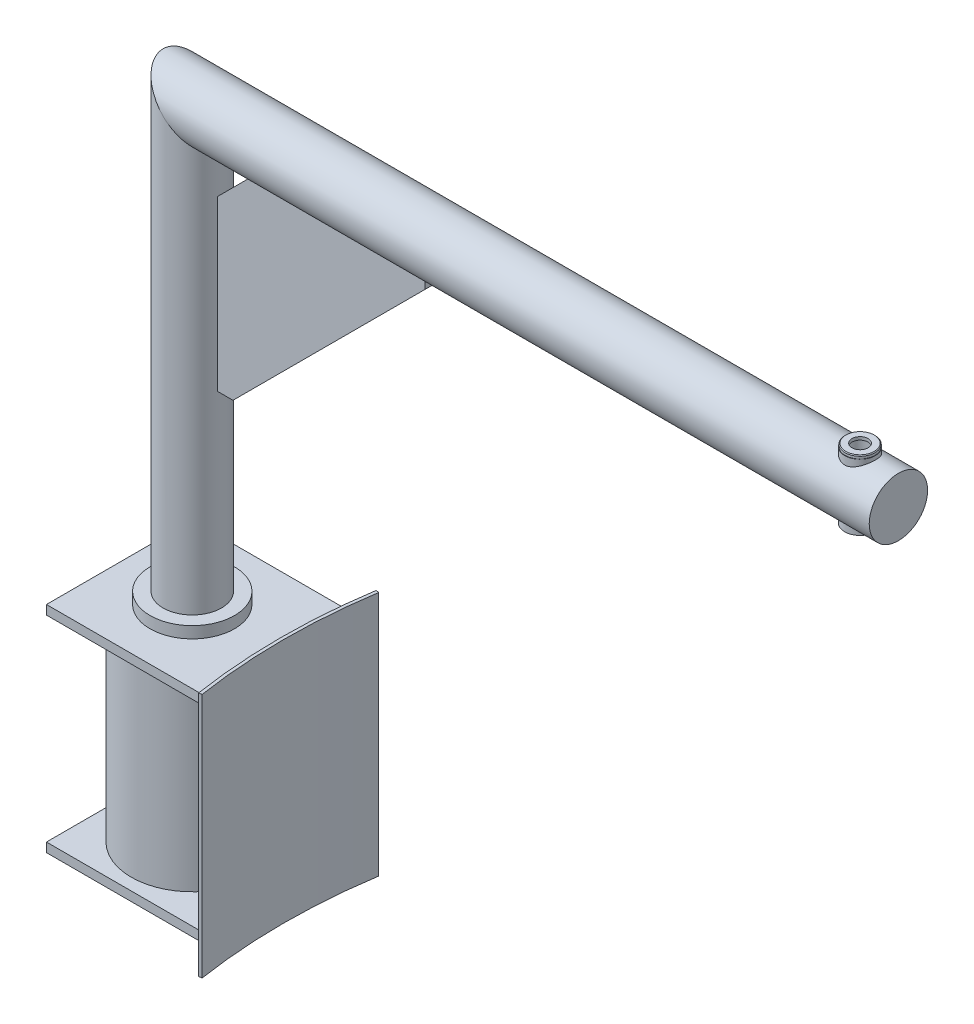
ISO-10303-21;
HEADER;
FILE_DESCRIPTION(('STEP AP214'),'2;1');
FILE_NAME('part.step','',(''),(''),'','','');
FILE_SCHEMA(('AUTOMOTIVE_DESIGN { 1 0 10303 214 1 1 1 1 }'));
ENDSEC;
DATA;
#1=APPLICATION_CONTEXT('core data for automotive mechanical design processes');
#2=APPLICATION_PROTOCOL_DEFINITION('international standard','automotive_design',2000,#1);
#3=PRODUCT_CONTEXT('',#1,'mechanical');
#4=PRODUCT('Part','Part','',(#3));
#5=PRODUCT_RELATED_PRODUCT_CATEGORY('part','',(#4));
#6=PRODUCT_DEFINITION_FORMATION('','',#4);
#7=PRODUCT_DEFINITION_CONTEXT('part definition',#1,'design');
#8=PRODUCT_DEFINITION('design','',#6,#7);
#9=PRODUCT_DEFINITION_SHAPE('','',#8);
#10=(LENGTH_UNIT() NAMED_UNIT(*) SI_UNIT(.MILLI.,.METRE.));
#11=(NAMED_UNIT(*) PLANE_ANGLE_UNIT() SI_UNIT($,.RADIAN.));
#12=(NAMED_UNIT(*) SI_UNIT($,.STERADIAN.) SOLID_ANGLE_UNIT());
#13=UNCERTAINTY_MEASURE_WITH_UNIT(LENGTH_MEASURE(1.E-05),#10,'distance_accuracy_value','');
#14=(GEOMETRIC_REPRESENTATION_CONTEXT(3) GLOBAL_UNCERTAINTY_ASSIGNED_CONTEXT((#13)) GLOBAL_UNIT_ASSIGNED_CONTEXT((#10,
#11,#12)) REPRESENTATION_CONTEXT('',''));
#15=CARTESIAN_POINT('',(0.,0.,0.));
#16=DIRECTION('',(0.,0.,1.));
#17=DIRECTION('',(1.,0.,0.));
#18=AXIS2_PLACEMENT_3D('',#15,#16,#17);
#19=CARTESIAN_POINT('',(-1.11022302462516E-13,340.,0.));
#20=DIRECTION('',(0.,-1.,0.));
#21=DIRECTION('',(0.430386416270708,0.,-0.902644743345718));
#22=AXIS2_PLACEMENT_3D('',#19,#20,#21);
#23=CYLINDRICAL_SURFACE('',#22,55.);
#24=CARTESIAN_POINT('',(-1.11022302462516E-13,325.,0.));
#25=DIRECTION('',(0.,1.,0.));
#26=DIRECTION('',(0.,0.,1.));
#27=AXIS2_PLACEMENT_3D('',#24,#25,#26);
#28=CIRCLE('',#27,55.);
#29=CARTESIAN_POINT('',(-1.11022302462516E-13,325.,55.));
#30=VERTEX_POINT('',#29);
#31=EDGE_CURVE('E471',#30,#30,#28,.F.);
#32=ORIENTED_EDGE('',*,*,#31,.F.);
#33=EDGE_LOOP('',(#32));
#34=FACE_BOUND('',#33,.T.);
#35=CARTESIAN_POINT('',(-1.11022302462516E-13,340.,0.));
#36=DIRECTION('',(0.,1.,0.));
#37=DIRECTION('',(-0.430386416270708,0.,0.902644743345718));
#38=AXIS2_PLACEMENT_3D('',#35,#36,#37);
#39=CIRCLE('',#38,55.);
#40=CARTESIAN_POINT('',(-23.671252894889,340.,49.6454608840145));
#41=VERTEX_POINT('',#40);
#42=EDGE_CURVE('E474',#41,#41,#39,.T.);
#43=ORIENTED_EDGE('',*,*,#42,.F.);
#44=EDGE_LOOP('',(#43));
#45=FACE_BOUND('',#44,.T.);
#46=ADVANCED_FACE('F35',(#34,#45),#23,.T.);
#47=CARTESIAN_POINT('',(-1.11022302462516E-13,340.,0.));
#48=DIRECTION('',(0.,1.,0.));
#49=DIRECTION('',(-0.430386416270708,0.,0.902644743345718));
#50=AXIS2_PLACEMENT_3D('',#47,#48,#49);
#51=PLANE('',#50);
#52=ORIENTED_EDGE('',*,*,#42,.T.);
#53=EDGE_LOOP('',(#52));
#54=FACE_BOUND('',#53,.T.);
#55=CARTESIAN_POINT('',(0.,340.,0.));
#56=DIRECTION('',(0.,1.,0.));
#57=DIRECTION('',(0.,0.,1.));
#58=AXIS2_PLACEMENT_3D('',#55,#56,#57);
#59=CIRCLE('',#58,38.05);
#60=CARTESIAN_POINT('',(0.,340.,38.05));
#61=VERTEX_POINT('',#60);
#62=EDGE_CURVE('E476',#61,#61,#59,.T.);
#63=ORIENTED_EDGE('',*,*,#62,.F.);
#64=EDGE_LOOP('',(#63));
#65=FACE_BOUND('',#64,.T.);
#66=ADVANCED_FACE('F439',(#54,#65),#51,.T.);
#67=CARTESIAN_POINT('',(-95.0000000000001,325.,95.));
#68=DIRECTION('',(-1.,0.,0.));
#69=DIRECTION('',(0.,0.,1.));
#70=AXIS2_PLACEMENT_3D('',#67,#68,#69);
#71=PLANE('',#70);
#72=DIRECTION('',(0.,0.,1.));
#73=VECTOR('',#72,1.);
#74=CARTESIAN_POINT('',(-95.0000000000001,313.,95.));
#75=LINE('',#74,#73);
#76=CARTESIAN_POINT('',(-95.0000000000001,313.,-95.));
#77=VERTEX_POINT('',#76);
#78=CARTESIAN_POINT('',(-95.0000000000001,313.,95.));
#79=VERTEX_POINT('',#78);
#80=EDGE_CURVE('E1090',#77,#79,#75,.T.);
#81=ORIENTED_EDGE('',*,*,#80,.T.);
#82=DIRECTION('',(0.,-1.,0.));
#83=VECTOR('',#82,1.);
#84=CARTESIAN_POINT('',(-95.0000000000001,325.,95.));
#85=LINE('',#84,#83);
#86=CARTESIAN_POINT('',(-95.0000000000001,325.,95.));
#87=VERTEX_POINT('',#86);
#88=EDGE_CURVE('E1101',#87,#79,#85,.T.);
#89=ORIENTED_EDGE('',*,*,#88,.F.);
#90=DIRECTION('',(0.,0.,1.));
#91=VECTOR('',#90,1.);
#92=CARTESIAN_POINT('',(-95.0000000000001,325.,95.));
#93=LINE('',#92,#91);
#94=CARTESIAN_POINT('',(-95.0000000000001,325.,-95.));
#95=VERTEX_POINT('',#94);
#96=EDGE_CURVE('E1086',#95,#87,#93,.T.);
#97=ORIENTED_EDGE('',*,*,#96,.F.);
#98=DIRECTION('',(0.,-1.,0.));
#99=VECTOR('',#98,1.);
#100=CARTESIAN_POINT('',(-95.0000000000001,325.,-95.));
#101=LINE('',#100,#99);
#102=EDGE_CURVE('E1087',#95,#77,#101,.T.);
#103=ORIENTED_EDGE('',*,*,#102,.T.);
#104=EDGE_LOOP('',(#81,#89,#97,#103));
#105=FACE_BOUND('',#104,.T.);
#106=ADVANCED_FACE('F442',(#105),#71,.T.);
#107=CARTESIAN_POINT('',(-95.0000000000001,325.,-95.));
#108=DIRECTION('',(0.,0.,-1.));
#109=DIRECTION('',(-1.,0.,0.));
#110=AXIS2_PLACEMENT_3D('',#107,#108,#109);
#111=PLANE('',#110);
#112=DIRECTION('',(-1.,0.,0.));
#113=VECTOR('',#112,1.);
#114=CARTESIAN_POINT('',(-95.0000000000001,313.,-95.));
#115=LINE('',#114,#113);
#116=CARTESIAN_POINT('',(121.,313.,-95.));
#117=VERTEX_POINT('',#116);
#118=EDGE_CURVE('E1091',#117,#77,#115,.T.);
#119=ORIENTED_EDGE('',*,*,#118,.T.);
#120=ORIENTED_EDGE('',*,*,#102,.F.);
#121=DIRECTION('',(-1.,0.,0.));
#122=VECTOR('',#121,1.);
#123=CARTESIAN_POINT('',(-95.0000000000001,325.,-95.));
#124=LINE('',#123,#122);
#125=CARTESIAN_POINT('',(121.,325.,-95.));
#126=VERTEX_POINT('',#125);
#127=EDGE_CURVE('E1096',#126,#95,#124,.T.);
#128=ORIENTED_EDGE('',*,*,#127,.F.);
#129=DIRECTION('',(0.,-1.,0.));
#130=VECTOR('',#129,1.);
#131=CARTESIAN_POINT('',(121.,325.,-95.));
#132=LINE('',#131,#130);
#133=EDGE_CURVE('E1106',#126,#117,#132,.T.);
#134=ORIENTED_EDGE('',*,*,#133,.T.);
#135=EDGE_LOOP('',(#119,#120,#128,#134));
#136=FACE_BOUND('',#135,.T.);
#137=ADVANCED_FACE('F987',(#136),#111,.T.);
#138=CARTESIAN_POINT('',(-95.0000000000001,325.,95.));
#139=DIRECTION('',(0.,0.,1.));
#140=DIRECTION('',(1.,0.,0.));
#141=AXIS2_PLACEMENT_3D('',#138,#139,#140);
#142=PLANE('',#141);
#143=DIRECTION('',(1.,0.,0.));
#144=VECTOR('',#143,1.);
#145=CARTESIAN_POINT('',(-95.0000000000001,313.,95.));
#146=LINE('',#145,#144);
#147=CARTESIAN_POINT('',(121.,313.,95.));
#148=VERTEX_POINT('',#147);
#149=EDGE_CURVE('E1105',#79,#148,#146,.T.);
#150=ORIENTED_EDGE('',*,*,#149,.T.);
#151=DIRECTION('',(0.,-1.,0.));
#152=VECTOR('',#151,1.);
#153=CARTESIAN_POINT('',(121.,325.,94.9999999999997));
#154=LINE('',#153,#152);
#155=CARTESIAN_POINT('',(121.,325.,95.));
#156=VERTEX_POINT('',#155);
#157=EDGE_CURVE('E1102',#156,#148,#154,.T.);
#158=ORIENTED_EDGE('',*,*,#157,.F.);
#159=DIRECTION('',(1.,0.,0.));
#160=VECTOR('',#159,1.);
#161=CARTESIAN_POINT('',(-95.0000000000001,325.,95.));
#162=LINE('',#161,#160);
#163=EDGE_CURVE('E1095',#87,#156,#162,.T.);
#164=ORIENTED_EDGE('',*,*,#163,.F.);
#165=ORIENTED_EDGE('',*,*,#88,.T.);
#166=EDGE_LOOP('',(#150,#158,#164,#165));
#167=FACE_BOUND('',#166,.T.);
#168=ADVANCED_FACE('F426',(#167),#142,.T.);
#169=CARTESIAN_POINT('',(868.99131010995,313.,0.));
#170=DIRECTION('',(0.,-1.,0.));
#171=DIRECTION('',(0.,0.,-1.));
#172=AXIS2_PLACEMENT_3D('',#169,#170,#171);
#173=PLANE('',#172);
#174=CARTESIAN_POINT('',(0.,313.,0.));
#175=DIRECTION('',(0.,-1.,0.));
#176=DIRECTION('',(0.,0.,-1.));
#177=AXIS2_PLACEMENT_3D('',#174,#175,#176);
#178=CIRCLE('',#177,79.5000000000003);
#179=CARTESIAN_POINT('',(76.998818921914,313.,-19.784637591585));
#180=VERTEX_POINT('',#179);
#181=EDGE_CURVE('E475',#180,#180,#178,.T.);
#182=ORIENTED_EDGE('',*,*,#181,.F.);
#183=EDGE_LOOP('',(#182));
#184=FACE_BOUND('',#183,.T.);
#185=ORIENTED_EDGE('',*,*,#149,.F.);
#186=ORIENTED_EDGE('',*,*,#80,.F.);
#187=ORIENTED_EDGE('',*,*,#118,.F.);
#188=CARTESIAN_POINT('',(868.99131010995,313.,0.));
#189=DIRECTION('',(0.,-1.,0.));
#190=DIRECTION('',(0.,0.,1.));
#191=AXIS2_PLACEMENT_3D('',#188,#189,#190);
#192=CIRCLE('',#191,754.);
#193=EDGE_CURVE('E1104',#148,#117,#192,.T.);
#194=ORIENTED_EDGE('',*,*,#193,.F.);
#195=EDGE_LOOP('',(#185,#186,#187,#194));
#196=FACE_BOUND('',#195,.T.);
#197=ADVANCED_FACE('F413',(#184,#196),#173,.T.);
#198=CARTESIAN_POINT('',(868.99131010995,325.,0.));
#199=DIRECTION('',(0.,1.,0.));
#200=DIRECTION('',(0.,0.,1.));
#201=AXIS2_PLACEMENT_3D('',#198,#199,#200);
#202=PLANE('',#201);
#203=ORIENTED_EDGE('',*,*,#31,.T.);
#204=EDGE_LOOP('',(#203));
#205=FACE_BOUND('',#204,.T.);
#206=ORIENTED_EDGE('',*,*,#163,.T.);
#207=CARTESIAN_POINT('',(868.99131010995,325.,0.));
#208=DIRECTION('',(0.,-1.,0.));
#209=DIRECTION('',(0.,0.,1.));
#210=AXIS2_PLACEMENT_3D('',#207,#208,#209);
#211=CIRCLE('',#210,754.);
#212=EDGE_CURVE('E1092',#156,#126,#211,.T.);
#213=ORIENTED_EDGE('',*,*,#212,.T.);
#214=ORIENTED_EDGE('',*,*,#127,.T.);
#215=ORIENTED_EDGE('',*,*,#96,.T.);
#216=EDGE_LOOP('',(#206,#213,#214,#215));
#217=FACE_BOUND('',#216,.T.);
#218=ADVANCED_FACE('F263',(#205,#217),#202,.T.);
#219=CARTESIAN_POINT('',(0.,313.,0.));
#220=DIRECTION('',(0.,-1.,0.));
#221=DIRECTION('',(0.968538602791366,0.,-0.248863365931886));
#222=AXIS2_PLACEMENT_3D('',#219,#220,#221);
#223=CYLINDRICAL_SURFACE('',#222,79.5000000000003);
#224=CARTESIAN_POINT('',(0.,56.9999999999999,0.));
#225=DIRECTION('',(0.,1.,0.));
#226=DIRECTION('',(0.,0.,1.));
#227=AXIS2_PLACEMENT_3D('',#224,#225,#226);
#228=CIRCLE('',#227,79.5000000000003);
#229=CARTESIAN_POINT('',(76.998818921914,56.9999999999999,-19.784637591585));
#230=VERTEX_POINT('',#229);
#231=EDGE_CURVE('E327',#230,#230,#228,.T.);
#232=CARTESIAN_POINT('',(76.998818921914,56.9999999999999,-19.784637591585));
#233=CARTESIAN_POINT('',(76.998818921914,59.6666666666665,-19.784637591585));
#234=CARTESIAN_POINT('',(76.998818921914,62.3333333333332,-19.784637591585));
#235=CARTESIAN_POINT('',(76.998818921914,67.6666666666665,-19.784637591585));
#236=CARTESIAN_POINT('',(76.998818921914,70.3333333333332,-19.784637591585));
#237=CARTESIAN_POINT('',(76.998818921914,75.6666666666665,-19.784637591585));
#238=CARTESIAN_POINT('',(76.998818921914,78.3333333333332,-19.784637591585));
#239=CARTESIAN_POINT('',(76.998818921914,83.6666666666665,-19.784637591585));
#240=CARTESIAN_POINT('',(76.998818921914,86.3333333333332,-19.784637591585));
#241=CARTESIAN_POINT('',(76.998818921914,91.6666666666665,-19.784637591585));
#242=CARTESIAN_POINT('',(76.998818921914,94.3333333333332,-19.784637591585));
#243=CARTESIAN_POINT('',(76.998818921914,99.6666666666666,-19.784637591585));
#244=CARTESIAN_POINT('',(76.998818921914,102.333333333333,-19.784637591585));
#245=CARTESIAN_POINT('',(76.998818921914,107.666666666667,-19.784637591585));
#246=CARTESIAN_POINT('',(76.998818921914,110.333333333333,-19.784637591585));
#247=CARTESIAN_POINT('',(76.998818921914,115.666666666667,-19.784637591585));
#248=CARTESIAN_POINT('',(76.998818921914,118.333333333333,-19.784637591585));
#249=CARTESIAN_POINT('',(76.998818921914,123.666666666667,-19.784637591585));
#250=CARTESIAN_POINT('',(76.998818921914,126.333333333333,-19.784637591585));
#251=CARTESIAN_POINT('',(76.998818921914,131.666666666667,-19.784637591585));
#252=CARTESIAN_POINT('',(76.998818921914,134.333333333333,-19.784637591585));
#253=CARTESIAN_POINT('',(76.998818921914,139.666666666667,-19.784637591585));
#254=CARTESIAN_POINT('',(76.998818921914,142.333333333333,-19.784637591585));
#255=CARTESIAN_POINT('',(76.998818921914,147.666666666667,-19.784637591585));
#256=CARTESIAN_POINT('',(76.998818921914,150.333333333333,-19.784637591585));
#257=CARTESIAN_POINT('',(76.998818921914,155.666666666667,-19.784637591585));
#258=CARTESIAN_POINT('',(76.998818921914,158.333333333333,-19.784637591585));
#259=CARTESIAN_POINT('',(76.998818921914,163.666666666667,-19.784637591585));
#260=CARTESIAN_POINT('',(76.998818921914,166.333333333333,-19.784637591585));
#261=CARTESIAN_POINT('',(76.998818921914,171.666666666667,-19.784637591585));
#262=CARTESIAN_POINT('',(76.998818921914,174.333333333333,-19.784637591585));
#263=CARTESIAN_POINT('',(76.998818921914,179.666666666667,-19.784637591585));
#264=CARTESIAN_POINT('',(76.998818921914,182.333333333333,-19.784637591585));
#265=CARTESIAN_POINT('',(76.998818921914,187.666666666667,-19.784637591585));
#266=CARTESIAN_POINT('',(76.998818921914,190.333333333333,-19.784637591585));
#267=CARTESIAN_POINT('',(76.998818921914,195.666666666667,-19.784637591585));
#268=CARTESIAN_POINT('',(76.998818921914,198.333333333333,-19.784637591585));
#269=CARTESIAN_POINT('',(76.998818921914,203.666666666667,-19.784637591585));
#270=CARTESIAN_POINT('',(76.998818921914,206.333333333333,-19.784637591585));
#271=CARTESIAN_POINT('',(76.998818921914,211.666666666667,-19.784637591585));
#272=CARTESIAN_POINT('',(76.998818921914,214.333333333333,-19.784637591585));
#273=CARTESIAN_POINT('',(76.998818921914,219.666666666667,-19.784637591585));
#274=CARTESIAN_POINT('',(76.998818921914,222.333333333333,-19.784637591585));
#275=CARTESIAN_POINT('',(76.998818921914,227.666666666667,-19.784637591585));
#276=CARTESIAN_POINT('',(76.998818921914,230.333333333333,-19.784637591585));
#277=CARTESIAN_POINT('',(76.998818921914,235.666666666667,-19.784637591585));
#278=CARTESIAN_POINT('',(76.998818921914,238.333333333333,-19.784637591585));
#279=CARTESIAN_POINT('',(76.998818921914,243.666666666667,-19.784637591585));
#280=CARTESIAN_POINT('',(76.998818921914,246.333333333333,-19.784637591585));
#281=CARTESIAN_POINT('',(76.998818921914,251.666666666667,-19.784637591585));
#282=CARTESIAN_POINT('',(76.998818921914,254.333333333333,-19.784637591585));
#283=CARTESIAN_POINT('',(76.998818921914,259.666666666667,-19.784637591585));
#284=CARTESIAN_POINT('',(76.998818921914,262.333333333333,-19.784637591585));
#285=CARTESIAN_POINT('',(76.998818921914,267.666666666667,-19.784637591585));
#286=CARTESIAN_POINT('',(76.998818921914,270.333333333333,-19.784637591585));
#287=CARTESIAN_POINT('',(76.998818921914,275.666666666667,-19.784637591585));
#288=CARTESIAN_POINT('',(76.998818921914,278.333333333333,-19.784637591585));
#289=CARTESIAN_POINT('',(76.998818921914,283.666666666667,-19.784637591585));
#290=CARTESIAN_POINT('',(76.998818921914,286.333333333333,-19.784637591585));
#291=CARTESIAN_POINT('',(76.998818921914,291.666666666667,-19.784637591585));
#292=CARTESIAN_POINT('',(76.998818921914,294.333333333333,-19.784637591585));
#293=CARTESIAN_POINT('',(76.998818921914,299.666666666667,-19.784637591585));
#294=CARTESIAN_POINT('',(76.998818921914,302.333333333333,-19.784637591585));
#295=CARTESIAN_POINT('',(76.998818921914,307.666666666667,-19.784637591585));
#296=CARTESIAN_POINT('',(76.998818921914,310.333333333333,-19.784637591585));
#297=CARTESIAN_POINT('',(76.998818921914,313.,-19.784637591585));
#298=B_SPLINE_CURVE_WITH_KNOTS('',3,(#232,#233,#234,#235,#236,#237,#238,#239,#240,#241,#242,
#243,#244,#245,#246,#247,#248,#249,#250,#251,#252,#253,#254,#255,#256,#257,#258,#259,#260,#261,
#262,#263,#264,#265,#266,#267,#268,#269,#270,#271,#272,#273,#274,#275,#276,#277,#278,#279,#280,
#281,#282,#283,#284,#285,#286,#287,#288,#289,#290,#291,#292,#293,#294,#295,#296,#297),
.UNSPECIFIED.,.F.,.F.,(4,2,2,2,2,2,2,2,2,2,2,2,2,2,2,2,2,2,2,2,2,2,2,2,2,2,2,2,2,2,2,2,4),(0.,
7.99999999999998,16.,24.,32.,40.,48.,56.,64.,72.,80.,88.0000000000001,96.,104.,112.,120.,128.,
136.,144.,152.,160.,168.,176.,184.,192.,200.,208.,216.,224.,232.,240.,248.,256.),.UNSPECIFIED.);
#299=EDGE_CURVE('BSEAM259',#230,#180,#298,.T.);
#300=ORIENTED_EDGE('',*,*,#231,.T.);
#301=ORIENTED_EDGE('',*,*,#181,.T.);
#302=ORIENTED_EDGE('',*,*,#299,.T.);
#303=ORIENTED_EDGE('',*,*,#299,.F.);
#304=EDGE_LOOP('',(#300,#302,#301,#303));
#305=FACE_BOUND('',#304,.T.);
#306=ADVANCED_FACE('F259',(#305),#223,.T.);
#307=CARTESIAN_POINT('',(-95.0000000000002,57.,95.));
#308=DIRECTION('',(0.,0.,1.));
#309=DIRECTION('',(1.,0.,0.));
#310=AXIS2_PLACEMENT_3D('',#307,#308,#309);
#311=PLANE('',#310);
#312=DIRECTION('',(1.,0.,0.));
#313=VECTOR('',#312,1.);
#314=CARTESIAN_POINT('',(-95.0000000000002,45.,95.));
#315=LINE('',#314,#313);
#316=CARTESIAN_POINT('',(-95.0000000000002,45.,95.));
#317=VERTEX_POINT('',#316);
#318=CARTESIAN_POINT('',(121.,45.,94.9999999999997));
#319=VERTEX_POINT('',#318);
#320=EDGE_CURVE('E335',#317,#319,#315,.T.);
#321=ORIENTED_EDGE('',*,*,#320,.T.);
#322=DIRECTION('',(0.,-1.,0.));
#323=VECTOR('',#322,1.);
#324=CARTESIAN_POINT('',(121.,57.,94.9999999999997));
#325=LINE('',#324,#323);
#326=CARTESIAN_POINT('',(121.,57.,94.9999999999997));
#327=VERTEX_POINT('',#326);
#328=EDGE_CURVE('E338',#327,#319,#325,.T.);
#329=ORIENTED_EDGE('',*,*,#328,.F.);
#330=DIRECTION('',(1.,0.,0.));
#331=VECTOR('',#330,1.);
#332=CARTESIAN_POINT('',(-95.0000000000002,57.,95.));
#333=LINE('',#332,#331);
#334=CARTESIAN_POINT('',(-95.0000000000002,57.,95.));
#335=VERTEX_POINT('',#334);
#336=EDGE_CURVE('E341',#335,#327,#333,.T.);
#337=ORIENTED_EDGE('',*,*,#336,.F.);
#338=DIRECTION('',(0.,-1.,0.));
#339=VECTOR('',#338,1.);
#340=CARTESIAN_POINT('',(-95.0000000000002,57.,95.));
#341=LINE('',#340,#339);
#342=EDGE_CURVE('E339',#335,#317,#341,.T.);
#343=ORIENTED_EDGE('',*,*,#342,.T.);
#344=EDGE_LOOP('',(#321,#329,#337,#343));
#345=FACE_BOUND('',#344,.T.);
#346=ADVANCED_FACE('F262',(#345),#311,.T.);
#347=CARTESIAN_POINT('',(-95.0000000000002,57.,-95.));
#348=DIRECTION('',(0.,0.,-1.));
#349=DIRECTION('',(-1.,0.,0.));
#350=AXIS2_PLACEMENT_3D('',#347,#348,#349);
#351=PLANE('',#350);
#352=DIRECTION('',(-1.,0.,0.));
#353=VECTOR('',#352,1.);
#354=CARTESIAN_POINT('',(-95.0000000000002,45.,-95.));
#355=LINE('',#354,#353);
#356=CARTESIAN_POINT('',(121.,44.9999999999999,-95.));
#357=VERTEX_POINT('',#356);
#358=CARTESIAN_POINT('',(-95.0000000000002,45.,-95.));
#359=VERTEX_POINT('',#358);
#360=EDGE_CURVE('E350',#357,#359,#355,.T.);
#361=ORIENTED_EDGE('',*,*,#360,.T.);
#362=DIRECTION('',(0.,-1.,0.));
#363=VECTOR('',#362,1.);
#364=CARTESIAN_POINT('',(-95.0000000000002,57.,-95.));
#365=LINE('',#364,#363);
#366=CARTESIAN_POINT('',(-95.0000000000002,57.,-95.));
#367=VERTEX_POINT('',#366);
#368=EDGE_CURVE('E334',#367,#359,#365,.T.);
#369=ORIENTED_EDGE('',*,*,#368,.F.);
#370=DIRECTION('',(-1.,0.,0.));
#371=VECTOR('',#370,1.);
#372=CARTESIAN_POINT('',(-95.0000000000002,57.,-95.));
#373=LINE('',#372,#371);
#374=CARTESIAN_POINT('',(121.,57.,-95.));
#375=VERTEX_POINT('',#374);
#376=EDGE_CURVE('E344',#375,#367,#373,.T.);
#377=ORIENTED_EDGE('',*,*,#376,.F.);
#378=DIRECTION('',(0.,-1.,0.));
#379=VECTOR('',#378,1.);
#380=CARTESIAN_POINT('',(121.,57.,-95.));
#381=LINE('',#380,#379);
#382=EDGE_CURVE('E349',#375,#357,#381,.T.);
#383=ORIENTED_EDGE('',*,*,#382,.T.);
#384=EDGE_LOOP('',(#361,#369,#377,#383));
#385=FACE_BOUND('',#384,.T.);
#386=ADVANCED_FACE('F275',(#385),#351,.T.);
#387=CARTESIAN_POINT('',(-95.0000000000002,57.,95.));
#388=DIRECTION('',(-1.,0.,0.));
#389=DIRECTION('',(0.,0.,1.));
#390=AXIS2_PLACEMENT_3D('',#387,#388,#389);
#391=PLANE('',#390);
#392=DIRECTION('',(0.,0.,1.));
#393=VECTOR('',#392,1.);
#394=CARTESIAN_POINT('',(-95.0000000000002,45.,95.));
#395=LINE('',#394,#393);
#396=EDGE_CURVE('E330',#359,#317,#395,.T.);
#397=ORIENTED_EDGE('',*,*,#396,.T.);
#398=ORIENTED_EDGE('',*,*,#342,.F.);
#399=DIRECTION('',(0.,0.,1.));
#400=VECTOR('',#399,1.);
#401=CARTESIAN_POINT('',(-95.0000000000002,57.,95.));
#402=LINE('',#401,#400);
#403=EDGE_CURVE('E342',#367,#335,#402,.T.);
#404=ORIENTED_EDGE('',*,*,#403,.F.);
#405=ORIENTED_EDGE('',*,*,#368,.T.);
#406=EDGE_LOOP('',(#397,#398,#404,#405));
#407=FACE_BOUND('',#406,.T.);
#408=ADVANCED_FACE('F271',(#407),#391,.T.);
#409=CARTESIAN_POINT('',(868.99131010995,57.,0.));
#410=DIRECTION('',(0.,1.,0.));
#411=DIRECTION('',(0.,0.,1.));
#412=AXIS2_PLACEMENT_3D('',#409,#410,#411);
#413=PLANE('',#412);
#414=ORIENTED_EDGE('',*,*,#231,.F.);
#415=EDGE_LOOP('',(#414));
#416=FACE_BOUND('',#415,.T.);
#417=ORIENTED_EDGE('',*,*,#336,.T.);
#418=CARTESIAN_POINT('',(868.99131010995,57.,0.));
#419=DIRECTION('',(0.,-1.,0.));
#420=DIRECTION('',(0.,0.,1.));
#421=AXIS2_PLACEMENT_3D('',#418,#419,#420);
#422=CIRCLE('',#421,754.);
#423=EDGE_CURVE('E353',#327,#375,#422,.T.);
#424=ORIENTED_EDGE('',*,*,#423,.T.);
#425=ORIENTED_EDGE('',*,*,#376,.T.);
#426=ORIENTED_EDGE('',*,*,#403,.T.);
#427=EDGE_LOOP('',(#417,#424,#425,#426));
#428=FACE_BOUND('',#427,.T.);
#429=ADVANCED_FACE('F274',(#416,#428),#413,.T.);
#430=CARTESIAN_POINT('',(0.,45.,0.));
#431=DIRECTION('',(0.,-1.,0.));
#432=DIRECTION('',(0.,0.,-1.));
#433=AXIS2_PLACEMENT_3D('',#430,#431,#432);
#434=PLANE('',#433);
#435=CARTESIAN_POINT('',(0.,44.9999999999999,0.));
#436=DIRECTION('',(0.,-1.,0.));
#437=DIRECTION('',(0.,0.,-1.));
#438=AXIS2_PLACEMENT_3D('',#435,#436,#437);
#439=CIRCLE('',#438,38.05);
#440=CARTESIAN_POINT('',(0.,44.9999999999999,-38.05));
#441=VERTEX_POINT('',#440);
#442=EDGE_CURVE('E324',#441,#441,#439,.F.);
#443=ORIENTED_EDGE('',*,*,#442,.T.);
#444=EDGE_LOOP('',(#443));
#445=FACE_BOUND('',#444,.T.);
#446=ORIENTED_EDGE('',*,*,#320,.F.);
#447=ORIENTED_EDGE('',*,*,#396,.F.);
#448=ORIENTED_EDGE('',*,*,#360,.F.);
#449=CARTESIAN_POINT('',(868.99131010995,45.,0.));
#450=DIRECTION('',(0.,-1.,0.));
#451=DIRECTION('',(0.,0.,1.));
#452=AXIS2_PLACEMENT_3D('',#449,#450,#451);
#453=CIRCLE('',#452,754.);
#454=EDGE_CURVE('E346',#319,#357,#453,.T.);
#455=ORIENTED_EDGE('',*,*,#454,.F.);
#456=EDGE_LOOP('',(#446,#447,#448,#455));
#457=FACE_BOUND('',#456,.T.);
#458=ADVANCED_FACE('F283',(#445,#457),#434,.T.);
#459=CARTESIAN_POINT('',(0.,894.95,0.));
#460=DIRECTION('',(0.,-1.,0.));
#461=DIRECTION('',(0.,0.,-1.));
#462=AXIS2_PLACEMENT_3D('',#459,#460,#461);
#463=CYLINDRICAL_SURFACE('',#462,34.45);
#464=CARTESIAN_POINT('',(0.,894.95,34.45));
#465=CARTESIAN_POINT('',(-68.9,963.85,34.45));
#466=CARTESIAN_POINT('',(-68.9,963.85,-34.45));
#467=CARTESIAN_POINT('',(0.,894.95,-34.45));
#468=(BOUNDED_CURVE() B_SPLINE_CURVE(3,(#464,#465,#466,#467),.UNSPECIFIED.,.F.,
.F.) B_SPLINE_CURVE_WITH_KNOTS((4,4),(4.71238898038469,7.85398163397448),
.UNSPECIFIED.) CURVE() GEOMETRIC_REPRESENTATION_ITEM() RATIONAL_B_SPLINE_CURVE((1.,
0.333333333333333,0.333333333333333,1.)) REPRESENTATION_ITEM(''));
#469=CARTESIAN_POINT('',(0.,894.95,34.45));
#470=VERTEX_POINT('',#469);
#471=CARTESIAN_POINT('',(0.,894.95,-34.45));
#472=VERTEX_POINT('',#471);
#473=EDGE_CURVE('E184',#470,#472,#468,.T.);
#474=ORIENTED_EDGE('',*,*,#473,.F.);
#475=CARTESIAN_POINT('',(0.,894.95,-34.45));
#476=CARTESIAN_POINT('',(68.9,826.05,-34.45));
#477=CARTESIAN_POINT('',(68.9,826.05,34.45));
#478=CARTESIAN_POINT('',(0.,894.95,34.45));
#479=(BOUNDED_CURVE() B_SPLINE_CURVE(3,(#475,#476,#477,#478),.UNSPECIFIED.,.F.,
.F.) B_SPLINE_CURVE_WITH_KNOTS((4,4),(1.5707963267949,4.71238898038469),
.UNSPECIFIED.) CURVE() GEOMETRIC_REPRESENTATION_ITEM() RATIONAL_B_SPLINE_CURVE((1.,
0.333333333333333,0.333333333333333,1.)) REPRESENTATION_ITEM(''));
#480=EDGE_CURVE('E190',#472,#470,#479,.T.);
#481=ORIENTED_EDGE('',*,*,#480,.F.);
#482=EDGE_LOOP('',(#474,#481));
#483=FACE_BOUND('',#482,.T.);
#484=CARTESIAN_POINT('',(-5.25000000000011,20.,-34.0476137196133));
#485=CARTESIAN_POINT('',(-5.25000167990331,19.8534336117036,-34.0476130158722));
#486=CARTESIAN_POINT('',(-5.24386003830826,19.7068917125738,-34.048562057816));
#487=CARTESIAN_POINT('',(-5.21934200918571,19.4148128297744,-34.0523292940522));
#488=CARTESIAN_POINT('',(-5.20096282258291,19.2692760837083,-34.0551479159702));
#489=CARTESIAN_POINT('',(-5.15208630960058,18.9801886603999,-34.0625764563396));
#490=CARTESIAN_POINT('',(-5.12157984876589,18.8366395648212,-34.067187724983));
#491=CARTESIAN_POINT('',(-5.04866889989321,18.5526056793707,-34.078069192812));
#492=CARTESIAN_POINT('',(-5.00626003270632,18.4121220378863,-34.0843400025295));
#493=CARTESIAN_POINT('',(-4.90991461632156,18.1354179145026,-34.0983519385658));
#494=CARTESIAN_POINT('',(-4.85599169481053,17.9991926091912,-34.1060913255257));
#495=CARTESIAN_POINT('',(-4.73698868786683,17.7317644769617,-34.1228228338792));
#496=CARTESIAN_POINT('',(-4.67190443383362,17.6005635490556,-34.1318154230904));
#497=CARTESIAN_POINT('',(-4.46065856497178,17.2160515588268,-34.1602881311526));
#498=CARTESIAN_POINT('',(-4.29838123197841,16.971480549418,-34.181281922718));
#499=CARTESIAN_POINT('',(-3.93413489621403,16.5111823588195,-34.2251189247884));
#500=CARTESIAN_POINT('',(-3.73188464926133,16.2956788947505,-34.2479745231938));
#501=CARTESIAN_POINT('',(-3.40375349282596,16.0001582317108,-34.2816148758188));
#502=CARTESIAN_POINT('',(-3.29016595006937,15.9062200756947,-34.2927283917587));
#503=CARTESIAN_POINT('',(-3.05548212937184,15.7282105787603,-34.314434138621));
#504=CARTESIAN_POINT('',(-2.93438868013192,15.6441355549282,-34.3250265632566));
#505=CARTESIAN_POINT('',(-2.68479830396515,15.4859862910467,-34.3454528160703));
#506=CARTESIAN_POINT('',(-2.55626260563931,15.4119727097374,-34.3552819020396));
#507=CARTESIAN_POINT('',(-2.29337510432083,15.2750785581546,-34.3738313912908));
#508=CARTESIAN_POINT('',(-2.15902547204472,15.212193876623,-34.382552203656));
#509=CARTESIAN_POINT('',(-1.88552524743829,15.0980378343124,-34.3986342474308));
#510=CARTESIAN_POINT('',(-1.74637862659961,15.0467571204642,-34.4059965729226));
#511=CARTESIAN_POINT('',(-1.46422590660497,14.9561423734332,-34.4191588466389));
#512=CARTESIAN_POINT('',(-1.32122075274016,14.9168054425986,-34.4249591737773));
#513=CARTESIAN_POINT('',(-0.984078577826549,14.8392680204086,-34.4364806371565));
#514=CARTESIAN_POINT('',(-0.788804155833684,14.8058276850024,-34.4415293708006));
#515=CARTESIAN_POINT('',(-0.395671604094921,14.7611949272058,-34.4482885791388));
#516=CARTESIAN_POINT('',(-0.197813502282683,14.750002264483,-34.4499990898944));
#517=CARTESIAN_POINT('',(0.146577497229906,14.7499983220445,-34.4500006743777));
#518=CARTESIAN_POINT('',(0.29313050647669,14.7561408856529,-34.4490626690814));
#519=CARTESIAN_POINT('',(0.585231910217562,14.7806626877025,-34.445338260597));
#520=CARTESIAN_POINT('',(0.730780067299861,14.7990447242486,-34.4425514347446));
#521=CARTESIAN_POINT('',(1.01989057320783,14.8479290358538,-34.4352036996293));
#522=CARTESIAN_POINT('',(1.1634513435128,14.8784404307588,-34.4306414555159));
#523=CARTESIAN_POINT('',(1.44750882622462,14.9513635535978,-34.4198697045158));
#524=CARTESIAN_POINT('',(1.58800439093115,14.9937796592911,-34.4136595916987));
#525=CARTESIAN_POINT('',(1.86473387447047,15.0901425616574,-34.3997736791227));
#526=CARTESIAN_POINT('',(2.00097256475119,15.1440758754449,-34.3920995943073));
#527=CARTESIAN_POINT('',(2.26842631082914,15.2631021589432,-34.375496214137));
#528=CARTESIAN_POINT('',(2.39963946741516,15.3281992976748,-34.3665664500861));
#529=CARTESIAN_POINT('',(2.78418474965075,15.539486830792,-34.3382674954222));
#530=CARTESIAN_POINT('',(3.02877389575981,15.7017961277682,-34.3173700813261));
#531=CARTESIAN_POINT('',(3.4890521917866,16.0660748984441,-34.2736493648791));
#532=CARTESIAN_POINT('',(3.70452323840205,16.2683184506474,-34.2508134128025));
#533=CARTESIAN_POINT('',(3.99999683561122,16.5964294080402,-34.2171360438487));
#534=CARTESIAN_POINT('',(4.09391964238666,16.7100086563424,-34.2059990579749));
#535=CARTESIAN_POINT('',(4.27189963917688,16.9446727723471,-34.1842273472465));
#536=CARTESIAN_POINT('',(4.35596050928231,17.0657548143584,-34.1735924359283));
#537=CARTESIAN_POINT('',(4.51409370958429,17.3153361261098,-34.1530651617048));
#538=CARTESIAN_POINT('',(4.58810401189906,17.4438750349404,-34.143177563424));
#539=CARTESIAN_POINT('',(4.72499126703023,17.7067686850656,-34.1245033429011));
#540=CARTESIAN_POINT('',(4.78787233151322,17.8411212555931,-34.1157163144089));
#541=CARTESIAN_POINT('',(4.90202090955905,18.1146273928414,-34.0995017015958));
#542=CARTESIAN_POINT('',(4.9532977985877,18.2537769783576,-34.0920730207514));
#543=CARTESIAN_POINT('',(5.04390476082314,18.5359362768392,-34.0787854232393));
#544=CARTESIAN_POINT('',(5.08323773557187,18.6789450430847,-34.0729261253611));
#545=CARTESIAN_POINT('',(5.16075780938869,19.0160630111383,-34.0612848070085));
#546=CARTESIAN_POINT('',(5.19418840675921,19.2113090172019,-34.0561801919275));
#547=CARTESIAN_POINT('',(5.23880824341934,19.6043849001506,-34.0493451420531));
#548=CARTESIAN_POINT('',(5.24999773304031,19.8022147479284,-34.0476146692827));
#549=CARTESIAN_POINT('',(5.25000167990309,20.1465663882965,-34.0476130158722));
#550=CARTESIAN_POINT('',(5.24386003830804,20.2931082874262,-34.0485620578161));
#551=CARTESIAN_POINT('',(5.21934200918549,20.5851871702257,-34.0523292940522));
#552=CARTESIAN_POINT('',(5.20096282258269,20.7307239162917,-34.0551479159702));
#553=CARTESIAN_POINT('',(5.15208630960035,21.0198113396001,-34.0625764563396));
#554=CARTESIAN_POINT('',(5.12157984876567,21.1633604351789,-34.0671877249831));
#555=CARTESIAN_POINT('',(5.04866889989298,21.4473943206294,-34.078069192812));
#556=CARTESIAN_POINT('',(5.00626003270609,21.5878779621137,-34.0843400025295));
#557=CARTESIAN_POINT('',(4.90991461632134,21.8645820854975,-34.0983519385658));
#558=CARTESIAN_POINT('',(4.85599169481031,22.0008073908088,-34.1060913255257));
#559=CARTESIAN_POINT('',(4.73698868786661,22.2682355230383,-34.1228228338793));
#560=CARTESIAN_POINT('',(4.6719044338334,22.3994364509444,-34.1318154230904));
#561=CARTESIAN_POINT('',(4.46065856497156,22.7839484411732,-34.1602881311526));
#562=CARTESIAN_POINT('',(4.29838123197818,23.0285194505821,-34.181281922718));
#563=CARTESIAN_POINT('',(3.9341348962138,23.4888176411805,-34.2251189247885));
#564=CARTESIAN_POINT('',(3.7318846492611,23.7043211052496,-34.2479745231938));
#565=CARTESIAN_POINT('',(3.40375349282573,23.9998417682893,-34.2816148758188));
#566=CARTESIAN_POINT('',(3.29016595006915,24.0937799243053,-34.2927283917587));
#567=CARTESIAN_POINT('',(3.05548212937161,24.2717894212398,-34.314434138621));
#568=CARTESIAN_POINT('',(2.9343886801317,24.3558644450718,-34.3250265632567));
#569=CARTESIAN_POINT('',(2.68479830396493,24.5140137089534,-34.3454528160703));
#570=CARTESIAN_POINT('',(2.55626260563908,24.5880272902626,-34.3552819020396));
#571=CARTESIAN_POINT('',(2.29337510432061,24.7249214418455,-34.3738313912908));
#572=CARTESIAN_POINT('',(2.15902547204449,24.787806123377,-34.3825522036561));
#573=CARTESIAN_POINT('',(1.88552524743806,24.9019621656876,-34.3986342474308));
#574=CARTESIAN_POINT('',(1.74637862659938,24.9532428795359,-34.4059965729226));
#575=CARTESIAN_POINT('',(1.46422590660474,25.0438576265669,-34.4191588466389));
#576=CARTESIAN_POINT('',(1.32122075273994,25.0831945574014,-34.4249591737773));
#577=CARTESIAN_POINT('',(0.984078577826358,25.1607319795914,-34.4364806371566));
#578=CARTESIAN_POINT('',(0.788804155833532,25.1941723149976,-34.4415293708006));
#579=CARTESIAN_POINT('',(0.395671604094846,25.2388050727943,-34.4482885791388));
#580=CARTESIAN_POINT('',(0.197813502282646,25.249997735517,-34.4499990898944));
#581=CARTESIAN_POINT('',(-0.146577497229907,25.2500016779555,-34.4500006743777));
#582=CARTESIAN_POINT('',(-0.293130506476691,25.2438591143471,-34.4490626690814));
#583=CARTESIAN_POINT('',(-0.585231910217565,25.2193373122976,-34.445338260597));
#584=CARTESIAN_POINT('',(-0.730780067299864,25.2009552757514,-34.4425514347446));
#585=CARTESIAN_POINT('',(-1.01989057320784,25.1520709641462,-34.4352036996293));
#586=CARTESIAN_POINT('',(-1.1634513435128,25.1215595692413,-34.4306414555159));
#587=CARTESIAN_POINT('',(-1.44750882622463,25.0486364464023,-34.4198697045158));
#588=CARTESIAN_POINT('',(-1.58800439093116,25.006220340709,-34.4136595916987));
#589=CARTESIAN_POINT('',(-1.86473387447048,24.9098574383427,-34.3997736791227));
#590=CARTESIAN_POINT('',(-2.00097256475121,24.8559241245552,-34.3920995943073));
#591=CARTESIAN_POINT('',(-2.26842631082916,24.736897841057,-34.375496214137));
#592=CARTESIAN_POINT('',(-2.39963946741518,24.6718007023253,-34.3665664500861));
#593=CARTESIAN_POINT('',(-2.78418474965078,24.4605131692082,-34.3382674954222));
#594=CARTESIAN_POINT('',(-3.02877389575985,24.298203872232,-34.3173700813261));
#595=CARTESIAN_POINT('',(-3.48905219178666,23.9339251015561,-34.2736493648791));
#596=CARTESIAN_POINT('',(-3.70452323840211,23.7316815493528,-34.2508134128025));
#597=CARTESIAN_POINT('',(-3.9999968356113,23.40357059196,-34.2171360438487));
#598=CARTESIAN_POINT('',(-4.09391964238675,23.2899913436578,-34.2059990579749));
#599=CARTESIAN_POINT('',(-4.27189963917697,23.0553272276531,-34.1842273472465));
#600=CARTESIAN_POINT('',(-4.3559605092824,22.9342451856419,-34.1735924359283));
#601=CARTESIAN_POINT('',(-4.5140937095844,22.6846638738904,-34.1530651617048));
#602=CARTESIAN_POINT('',(-4.58810401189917,22.5561249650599,-34.1431775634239));
#603=CARTESIAN_POINT('',(-4.72499126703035,22.2932313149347,-34.1245033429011));
#604=CARTESIAN_POINT('',(-4.78787233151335,22.1588787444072,-34.1157163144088));
#605=CARTESIAN_POINT('',(-4.90202090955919,21.8853726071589,-34.0995017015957));
#606=CARTESIAN_POINT('',(-4.95329779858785,21.7462230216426,-34.0920730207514));
#607=CARTESIAN_POINT('',(-5.0439047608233,21.4640637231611,-34.0787854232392));
#608=CARTESIAN_POINT('',(-5.08323773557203,21.3210549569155,-34.0729261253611));
#609=CARTESIAN_POINT('',(-5.16075780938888,20.983936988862,-34.0612848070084));
#610=CARTESIAN_POINT('',(-5.19418840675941,20.7886909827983,-34.0561801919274));
#611=CARTESIAN_POINT('',(-5.23880824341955,20.3956150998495,-34.0493451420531));
#612=CARTESIAN_POINT('',(-5.24999773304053,20.1977852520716,-34.0476146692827));
#613=CARTESIAN_POINT('',(-5.25000000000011,20.,-34.0476137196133));
#614=B_SPLINE_CURVE_WITH_KNOTS('',3,(#484,#485,#486,#487,#488,#489,#490,#491,#492,#493,#494,
#495,#496,#497,#498,#499,#500,#501,#502,#503,#504,#505,#506,#507,#508,#509,#510,#511,#512,#513,
#514,#515,#516,#517,#518,#519,#520,#521,#522,#523,#524,#525,#526,#527,#528,#529,#530,#531,#532,
#533,#534,#535,#536,#537,#538,#539,#540,#541,#542,#543,#544,#545,#546,#547,#548,#549,#550,#551,
#552,#553,#554,#555,#556,#557,#558,#559,#560,#561,#562,#563,#564,#565,#566,#567,#568,#569,#570,
#571,#572,#573,#574,#575,#576,#577,#578,#579,#580,#581,#582,#583,#584,#585,#586,#587,#588,#589,
#590,#591,#592,#593,#594,#595,#596,#597,#598,#599,#600,#601,#602,#603,#604,#605,#606,#607,#608,
#609,#610,#611,#612,#613),.UNSPECIFIED.,.T.,.F.,(4,2,2,2,2,2,2,2,2,2,2,2,2,2,2,2,2,2,2,2,2,2,2,
2,2,2,2,2,2,2,2,2,2,2,2,2,2,2,2,2,2,2,2,2,2,2,2,2,2,2,2,2,2,2,2,2,2,2,2,2,2,2,2,2,4),(0.,
0.439525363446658,0.87915129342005,1.3191089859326,1.7592287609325,2.19883048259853,
2.638596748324,3.517027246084,4.40187364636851,4.84489164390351,5.28774368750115,
5.73315724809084,6.17840591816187,6.62329441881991,7.06807489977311,7.6612873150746,
8.25449332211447,8.69405205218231,9.13371130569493,9.57370175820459,10.0138542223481,
10.4534942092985,10.8932987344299,11.7718043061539,12.6565631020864,13.0995382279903,
13.5423475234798,13.9877762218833,14.4330400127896,14.8779427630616,15.3227373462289,
15.9158652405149,16.5089864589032,16.9485118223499,17.3881377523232,17.8280954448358,
18.2682152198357,18.7078169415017,19.1475832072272,20.0260137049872,20.9108601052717,
21.3538781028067,21.7967301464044,22.242143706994,22.6873923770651,23.1322808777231,
23.5770613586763,24.1702737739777,24.7634797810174,25.2030385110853,25.6426977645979,
26.0826882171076,26.5228406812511,26.9624806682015,27.4022851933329,28.2807907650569,
29.1655495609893,29.6085246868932,30.0513339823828,30.4967626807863,30.9420264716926,
31.3869292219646,31.8317238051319,32.424851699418,33.0179729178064),.UNSPECIFIED.);
#615=CARTESIAN_POINT('',(-5.25000000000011,20.,-34.0476137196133));
#616=VERTEX_POINT('',#615);
#617=EDGE_CURVE('E333',#616,#616,#614,.T.);
#618=ORIENTED_EDGE('',*,*,#617,.F.);
#619=EDGE_LOOP('',(#618));
#620=FACE_BOUND('',#619,.T.);
#621=CARTESIAN_POINT('',(0.,14.75,34.45));
#622=CARTESIAN_POINT('',(-0.146577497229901,14.7499983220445,34.4500006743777));
#623=CARTESIAN_POINT('',(-0.293130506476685,14.7561408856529,34.4490626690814));
#624=CARTESIAN_POINT('',(-0.585231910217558,14.7806626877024,34.445338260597));
#625=CARTESIAN_POINT('',(-0.730780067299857,14.7990447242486,34.4425514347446));
#626=CARTESIAN_POINT('',(-1.01989057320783,14.8479290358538,34.4352036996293));
#627=CARTESIAN_POINT('',(-1.1634513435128,14.8784404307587,34.4306414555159));
#628=CARTESIAN_POINT('',(-1.44750882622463,14.9513635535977,34.4198697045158));
#629=CARTESIAN_POINT('',(-1.58800439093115,14.993779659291,34.4136595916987));
#630=CARTESIAN_POINT('',(-1.86473387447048,15.0901425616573,34.3997736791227));
#631=CARTESIAN_POINT('',(-2.0009725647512,15.1440758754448,34.3920995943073));
#632=CARTESIAN_POINT('',(-2.26842631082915,15.2631021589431,34.375496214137));
#633=CARTESIAN_POINT('',(-2.39963946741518,15.3281992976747,34.3665664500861));
#634=CARTESIAN_POINT('',(-2.78418474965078,15.5394868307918,34.3382674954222));
#635=CARTESIAN_POINT('',(-3.02877389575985,15.7017961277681,34.3173700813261));
#636=CARTESIAN_POINT('',(-3.48905219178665,16.066074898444,34.2736493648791));
#637=CARTESIAN_POINT('',(-3.70452323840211,16.2683184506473,34.2508134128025));
#638=CARTESIAN_POINT('',(-3.99999683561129,16.59642940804,34.2171360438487));
#639=CARTESIAN_POINT('',(-4.09391964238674,16.7100086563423,34.2059990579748));
#640=CARTESIAN_POINT('',(-4.27189963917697,16.944672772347,34.1842273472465));
#641=CARTESIAN_POINT('',(-4.3559605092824,17.0657548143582,34.1735924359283));
#642=CARTESIAN_POINT('',(-4.5140937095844,17.3153361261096,34.1530651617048));
#643=CARTESIAN_POINT('',(-4.58810401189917,17.4438750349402,34.1431775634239));
#644=CARTESIAN_POINT('',(-4.72499126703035,17.7067686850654,34.1245033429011));
#645=CARTESIAN_POINT('',(-4.78787233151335,17.8411212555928,34.1157163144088));
#646=CARTESIAN_POINT('',(-4.90202090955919,18.1146273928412,34.0995017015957));
#647=CARTESIAN_POINT('',(-4.95329779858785,18.2537769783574,34.0920730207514));
#648=CARTESIAN_POINT('',(-5.0439047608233,18.5359362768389,34.0787854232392));
#649=CARTESIAN_POINT('',(-5.08323773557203,18.6789450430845,34.0729261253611));
#650=CARTESIAN_POINT('',(-5.16075780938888,19.0160630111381,34.0612848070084));
#651=CARTESIAN_POINT('',(-5.19418840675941,19.2113090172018,34.0561801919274));
#652=CARTESIAN_POINT('',(-5.23880824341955,19.6043849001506,34.0493451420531));
#653=CARTESIAN_POINT('',(-5.24999773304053,19.8022147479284,34.0476146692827));
#654=CARTESIAN_POINT('',(-5.25000167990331,20.1465663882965,34.0476130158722));
#655=CARTESIAN_POINT('',(-5.24386003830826,20.2931082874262,34.048562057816));
#656=CARTESIAN_POINT('',(-5.21934200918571,20.5851871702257,34.0523292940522));
#657=CARTESIAN_POINT('',(-5.20096282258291,20.7307239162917,34.0551479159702));
#658=CARTESIAN_POINT('',(-5.15208630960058,21.0198113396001,34.0625764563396));
#659=CARTESIAN_POINT('',(-5.12157984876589,21.1633604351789,34.067187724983));
#660=CARTESIAN_POINT('',(-5.04866889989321,21.4473943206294,34.078069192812));
#661=CARTESIAN_POINT('',(-5.00626003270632,21.5878779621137,34.0843400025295));
#662=CARTESIAN_POINT('',(-4.90991461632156,21.8645820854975,34.0983519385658));
#663=CARTESIAN_POINT('',(-4.85599169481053,22.0008073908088,34.1060913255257));
#664=CARTESIAN_POINT('',(-4.73698868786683,22.2682355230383,34.1228228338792));
#665=CARTESIAN_POINT('',(-4.67190443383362,22.3994364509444,34.1318154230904));
#666=CARTESIAN_POINT('',(-4.46065856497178,22.7839484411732,34.1602881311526));
#667=CARTESIAN_POINT('',(-4.29838123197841,23.0285194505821,34.181281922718));
#668=CARTESIAN_POINT('',(-3.93413489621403,23.4888176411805,34.2251189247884));
#669=CARTESIAN_POINT('',(-3.73188464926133,23.7043211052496,34.2479745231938));
#670=CARTESIAN_POINT('',(-3.40375349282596,23.9998417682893,34.2816148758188));
#671=CARTESIAN_POINT('',(-3.29016595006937,24.0937799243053,34.2927283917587));
#672=CARTESIAN_POINT('',(-3.05548212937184,24.2717894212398,34.314434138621));
#673=CARTESIAN_POINT('',(-2.93438868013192,24.3558644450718,34.3250265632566));
#674=CARTESIAN_POINT('',(-2.68479830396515,24.5140137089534,34.3454528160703));
#675=CARTESIAN_POINT('',(-2.55626260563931,24.5880272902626,34.3552819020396));
#676=CARTESIAN_POINT('',(-2.29337510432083,24.7249214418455,34.3738313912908));
#677=CARTESIAN_POINT('',(-2.15902547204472,24.787806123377,34.382552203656));
#678=CARTESIAN_POINT('',(-1.88552524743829,24.9019621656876,34.3986342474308));
#679=CARTESIAN_POINT('',(-1.7463786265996,24.9532428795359,34.4059965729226));
#680=CARTESIAN_POINT('',(-1.46422590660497,25.0438576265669,34.4191588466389));
#681=CARTESIAN_POINT('',(-1.32122075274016,25.0831945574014,34.4249591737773));
#682=CARTESIAN_POINT('',(-0.984078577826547,25.1607319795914,34.4364806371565));
#683=CARTESIAN_POINT('',(-0.788804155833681,25.1941723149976,34.4415293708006));
#684=CARTESIAN_POINT('',(-0.395671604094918,25.2388050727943,34.4482885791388));
#685=CARTESIAN_POINT('',(-0.19781350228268,25.249997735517,34.4499990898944));
#686=CARTESIAN_POINT('',(0.14657749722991,25.2500016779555,34.4500006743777));
#687=CARTESIAN_POINT('',(0.293130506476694,25.2438591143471,34.4490626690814));
#688=CARTESIAN_POINT('',(0.585231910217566,25.2193373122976,34.445338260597));
#689=CARTESIAN_POINT('',(0.730780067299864,25.2009552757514,34.4425514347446));
#690=CARTESIAN_POINT('',(1.01989057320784,25.1520709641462,34.4352036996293));
#691=CARTESIAN_POINT('',(1.1634513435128,25.1215595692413,34.4306414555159));
#692=CARTESIAN_POINT('',(1.44750882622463,25.0486364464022,34.4198697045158));
#693=CARTESIAN_POINT('',(1.58800439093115,25.0062203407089,34.4136595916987));
#694=CARTESIAN_POINT('',(1.86473387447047,24.9098574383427,34.3997736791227));
#695=CARTESIAN_POINT('',(2.00097256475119,24.8559241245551,34.3920995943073));
#696=CARTESIAN_POINT('',(2.26842631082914,24.7368978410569,34.375496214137));
#697=CARTESIAN_POINT('',(2.39963946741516,24.6718007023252,34.3665664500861));
#698=CARTESIAN_POINT('',(2.78418474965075,24.4605131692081,34.3382674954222));
#699=CARTESIAN_POINT('',(3.02877389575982,24.2982038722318,34.3173700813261));
#700=CARTESIAN_POINT('',(3.48905219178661,23.9339251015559,34.2736493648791));
#701=CARTESIAN_POINT('',(3.70452323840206,23.7316815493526,34.2508134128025));
#702=CARTESIAN_POINT('',(3.99999683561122,23.4035705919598,34.2171360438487));
#703=CARTESIAN_POINT('',(4.09391964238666,23.2899913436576,34.2059990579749));
#704=CARTESIAN_POINT('',(4.27189963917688,23.0553272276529,34.1842273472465));
#705=CARTESIAN_POINT('',(4.35596050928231,22.9342451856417,34.1735924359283));
#706=CARTESIAN_POINT('',(4.5140937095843,22.6846638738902,34.1530651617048));
#707=CARTESIAN_POINT('',(4.58810401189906,22.5561249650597,34.143177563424));
#708=CARTESIAN_POINT('',(4.72499126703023,22.2932313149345,34.1245033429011));
#709=CARTESIAN_POINT('',(4.78787233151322,22.158878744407,34.1157163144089));
#710=CARTESIAN_POINT('',(4.90202090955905,21.8853726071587,34.0995017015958));
#711=CARTESIAN_POINT('',(4.95329779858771,21.7462230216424,34.0920730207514));
#712=CARTESIAN_POINT('',(5.04390476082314,21.4640637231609,34.0787854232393));
#713=CARTESIAN_POINT('',(5.08323773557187,21.3210549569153,34.0729261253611));
#714=CARTESIAN_POINT('',(5.16075780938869,20.9839369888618,34.0612848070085));
#715=CARTESIAN_POINT('',(5.19418840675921,20.7886909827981,34.0561801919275));
#716=CARTESIAN_POINT('',(5.23880824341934,20.3956150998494,34.0493451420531));
#717=CARTESIAN_POINT('',(5.24999773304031,20.1977852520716,34.0476146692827));
#718=CARTESIAN_POINT('',(5.25000167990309,19.8534336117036,34.0476130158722));
#719=CARTESIAN_POINT('',(5.24386003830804,19.7068917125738,34.0485620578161));
#720=CARTESIAN_POINT('',(5.21934200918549,19.4148128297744,34.0523292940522));
#721=CARTESIAN_POINT('',(5.20096282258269,19.2692760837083,34.0551479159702));
#722=CARTESIAN_POINT('',(5.15208630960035,18.9801886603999,34.0625764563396));
#723=CARTESIAN_POINT('',(5.12157984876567,18.8366395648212,34.0671877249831));
#724=CARTESIAN_POINT('',(5.04866889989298,18.5526056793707,34.078069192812));
#725=CARTESIAN_POINT('',(5.00626003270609,18.4121220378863,34.0843400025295));
#726=CARTESIAN_POINT('',(4.90991461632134,18.1354179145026,34.0983519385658));
#727=CARTESIAN_POINT('',(4.85599169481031,17.9991926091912,34.1060913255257));
#728=CARTESIAN_POINT('',(4.73698868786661,17.7317644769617,34.1228228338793));
#729=CARTESIAN_POINT('',(4.6719044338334,17.6005635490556,34.1318154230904));
#730=CARTESIAN_POINT('',(4.46065856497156,17.2160515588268,34.1602881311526));
#731=CARTESIAN_POINT('',(4.29838123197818,16.971480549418,34.181281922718));
#732=CARTESIAN_POINT('',(3.93413489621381,16.5111823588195,34.2251189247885));
#733=CARTESIAN_POINT('',(3.73188464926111,16.2956788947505,34.2479745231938));
#734=CARTESIAN_POINT('',(3.40375349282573,16.0001582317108,34.2816148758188));
#735=CARTESIAN_POINT('',(3.29016595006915,15.9062200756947,34.2927283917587));
#736=CARTESIAN_POINT('',(3.05548212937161,15.7282105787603,34.314434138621));
#737=CARTESIAN_POINT('',(2.93438868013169,15.6441355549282,34.3250265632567));
#738=CARTESIAN_POINT('',(2.68479830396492,15.4859862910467,34.3454528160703));
#739=CARTESIAN_POINT('',(2.55626260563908,15.4119727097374,34.3552819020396));
#740=CARTESIAN_POINT('',(2.29337510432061,15.2750785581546,34.3738313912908));
#741=CARTESIAN_POINT('',(2.15902547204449,15.212193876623,34.3825522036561));
#742=CARTESIAN_POINT('',(1.88552524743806,15.0980378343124,34.3986342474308));
#743=CARTESIAN_POINT('',(1.74637862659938,15.0467571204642,34.4059965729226));
#744=CARTESIAN_POINT('',(1.46422590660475,14.9561423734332,34.4191588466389));
#745=CARTESIAN_POINT('',(1.32122075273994,14.9168054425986,34.4249591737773));
#746=CARTESIAN_POINT('',(0.984078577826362,14.8392680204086,34.4364806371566));
#747=CARTESIAN_POINT('',(0.788804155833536,14.8058276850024,34.4415293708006));
#748=CARTESIAN_POINT('',(0.395671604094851,14.7611949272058,34.4482885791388));
#749=CARTESIAN_POINT('',(0.197813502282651,14.750002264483,34.4499990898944));
#750=CARTESIAN_POINT('',(0.,14.75,34.45));
#751=B_SPLINE_CURVE_WITH_KNOTS('',3,(#621,#622,#623,#624,#625,#626,#627,#628,#629,#630,#631,
#632,#633,#634,#635,#636,#637,#638,#639,#640,#641,#642,#643,#644,#645,#646,#647,#648,#649,#650,
#651,#652,#653,#654,#655,#656,#657,#658,#659,#660,#661,#662,#663,#664,#665,#666,#667,#668,#669,
#670,#671,#672,#673,#674,#675,#676,#677,#678,#679,#680,#681,#682,#683,#684,#685,#686,#687,#688,
#689,#690,#691,#692,#693,#694,#695,#696,#697,#698,#699,#700,#701,#702,#703,#704,#705,#706,#707,
#708,#709,#710,#711,#712,#713,#714,#715,#716,#717,#718,#719,#720,#721,#722,#723,#724,#725,#726,
#727,#728,#729,#730,#731,#732,#733,#734,#735,#736,#737,#738,#739,#740,#741,#742,#743,#744,#745,
#746,#747,#748,#749,#750),.UNSPECIFIED.,.T.,.F.,(4,2,2,2,2,2,2,2,2,2,2,2,2,2,2,2,2,2,2,2,2,2,2,
2,2,2,2,2,2,2,2,2,2,2,2,2,2,2,2,2,2,2,2,2,2,2,2,2,2,2,2,2,2,2,2,2,2,2,2,2,2,2,2,2,4),(0.,
0.439558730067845,0.879217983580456,1.31920843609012,1.75936090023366,2.19900088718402,
2.63880541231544,3.51731098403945,4.4020697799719,4.84504490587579,5.28785420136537,
5.73328289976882,6.17854669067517,6.62344944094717,7.06824402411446,7.66137191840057,
8.25449313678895,8.69401850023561,9.133644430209,9.57360212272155,10.0137218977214,
10.4533236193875,10.8930898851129,11.7715203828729,12.6563667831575,13.0993847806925,
13.5422368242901,13.9876503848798,14.4328990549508,14.8777875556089,15.3225680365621,
15.9157804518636,16.5089864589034,16.9485451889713,17.3882044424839,17.8281948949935,
18.2683473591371,18.7079873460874,19.1477918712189,20.0262974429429,20.9110562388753,
21.3540313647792,21.7968406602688,22.2422693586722,22.6875331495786,23.1324358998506,
23.5772304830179,24.1703583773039,24.7634795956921,25.2030049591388,25.6426308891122,
26.0825885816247,26.5227083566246,26.9623100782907,27.4020763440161,28.2805068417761,
29.1653532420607,29.6083712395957,30.0512232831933,30.496636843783,30.941885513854,
31.3867740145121,31.8315544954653,32.4247669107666,33.0179729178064),.UNSPECIFIED.);
#752=CARTESIAN_POINT('',(0.,14.75,34.45));
#753=VERTEX_POINT('',#752);
#754=EDGE_CURVE('E320',#753,#753,#751,.T.);
#755=ORIENTED_EDGE('',*,*,#754,.F.);
#756=EDGE_LOOP('',(#755));
#757=FACE_BOUND('',#756,.T.);
#758=CARTESIAN_POINT('',(0.,0.,0.));
#759=DIRECTION('',(0.,1.,0.));
#760=DIRECTION('',(0.,0.,1.));
#761=AXIS2_PLACEMENT_3D('',#758,#759,#760);
#762=CIRCLE('',#761,34.45);
#763=CARTESIAN_POINT('',(0.,0.,34.45));
#764=VERTEX_POINT('',#763);
#765=EDGE_CURVE('E316',#764,#764,#762,.T.);
#766=ORIENTED_EDGE('',*,*,#765,.F.);
#767=EDGE_LOOP('',(#766));
#768=FACE_BOUND('',#767,.T.);
#769=ADVANCED_FACE('F286',(#483,#620,#757,#768),#463,.F.);
#770=CARTESIAN_POINT('',(0.,894.95,0.));
#771=DIRECTION('',(0.,-1.,0.));
#772=DIRECTION('',(0.,0.,-1.));
#773=AXIS2_PLACEMENT_3D('',#770,#771,#772);
#774=CYLINDRICAL_SURFACE('',#773,38.05);
#775=DIRECTION('',(0.,-1.,0.));
#776=VECTOR('',#775,1.);
#777=CARTESIAN_POINT('',(37.7200543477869,894.95,-5.));
#778=LINE('',#777,#776);
#779=CARTESIAN_POINT('',(37.7200543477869,806.570054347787,-5.));
#780=VERTEX_POINT('',#779);
#781=CARTESIAN_POINT('',(37.7200543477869,586.9,-5.));
#782=VERTEX_POINT('',#781);
#783=EDGE_CURVE('E494',#780,#782,#778,.T.);
#784=ORIENTED_EDGE('',*,*,#783,.T.);
#785=CARTESIAN_POINT('',(0.,586.9,0.));
#786=DIRECTION('',(0.,-1.,0.));
#787=DIRECTION('',(1.,0.,0.));
#788=AXIS2_PLACEMENT_3D('',#785,#786,#787);
#789=CIRCLE('',#788,38.05);
#790=CARTESIAN_POINT('',(37.7200543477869,586.9,5.));
#791=VERTEX_POINT('',#790);
#792=EDGE_CURVE('E57',#782,#791,#789,.T.);
#793=ORIENTED_EDGE('',*,*,#792,.T.);
#794=DIRECTION('',(0.,-1.,0.));
#795=VECTOR('',#794,1.);
#796=CARTESIAN_POINT('',(37.7200543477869,894.95,5.));
#797=LINE('',#796,#795);
#798=CARTESIAN_POINT('',(37.7200543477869,806.570054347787,5.));
#799=VERTEX_POINT('',#798);
#800=EDGE_CURVE('E50',#791,#799,#797,.F.);
#801=ORIENTED_EDGE('',*,*,#800,.T.);
#802=CARTESIAN_POINT('',(0.,768.85,0.));
#803=DIRECTION('',(-0.707106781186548,0.707106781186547,0.));
#804=DIRECTION('',(-0.707106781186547,-0.707106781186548,0.));
#805=AXIS2_PLACEMENT_3D('',#802,#803,#804);
#806=ELLIPSE('',#805,53.8108260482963,38.05);
#807=EDGE_CURVE('E12',#799,#780,#806,.T.);
#808=ORIENTED_EDGE('',*,*,#807,.T.);
#809=EDGE_LOOP('',(#784,#793,#801,#808));
#810=FACE_BOUND('',#809,.T.);
#811=ORIENTED_EDGE('',*,*,#62,.T.);
#812=EDGE_LOOP('',(#811));
#813=FACE_BOUND('',#812,.T.);
#814=CARTESIAN_POINT('',(0.,894.95,-38.05));
#815=CARTESIAN_POINT('',(76.1,818.85,-38.05));
#816=CARTESIAN_POINT('',(76.1,818.85,38.05));
#817=CARTESIAN_POINT('',(0.,894.95,38.05));
#818=(BOUNDED_CURVE() B_SPLINE_CURVE(3,(#814,#815,#816,#817),.UNSPECIFIED.,.F.,
.F.) B_SPLINE_CURVE_WITH_KNOTS((4,4),(1.5707963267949,4.71238898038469),
.UNSPECIFIED.) CURVE() GEOMETRIC_REPRESENTATION_ITEM() RATIONAL_B_SPLINE_CURVE((1.,
0.333333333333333,0.333333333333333,1.)) REPRESENTATION_ITEM(''));
#819=CARTESIAN_POINT('',(0.,894.95,-38.05));
#820=VERTEX_POINT('',#819);
#821=CARTESIAN_POINT('',(0.,894.95,38.05));
#822=VERTEX_POINT('',#821);
#823=EDGE_CURVE('E175',#820,#822,#818,.T.);
#824=ORIENTED_EDGE('',*,*,#823,.T.);
#825=CARTESIAN_POINT('',(0.,894.95,38.05));
#826=CARTESIAN_POINT('',(-76.1,971.05,38.05));
#827=CARTESIAN_POINT('',(-76.1,971.05,-38.05));
#828=CARTESIAN_POINT('',(0.,894.95,-38.05));
#829=(BOUNDED_CURVE() B_SPLINE_CURVE(3,(#825,#826,#827,#828),.UNSPECIFIED.,.F.,
.F.) B_SPLINE_CURVE_WITH_KNOTS((4,4),(4.71238898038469,7.85398163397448),
.UNSPECIFIED.) CURVE() GEOMETRIC_REPRESENTATION_ITEM() RATIONAL_B_SPLINE_CURVE((1.,
0.333333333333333,0.333333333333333,1.)) REPRESENTATION_ITEM(''));
#830=EDGE_CURVE('E172',#822,#820,#829,.T.);
#831=ORIENTED_EDGE('',*,*,#830,.T.);
#832=EDGE_LOOP('',(#824,#831));
#833=FACE_BOUND('',#832,.T.);
#834=ADVANCED_FACE('F174',(#810,#813,#833),#774,.T.);
#835=CARTESIAN_POINT('',(0.,0.,0.));
#836=DIRECTION('',(0.,-1.,0.));
#837=DIRECTION('',(0.,0.,-1.));
#838=AXIS2_PLACEMENT_3D('',#835,#836,#837);
#839=PLANE('',#838);
#840=CARTESIAN_POINT('',(0.,0.,0.));
#841=DIRECTION('',(0.,1.,0.));
#842=DIRECTION('',(0.,0.,1.));
#843=AXIS2_PLACEMENT_3D('',#840,#841,#842);
#844=CIRCLE('',#843,38.05);
#845=CARTESIAN_POINT('',(0.,0.,38.05));
#846=VERTEX_POINT('',#845);
#847=EDGE_CURVE('E317',#846,#846,#844,.T.);
#848=ORIENTED_EDGE('',*,*,#847,.F.);
#849=EDGE_LOOP('',(#848));
#850=FACE_BOUND('',#849,.T.);
#851=ORIENTED_EDGE('',*,*,#765,.T.);
#852=EDGE_LOOP('',(#851));
#853=FACE_BOUND('',#852,.T.);
#854=ADVANCED_FACE('F291',(#850,#853),#839,.T.);
#855=CARTESIAN_POINT('',(-1.11022302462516E-13,20.,-41.));
#856=DIRECTION('',(0.,0.,1.));
#857=DIRECTION('',(1.,0.,0.));
#858=AXIS2_PLACEMENT_3D('',#855,#856,#857);
#859=CYLINDRICAL_SURFACE('',#858,5.25);
#860=CARTESIAN_POINT('',(0.,14.75,38.05));
#861=CARTESIAN_POINT('',(-0.146744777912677,14.7499983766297,38.0500005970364));
#862=CARTESIAN_POINT('',(-0.293465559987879,14.7561548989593,38.0491494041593));
#863=CARTESIAN_POINT('',(-0.585903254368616,14.7807332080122,38.0457696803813));
#864=CARTESIAN_POINT('',(-0.731619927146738,14.7991578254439,38.043240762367));
#865=CARTESIAN_POINT('',(-1.02106961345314,14.8481575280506,38.0365731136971));
#866=CARTESIAN_POINT('',(-1.16480102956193,14.8787418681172,38.0324331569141));
#867=CARTESIAN_POINT('',(-1.44919894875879,14.9518430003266,38.0226587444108));
#868=CARTESIAN_POINT('',(-1.58986430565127,14.9943641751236,38.0170237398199));
#869=CARTESIAN_POINT('',(-1.86693853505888,15.090974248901,38.0044239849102));
#870=CARTESIAN_POINT('',(-2.00335191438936,15.1450503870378,37.9974607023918));
#871=CARTESIAN_POINT('',(-2.2711456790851,15.2643985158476,37.9823963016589));
#872=CARTESIAN_POINT('',(-2.40252416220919,15.3296746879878,37.9742947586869));
#873=CARTESIAN_POINT('',(-2.78753913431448,15.5415522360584,37.948623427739));
#874=CARTESIAN_POINT('',(-3.03241083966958,15.7043271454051,37.9296698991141));
#875=CARTESIAN_POINT('',(-3.49284429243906,16.069431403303,37.8900574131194));
#876=CARTESIAN_POINT('',(-3.70822593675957,16.2719868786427,37.8693891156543));
#877=CARTESIAN_POINT('',(-4.0035076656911,16.6005565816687,37.8389252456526));
#878=CARTESIAN_POINT('',(-4.09735674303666,16.7142871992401,37.8288538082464));
#879=CARTESIAN_POINT('',(-4.27516854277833,16.949245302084,37.8091711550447));
#880=CARTESIAN_POINT('',(-4.35913495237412,17.0704699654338,37.7995597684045));
#881=CARTESIAN_POINT('',(-4.51698188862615,17.320202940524,37.7810233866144));
#882=CARTESIAN_POINT('',(-4.59081038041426,17.4487443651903,37.772102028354));
#883=CARTESIAN_POINT('',(-4.72733638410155,17.7116129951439,37.7552581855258));
#884=CARTESIAN_POINT('',(-4.79003799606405,17.8459380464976,37.747335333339));
#885=CARTESIAN_POINT('',(-4.90383458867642,18.119358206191,37.7327205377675));
#886=CARTESIAN_POINT('',(-4.95493892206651,18.258449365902,37.7260276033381));
#887=CARTESIAN_POINT('',(-5.04521276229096,18.5404623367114,37.7140609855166));
#888=CARTESIAN_POINT('',(-5.08438516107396,18.6833832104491,37.7087869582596));
#889=CARTESIAN_POINT('',(-5.161427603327,19.01972858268,37.6983311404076));
#890=CARTESIAN_POINT('',(-5.19460809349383,19.214265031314,37.6937533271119));
#891=CARTESIAN_POINT('',(-5.23889310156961,19.6058820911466,37.6876240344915));
#892=CARTESIAN_POINT('',(-5.24999781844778,19.8029626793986,37.6860725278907));
#893=CARTESIAN_POINT('',(-5.25000162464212,20.1467373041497,37.6860710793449));
#894=CARTESIAN_POINT('',(-5.24384572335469,20.2934506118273,37.6869304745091));
#895=CARTESIAN_POINT('',(-5.21926995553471,20.585873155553,37.6903420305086));
#896=CARTESIAN_POINT('',(-5.20084725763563,20.7315821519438,37.6928945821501));
#897=CARTESIAN_POINT('',(-5.15185280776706,21.0210163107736,37.6996222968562));
#898=CARTESIAN_POINT('',(-5.121271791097,21.1647398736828,37.7037986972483));
#899=CARTESIAN_POINT('',(-5.04817885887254,21.4491219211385,37.7136546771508));
#900=CARTESIAN_POINT('',(-5.00566255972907,21.5897792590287,37.7193348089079));
#901=CARTESIAN_POINT('',(-4.90906426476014,21.8668364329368,37.7320282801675));
#902=CARTESIAN_POINT('',(-4.85499512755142,22.003240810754,37.7390401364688));
#903=CARTESIAN_POINT('',(-4.73566267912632,22.2710173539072,37.7541998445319));
#904=CARTESIAN_POINT('',(-4.67039518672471,22.402387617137,37.7623481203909));
#905=CARTESIAN_POINT('',(-4.45854570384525,22.7873802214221,37.7881486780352));
#906=CARTESIAN_POINT('',(-4.29579232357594,23.0322397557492,37.807173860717));
#907=CARTESIAN_POINT('',(-3.93070986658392,23.4926866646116,37.8468720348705));
#908=CARTESIAN_POINT('',(-3.72814984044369,23.7080901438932,37.8675542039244));
#909=CARTESIAN_POINT('',(-3.39956648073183,24.0034035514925,37.8979895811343));
#910=CARTESIAN_POINT('',(-3.28583026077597,24.0972629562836,37.9080432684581));
#911=CARTESIAN_POINT('',(-3.05085886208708,24.2750945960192,37.9276763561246));
#912=CARTESIAN_POINT('',(-2.92962650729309,24.3590705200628,37.9372559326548));
#913=CARTESIAN_POINT('',(-2.67988746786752,24.5169282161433,37.955717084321));
#914=CARTESIAN_POINT('',(-2.55134825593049,24.5907588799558,37.9645950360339));
#915=CARTESIAN_POINT('',(-2.28848387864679,24.7272894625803,37.9813464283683));
#916=CARTESIAN_POINT('',(-2.15416086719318,24.7899934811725,37.9892202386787));
#917=CARTESIAN_POINT('',(-1.88074481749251,24.903795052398,38.0037369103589));
#918=CARTESIAN_POINT('',(-1.74165572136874,24.9549019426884,38.0103807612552));
#919=CARTESIAN_POINT('',(-1.45964731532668,25.0451810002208,38.0222547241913));
#920=CARTESIAN_POINT('',(-1.31672894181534,25.0843560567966,38.0274851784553));
#921=CARTESIAN_POINT('',(-0.980367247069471,25.1614101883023,38.0378524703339));
#922=CARTESIAN_POINT('',(-0.785811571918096,25.1945972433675,38.042389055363));
#923=CARTESIAN_POINT('',(-0.394156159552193,25.2388909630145,38.0484624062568));
#924=CARTESIAN_POINT('',(-0.197056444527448,25.2499978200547,38.0499991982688));
#925=CARTESIAN_POINT('',(0.146744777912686,25.2500016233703,38.0500005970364));
#926=CARTESIAN_POINT('',(0.293465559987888,25.2438451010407,38.0491494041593));
#927=CARTESIAN_POINT('',(0.585903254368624,25.2192667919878,38.0457696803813));
#928=CARTESIAN_POINT('',(0.731619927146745,25.2008421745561,38.043240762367));
#929=CARTESIAN_POINT('',(1.02106961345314,25.1518424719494,38.0365731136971));
#930=CARTESIAN_POINT('',(1.16480102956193,25.1212581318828,38.0324331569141));
#931=CARTESIAN_POINT('',(1.44919894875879,25.0481569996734,38.0226587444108));
#932=CARTESIAN_POINT('',(1.58986430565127,25.0056358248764,38.0170237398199));
#933=CARTESIAN_POINT('',(1.86693853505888,24.9090257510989,38.0044239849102));
#934=CARTESIAN_POINT('',(2.00335191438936,24.8549496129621,37.9974607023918));
#935=CARTESIAN_POINT('',(2.27114567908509,24.7356014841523,37.9823963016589));
#936=CARTESIAN_POINT('',(2.40252416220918,24.6703253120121,37.9742947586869));
#937=CARTESIAN_POINT('',(2.78753913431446,24.4584477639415,37.948623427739));
#938=CARTESIAN_POINT('',(3.03241083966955,24.2956728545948,37.9296698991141));
#939=CARTESIAN_POINT('',(3.49284429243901,23.9305685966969,37.8900574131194));
#940=CARTESIAN_POINT('',(3.70822593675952,23.7280131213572,37.8693891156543));
#941=CARTESIAN_POINT('',(4.00350766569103,23.3994434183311,37.8389252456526));
#942=CARTESIAN_POINT('',(4.09735674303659,23.2857128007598,37.8288538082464));
#943=CARTESIAN_POINT('',(4.27516854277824,23.0507546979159,37.8091711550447));
#944=CARTESIAN_POINT('',(4.35913495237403,22.929530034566,37.7995597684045));
#945=CARTESIAN_POINT('',(4.51698188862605,22.6797970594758,37.7810233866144));
#946=CARTESIAN_POINT('',(4.59081038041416,22.5512556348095,37.772102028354));
#947=CARTESIAN_POINT('',(4.72733638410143,22.2883870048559,37.7552581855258));
#948=CARTESIAN_POINT('',(4.79003799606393,22.1540619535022,37.747335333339));
#949=CARTESIAN_POINT('',(4.90383458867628,21.8806417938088,37.7327205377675));
#950=CARTESIAN_POINT('',(4.95493892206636,21.7415506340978,37.7260276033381));
#951=CARTESIAN_POINT('',(5.0452127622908,21.4595376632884,37.7140609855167));
#952=CARTESIAN_POINT('',(5.0843851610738,21.3166167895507,37.7087869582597));
#953=CARTESIAN_POINT('',(5.16142760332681,20.9802714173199,37.6983311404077));
#954=CARTESIAN_POINT('',(5.19460809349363,20.7857349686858,37.693753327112));
#955=CARTESIAN_POINT('',(5.2388931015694,20.3941179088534,37.6876240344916));
#956=CARTESIAN_POINT('',(5.24999781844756,20.1970373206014,37.6860725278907));
#957=CARTESIAN_POINT('',(5.25000162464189,19.8532626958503,37.6860710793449));
#958=CARTESIAN_POINT('',(5.24384572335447,19.7065493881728,37.6869304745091));
#959=CARTESIAN_POINT('',(5.21926995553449,19.4141268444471,37.6903420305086));
#960=CARTESIAN_POINT('',(5.20084725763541,19.2684178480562,37.6928945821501));
#961=CARTESIAN_POINT('',(5.15185280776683,18.9789836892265,37.6996222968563));
#962=CARTESIAN_POINT('',(5.12127179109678,18.8352601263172,37.7037986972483));
#963=CARTESIAN_POINT('',(5.04817885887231,18.5508780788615,37.7136546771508));
#964=CARTESIAN_POINT('',(5.00566255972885,18.4102207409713,37.7193348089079));
#965=CARTESIAN_POINT('',(4.90906426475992,18.1331635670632,37.7320282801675));
#966=CARTESIAN_POINT('',(4.8549951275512,17.9967591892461,37.7390401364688));
#967=CARTESIAN_POINT('',(4.73566267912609,17.7289826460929,37.7541998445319));
#968=CARTESIAN_POINT('',(4.67039518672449,17.5976123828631,37.7623481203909));
#969=CARTESIAN_POINT('',(4.45854570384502,17.212619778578,37.7881486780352));
#970=CARTESIAN_POINT('',(4.29579232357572,16.9677602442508,37.807173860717));
#971=CARTESIAN_POINT('',(3.93070986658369,16.5073133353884,37.8468720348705));
#972=CARTESIAN_POINT('',(3.72814984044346,16.2919098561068,37.8675542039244));
#973=CARTESIAN_POINT('',(3.3995664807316,15.9965964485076,37.8979895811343));
#974=CARTESIAN_POINT('',(3.28583026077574,15.9027370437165,37.9080432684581));
#975=CARTESIAN_POINT('',(3.05085886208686,15.7249054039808,37.9276763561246));
#976=CARTESIAN_POINT('',(2.92962650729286,15.6409294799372,37.9372559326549));
#977=CARTESIAN_POINT('',(2.67988746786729,15.4830717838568,37.9557170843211));
#978=CARTESIAN_POINT('',(2.55134825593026,15.4092411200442,37.9645950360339));
#979=CARTESIAN_POINT('',(2.28848387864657,15.2727105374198,37.9813464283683));
#980=CARTESIAN_POINT('',(2.15416086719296,15.2100065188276,37.9892202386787));
#981=CARTESIAN_POINT('',(1.88074481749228,15.0962049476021,38.0037369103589));
#982=CARTESIAN_POINT('',(1.74165572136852,15.0450980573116,38.0103807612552));
#983=CARTESIAN_POINT('',(1.45964731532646,14.9548189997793,38.0222547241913));
#984=CARTESIAN_POINT('',(1.31672894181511,14.9156439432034,38.0274851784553));
#985=CARTESIAN_POINT('',(0.980367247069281,14.8385898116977,38.0378524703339));
#986=CARTESIAN_POINT('',(0.785811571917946,14.8054027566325,38.042389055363));
#987=CARTESIAN_POINT('',(0.394156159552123,14.7611090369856,38.0484624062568));
#988=CARTESIAN_POINT('',(0.197056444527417,14.7500021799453,38.0499991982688));
#989=CARTESIAN_POINT('',(0.,14.75,38.05));
#990=B_SPLINE_CURVE_WITH_KNOTS('',3,(#860,#861,#862,#863,#864,#865,#866,#867,#868,#869,#870,
#871,#872,#873,#874,#875,#876,#877,#878,#879,#880,#881,#882,#883,#884,#885,#886,#887,#888,#889,
#890,#891,#892,#893,#894,#895,#896,#897,#898,#899,#900,#901,#902,#903,#904,#905,#906,#907,#908,
#909,#910,#911,#912,#913,#914,#915,#916,#917,#918,#919,#920,#921,#922,#923,#924,#925,#926,#927,
#928,#929,#930,#931,#932,#933,#934,#935,#936,#937,#938,#939,#940,#941,#942,#943,#944,#945,#946,
#947,#948,#949,#950,#951,#952,#953,#954,#955,#956,#957,#958,#959,#960,#961,#962,#963,#964,#965,
#966,#967,#968,#969,#970,#971,#972,#973,#974,#975,#976,#977,#978,#979,#980,#981,#982,#983,#984,
#985,#986,#987,#988,#989),.UNSPECIFIED.,.T.,.F.,(4,2,2,2,2,2,2,2,2,2,2,2,2,2,2,2,2,2,2,2,2,2,2,
2,2,2,2,2,2,2,2,2,2,2,2,2,2,2,2,2,2,2,2,2,2,2,2,2,2,2,2,2,2,2,2,2,2,2,2,2,2,2,2,2,4),(0.,
0.440061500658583,0.880224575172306,1.32072330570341,1.76138397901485,2.20156049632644,
2.64190170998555,3.52146669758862,4.40618423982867,4.8491378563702,5.29192568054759,
5.73690742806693,6.18172486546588,6.62618229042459,7.07053190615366,7.661417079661,
8.25229692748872,8.69233598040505,9.13247663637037,9.57295332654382,10.013592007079,
10.4537427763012,10.8940582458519,11.7735727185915,12.6583491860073,13.101331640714,
13.5441482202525,13.989119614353,14.4339267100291,14.8783743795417,15.3227143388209,
15.9136567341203,16.5045939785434,16.944655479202,17.3848185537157,17.8253172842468,
18.2659779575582,18.7061544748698,19.1464956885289,20.026060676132,20.9107782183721,
21.3537318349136,21.796519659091,22.2415014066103,22.6863188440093,23.130776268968,
23.575125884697,24.1660110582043,24.7568909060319,25.1969299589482,25.6370706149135,
26.077547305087,26.5181859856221,26.9583367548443,27.398652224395,28.2781666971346,
29.1629431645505,29.6059256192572,30.0487421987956,30.4937135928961,30.9385206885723,
31.3829683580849,31.8273083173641,32.4182507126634,33.0091879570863),.UNSPECIFIED.);
#991=CARTESIAN_POINT('',(0.,14.75,38.05));
#992=VERTEX_POINT('',#991);
#993=EDGE_CURVE('E306',#992,#992,#990,.T.);
#994=ORIENTED_EDGE('',*,*,#993,.F.);
#995=EDGE_LOOP('',(#994));
#996=FACE_BOUND('',#995,.T.);
#997=ORIENTED_EDGE('',*,*,#754,.T.);
#998=EDGE_LOOP('',(#997));
#999=FACE_BOUND('',#998,.T.);
#1000=ADVANCED_FACE('F294',(#996,#999),#859,.F.);
#1001=CARTESIAN_POINT('',(-1.11022302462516E-13,20.,-41.));
#1002=DIRECTION('',(0.,0.,1.));
#1003=DIRECTION('',(1.,0.,0.));
#1004=AXIS2_PLACEMENT_3D('',#1001,#1002,#1003);
#1005=CYLINDRICAL_SURFACE('',#1004,5.25);
#1006=ORIENTED_EDGE('',*,*,#617,.T.);
#1007=EDGE_LOOP('',(#1006));
#1008=FACE_BOUND('',#1007,.T.);
#1009=CARTESIAN_POINT('',(5.24999999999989,20.,-37.6860716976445));
#1010=CARTESIAN_POINT('',(5.25000162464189,20.1467373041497,-37.6860710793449));
#1011=CARTESIAN_POINT('',(5.24384572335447,20.2934506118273,-37.6869304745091));
#1012=CARTESIAN_POINT('',(5.21926995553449,20.585873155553,-37.6903420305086));
#1013=CARTESIAN_POINT('',(5.20084725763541,20.7315821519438,-37.6928945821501));
#1014=CARTESIAN_POINT('',(5.15185280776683,21.0210163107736,-37.6996222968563));
#1015=CARTESIAN_POINT('',(5.12127179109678,21.1647398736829,-37.7037986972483));
#1016=CARTESIAN_POINT('',(5.04817885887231,21.4491219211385,-37.7136546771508));
#1017=CARTESIAN_POINT('',(5.00566255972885,21.5897792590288,-37.7193348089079));
#1018=CARTESIAN_POINT('',(4.90906426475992,21.8668364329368,-37.7320282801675));
#1019=CARTESIAN_POINT('',(4.8549951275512,22.003240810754,-37.7390401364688));
#1020=CARTESIAN_POINT('',(4.73566267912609,22.2710173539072,-37.7541998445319));
#1021=CARTESIAN_POINT('',(4.67039518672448,22.402387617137,-37.7623481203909));
#1022=CARTESIAN_POINT('',(4.45854570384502,22.7873802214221,-37.7881486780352));
#1023=CARTESIAN_POINT('',(4.29579232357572,23.0322397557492,-37.807173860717));
#1024=CARTESIAN_POINT('',(3.93070986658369,23.4926866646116,-37.8468720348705));
#1025=CARTESIAN_POINT('',(3.72814984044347,23.7080901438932,-37.8675542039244));
#1026=CARTESIAN_POINT('',(3.3995664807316,24.0034035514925,-37.8979895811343));
#1027=CARTESIAN_POINT('',(3.28583026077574,24.0972629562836,-37.9080432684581));
#1028=CARTESIAN_POINT('',(3.05085886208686,24.2750945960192,-37.9276763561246));
#1029=CARTESIAN_POINT('',(2.92962650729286,24.3590705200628,-37.9372559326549));
#1030=CARTESIAN_POINT('',(2.6798874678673,24.5169282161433,-37.9557170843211));
#1031=CARTESIAN_POINT('',(2.55134825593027,24.5907588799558,-37.9645950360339));
#1032=CARTESIAN_POINT('',(2.28848387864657,24.7272894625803,-37.9813464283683));
#1033=CARTESIAN_POINT('',(2.15416086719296,24.7899934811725,-37.9892202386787));
#1034=CARTESIAN_POINT('',(1.88074481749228,24.903795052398,-38.0037369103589));
#1035=CARTESIAN_POINT('',(1.74165572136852,24.9549019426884,-38.0103807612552));
#1036=CARTESIAN_POINT('',(1.45964731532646,25.0451810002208,-38.0222547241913));
#1037=CARTESIAN_POINT('',(1.31672894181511,25.0843560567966,-38.0274851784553));
#1038=CARTESIAN_POINT('',(0.980367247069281,25.1614101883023,-38.0378524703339));
#1039=CARTESIAN_POINT('',(0.785811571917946,25.1945972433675,-38.042389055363));
#1040=CARTESIAN_POINT('',(0.39415615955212,25.2388909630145,-38.0484624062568));
#1041=CARTESIAN_POINT('',(0.197056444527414,25.2499978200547,-38.0499991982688));
#1042=CARTESIAN_POINT('',(-0.146744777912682,25.2500016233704,-38.0500005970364));
#1043=CARTESIAN_POINT('',(-0.293465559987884,25.2438451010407,-38.0491494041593));
#1044=CARTESIAN_POINT('',(-0.585903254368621,25.2192667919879,-38.0457696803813));
#1045=CARTESIAN_POINT('',(-0.731619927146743,25.2008421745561,-38.043240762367));
#1046=CARTESIAN_POINT('',(-1.02106961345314,25.1518424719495,-38.0365731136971));
#1047=CARTESIAN_POINT('',(-1.16480102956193,25.1212581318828,-38.0324331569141));
#1048=CARTESIAN_POINT('',(-1.44919894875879,25.0481569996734,-38.0226587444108));
#1049=CARTESIAN_POINT('',(-1.58986430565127,25.0056358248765,-38.0170237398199));
#1050=CARTESIAN_POINT('',(-1.86693853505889,24.909025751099,-38.0044239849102));
#1051=CARTESIAN_POINT('',(-2.00335191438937,24.8549496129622,-37.9974607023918));
#1052=CARTESIAN_POINT('',(-2.2711456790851,24.7356014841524,-37.9823963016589));
#1053=CARTESIAN_POINT('',(-2.4025241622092,24.6703253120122,-37.9742947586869));
#1054=CARTESIAN_POINT('',(-2.78753913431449,24.4584477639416,-37.948623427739));
#1055=CARTESIAN_POINT('',(-3.03241083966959,24.295672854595,-37.9296698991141));
#1056=CARTESIAN_POINT('',(-3.49284429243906,23.930568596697,-37.8900574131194));
#1057=CARTESIAN_POINT('',(-3.70822593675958,23.7280131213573,-37.8693891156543));
#1058=CARTESIAN_POINT('',(-4.0035076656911,23.3994434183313,-37.8389252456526));
#1059=CARTESIAN_POINT('',(-4.09735674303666,23.28571280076,-37.8288538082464));
#1060=CARTESIAN_POINT('',(-4.27516854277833,23.0507546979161,-37.8091711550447));
#1061=CARTESIAN_POINT('',(-4.35913495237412,22.9295300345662,-37.7995597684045));
#1062=CARTESIAN_POINT('',(-4.51698188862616,22.679797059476,-37.7810233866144));
#1063=CARTESIAN_POINT('',(-4.59081038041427,22.5512556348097,-37.772102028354));
#1064=CARTESIAN_POINT('',(-4.72733638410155,22.2883870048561,-37.7552581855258));
#1065=CARTESIAN_POINT('',(-4.79003799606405,22.1540619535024,-37.747335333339));
#1066=CARTESIAN_POINT('',(-4.90383458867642,21.8806417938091,-37.7327205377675));
#1067=CARTESIAN_POINT('',(-4.95493892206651,21.741550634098,-37.7260276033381));
#1068=CARTESIAN_POINT('',(-5.04521276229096,21.4595376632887,-37.7140609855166));
#1069=CARTESIAN_POINT('',(-5.08438516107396,21.3166167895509,-37.7087869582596));
#1070=CARTESIAN_POINT('',(-5.161427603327,20.9802714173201,-37.6983311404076));
#1071=CARTESIAN_POINT('',(-5.19460809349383,20.785734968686,-37.6937533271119));
#1072=CARTESIAN_POINT('',(-5.23889310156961,20.3941179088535,-37.6876240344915));
#1073=CARTESIAN_POINT('',(-5.24999781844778,20.1970373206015,-37.6860725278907));
#1074=CARTESIAN_POINT('',(-5.25000162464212,19.8532626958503,-37.6860710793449));
#1075=CARTESIAN_POINT('',(-5.24384572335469,19.7065493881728,-37.6869304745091));
#1076=CARTESIAN_POINT('',(-5.21926995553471,19.4141268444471,-37.6903420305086));
#1077=CARTESIAN_POINT('',(-5.20084725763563,19.2684178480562,-37.6928945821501));
#1078=CARTESIAN_POINT('',(-5.15185280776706,18.9789836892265,-37.6996222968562));
#1079=CARTESIAN_POINT('',(-5.121271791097,18.8352601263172,-37.7037986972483));
#1080=CARTESIAN_POINT('',(-5.04817885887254,18.5508780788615,-37.7136546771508));
#1081=CARTESIAN_POINT('',(-5.00566255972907,18.4102207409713,-37.7193348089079));
#1082=CARTESIAN_POINT('',(-4.90906426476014,18.1331635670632,-37.7320282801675));
#1083=CARTESIAN_POINT('',(-4.85499512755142,17.9967591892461,-37.7390401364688));
#1084=CARTESIAN_POINT('',(-4.73566267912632,17.7289826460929,-37.7541998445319));
#1085=CARTESIAN_POINT('',(-4.67039518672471,17.5976123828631,-37.7623481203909));
#1086=CARTESIAN_POINT('',(-4.45854570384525,17.212619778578,-37.7881486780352));
#1087=CARTESIAN_POINT('',(-4.29579232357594,16.9677602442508,-37.807173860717));
#1088=CARTESIAN_POINT('',(-3.93070986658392,16.5073133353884,-37.8468720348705));
#1089=CARTESIAN_POINT('',(-3.72814984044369,16.2919098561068,-37.8675542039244));
#1090=CARTESIAN_POINT('',(-3.39956648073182,15.9965964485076,-37.8979895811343));
#1091=CARTESIAN_POINT('',(-3.28583026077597,15.9027370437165,-37.9080432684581));
#1092=CARTESIAN_POINT('',(-3.05085886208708,15.7249054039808,-37.9276763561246));
#1093=CARTESIAN_POINT('',(-2.92962650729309,15.6409294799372,-37.9372559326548));
#1094=CARTESIAN_POINT('',(-2.67988746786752,15.4830717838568,-37.955717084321));
#1095=CARTESIAN_POINT('',(-2.55134825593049,15.4092411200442,-37.9645950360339));
#1096=CARTESIAN_POINT('',(-2.28848387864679,15.2727105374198,-37.9813464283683));
#1097=CARTESIAN_POINT('',(-2.15416086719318,15.2100065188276,-37.9892202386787));
#1098=CARTESIAN_POINT('',(-1.8807448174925,15.0962049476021,-38.0037369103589));
#1099=CARTESIAN_POINT('',(-1.74165572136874,15.0450980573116,-38.0103807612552));
#1100=CARTESIAN_POINT('',(-1.45964731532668,14.9548189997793,-38.0222547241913));
#1101=CARTESIAN_POINT('',(-1.31672894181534,14.9156439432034,-38.0274851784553));
#1102=CARTESIAN_POINT('',(-0.98036724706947,14.8385898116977,-38.0378524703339));
#1103=CARTESIAN_POINT('',(-0.785811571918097,14.8054027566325,-38.042389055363));
#1104=CARTESIAN_POINT('',(-0.394156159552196,14.7611090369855,-38.0484624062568));
#1105=CARTESIAN_POINT('',(-0.197056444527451,14.7500021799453,-38.0499991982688));
#1106=CARTESIAN_POINT('',(0.146744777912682,14.7499983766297,-38.0500005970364));
#1107=CARTESIAN_POINT('',(0.293465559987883,14.7561548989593,-38.0491494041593));
#1108=CARTESIAN_POINT('',(0.58590325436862,14.7807332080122,-38.0457696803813));
#1109=CARTESIAN_POINT('',(0.731619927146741,14.799157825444,-38.043240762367));
#1110=CARTESIAN_POINT('',(1.02106961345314,14.8481575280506,-38.0365731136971));
#1111=CARTESIAN_POINT('',(1.16480102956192,14.8787418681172,-38.0324331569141));
#1112=CARTESIAN_POINT('',(1.44919894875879,14.9518430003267,-38.0226587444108));
#1113=CARTESIAN_POINT('',(1.58986430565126,14.9943641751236,-38.0170237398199));
#1114=CARTESIAN_POINT('',(1.86693853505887,15.0909742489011,-38.0044239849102));
#1115=CARTESIAN_POINT('',(2.00335191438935,15.1450503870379,-37.9974607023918));
#1116=CARTESIAN_POINT('',(2.27114567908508,15.2643985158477,-37.9823963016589));
#1117=CARTESIAN_POINT('',(2.40252416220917,15.3296746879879,-37.9742947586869));
#1118=CARTESIAN_POINT('',(2.78753913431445,15.5415522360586,-37.948623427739));
#1119=CARTESIAN_POINT('',(3.03241083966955,15.7043271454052,-37.9296698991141));
#1120=CARTESIAN_POINT('',(3.49284429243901,16.0694314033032,-37.8900574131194));
#1121=CARTESIAN_POINT('',(3.70822593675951,16.2719868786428,-37.8693891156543));
#1122=CARTESIAN_POINT('',(4.00350766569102,16.6005565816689,-37.8389252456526));
#1123=CARTESIAN_POINT('',(4.09735674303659,16.7142871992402,-37.8288538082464));
#1124=CARTESIAN_POINT('',(4.27516854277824,16.9492453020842,-37.8091711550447));
#1125=CARTESIAN_POINT('',(4.35913495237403,17.070469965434,-37.7995597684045));
#1126=CARTESIAN_POINT('',(4.51698188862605,17.3202029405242,-37.7810233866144));
#1127=CARTESIAN_POINT('',(4.59081038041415,17.4487443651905,-37.772102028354));
#1128=CARTESIAN_POINT('',(4.72733638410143,17.7116129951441,-37.7552581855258));
#1129=CARTESIAN_POINT('',(4.79003799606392,17.8459380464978,-37.747335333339));
#1130=CARTESIAN_POINT('',(4.90383458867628,18.1193582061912,-37.7327205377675));
#1131=CARTESIAN_POINT('',(4.95493892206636,18.2584493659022,-37.7260276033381));
#1132=CARTESIAN_POINT('',(5.0452127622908,18.5404623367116,-37.7140609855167));
#1133=CARTESIAN_POINT('',(5.08438516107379,18.6833832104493,-37.7087869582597));
#1134=CARTESIAN_POINT('',(5.16142760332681,19.0197285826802,-37.6983311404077));
#1135=CARTESIAN_POINT('',(5.19460809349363,19.2142650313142,-37.693753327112));
#1136=CARTESIAN_POINT('',(5.2388931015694,19.6058820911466,-37.6876240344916));
#1137=CARTESIAN_POINT('',(5.24999781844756,19.8029626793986,-37.6860725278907));
#1138=CARTESIAN_POINT('',(5.24999999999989,20.,-37.6860716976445));
#1139=B_SPLINE_CURVE_WITH_KNOTS('',3,(#1009,#1010,#1011,#1012,#1013,#1014,#1015,#1016,#1017,
#1018,#1019,#1020,#1021,#1022,#1023,#1024,#1025,#1026,#1027,#1028,#1029,#1030,#1031,#1032,#1033,
#1034,#1035,#1036,#1037,#1038,#1039,#1040,#1041,#1042,#1043,#1044,#1045,#1046,#1047,#1048,#1049,
#1050,#1051,#1052,#1053,#1054,#1055,#1056,#1057,#1058,#1059,#1060,#1061,#1062,#1063,#1064,#1065,
#1066,#1067,#1068,#1069,#1070,#1071,#1072,#1073,#1074,#1075,#1076,#1077,#1078,#1079,#1080,#1081,
#1082,#1083,#1084,#1085,#1086,#1087,#1088,#1089,#1090,#1091,#1092,#1093,#1094,#1095,#1096,#1097,
#1098,#1099,#1100,#1101,#1102,#1103,#1104,#1105,#1106,#1107,#1108,#1109,#1110,#1111,#1112,#1113,
#1114,#1115,#1116,#1117,#1118,#1119,#1120,#1121,#1122,#1123,#1124,#1125,#1126,#1127,#1128,#1129,
#1130,#1131,#1132,#1133,#1134,#1135,#1136,#1137,#1138),.UNSPECIFIED.,.T.,.F.,(4,2,2,2,2,2,2,2,2,
2,2,2,2,2,2,2,2,2,2,2,2,2,2,2,2,2,2,2,2,2,2,2,2,2,2,2,2,2,2,2,2,2,2,2,2,2,2,2,2,2,2,2,2,2,2,2,2,
2,2,2,2,2,2,2,4),(0.,0.440039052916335,0.880179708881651,1.32065639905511,1.76129507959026,
2.20144584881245,2.64176131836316,3.52127579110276,4.40605225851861,4.84903471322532,
5.29185129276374,5.73682268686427,6.1816297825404,6.62607745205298,7.07041741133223,
7.66135980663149,8.25229705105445,8.69235855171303,9.13252162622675,9.57302035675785,
10.0136810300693,10.4538575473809,10.89419876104,11.7737637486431,12.6584812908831,
13.1014349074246,13.544222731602,13.9892044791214,14.4340219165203,14.878479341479,
15.3228289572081,15.9137141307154,16.5045939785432,16.9446330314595,17.3847736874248,
17.8252503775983,18.2658890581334,18.7060398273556,19.1463552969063,20.0258697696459,
20.9106462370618,21.3536286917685,21.7964452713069,22.2414166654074,22.6862237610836,
23.1306714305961,23.5750113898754,24.1659537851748,24.7568910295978,25.1969525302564,
25.6371156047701,26.0776143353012,26.5182750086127,26.9584515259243,27.3987927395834,
28.2783577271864,29.1630752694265,29.606028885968,30.0488167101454,30.4937984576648,
30.9386158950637,31.3830733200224,31.8274229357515,32.4183081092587,33.0091879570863),.UNSPECIFIED.);
#1140=CARTESIAN_POINT('',(5.24999999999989,20.,-37.6860716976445));
#1141=VERTEX_POINT('',#1140);
#1142=EDGE_CURVE('E311',#1141,#1141,#1139,.T.);
#1143=ORIENTED_EDGE('',*,*,#1142,.F.);
#1144=EDGE_LOOP('',(#1143));
#1145=FACE_BOUND('',#1144,.T.);
#1146=ADVANCED_FACE('F301',(#1008,#1145),#1005,.F.);
#1147=ORIENTED_EDGE('',*,*,#442,.F.);
#1148=EDGE_LOOP('',(#1147));
#1149=FACE_BOUND('',#1148,.T.);
#1150=ORIENTED_EDGE('',*,*,#1142,.T.);
#1151=EDGE_LOOP('',(#1150));
#1152=FACE_BOUND('',#1151,.T.);
#1153=ORIENTED_EDGE('',*,*,#993,.T.);
#1154=EDGE_LOOP('',(#1153));
#1155=FACE_BOUND('',#1154,.T.);
#1156=ORIENTED_EDGE('',*,*,#847,.T.);
#1157=EDGE_LOOP('',(#1156));
#1158=FACE_BOUND('',#1157,.T.);
#1159=ADVANCED_FACE('F237',(#1149,#1152,#1155,#1158),#774,.T.);
#1160=CARTESIAN_POINT('',(868.99131010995,25.,0.));
#1161=DIRECTION('',(0.,-1.,0.));
#1162=DIRECTION('',(0.,0.,-1.));
#1163=AXIS2_PLACEMENT_3D('',#1160,#1161,#1162);
#1164=PLANE('',#1163);
#1165=CARTESIAN_POINT('',(868.99131010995,25.,0.));
#1166=DIRECTION('',(0.,-1.,0.));
#1167=DIRECTION('',(0.,0.,1.));
#1168=AXIS2_PLACEMENT_3D('',#1165,#1166,#1167);
#1169=CIRCLE('',#1168,750.);
#1170=CARTESIAN_POINT('',(127.860417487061,25.,115.));
#1171=VERTEX_POINT('',#1170);
#1172=CARTESIAN_POINT('',(127.860417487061,25.,-115.));
#1173=VERTEX_POINT('',#1172);
#1174=EDGE_CURVE('E373',#1171,#1173,#1169,.T.);
#1175=ORIENTED_EDGE('',*,*,#1174,.F.);
#1176=DIRECTION('',(0.988174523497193,0.,-0.15333333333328));
#1177=VECTOR('',#1176,1.);
#1178=CARTESIAN_POINT('',(127.860417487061,25.,115.));
#1179=LINE('',#1178,#1177);
#1180=CARTESIAN_POINT('',(123.907719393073,25.,115.613333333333));
#1181=VERTEX_POINT('',#1180);
#1182=EDGE_CURVE('E385',#1181,#1171,#1179,.T.);
#1183=ORIENTED_EDGE('',*,*,#1182,.F.);
#1184=CARTESIAN_POINT('',(868.99131010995,25.,0.));
#1185=DIRECTION('',(0.,1.,0.));
#1186=DIRECTION('',(0.,0.,1.));
#1187=AXIS2_PLACEMENT_3D('',#1184,#1185,#1186);
#1188=CIRCLE('',#1187,754.);
#1189=CARTESIAN_POINT('',(123.907719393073,25.,-115.613333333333));
#1190=VERTEX_POINT('',#1189);
#1191=EDGE_CURVE('E371',#1190,#1181,#1188,.T.);
#1192=ORIENTED_EDGE('',*,*,#1191,.F.);
#1193=DIRECTION('',(-0.988174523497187,0.,-0.153333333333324));
#1194=VECTOR('',#1193,1.);
#1195=CARTESIAN_POINT('',(127.860417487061,25.,-115.));
#1196=LINE('',#1195,#1194);
#1197=EDGE_CURVE('E372',#1173,#1190,#1196,.T.);
#1198=ORIENTED_EDGE('',*,*,#1197,.F.);
#1199=EDGE_LOOP('',(#1175,#1183,#1192,#1198));
#1200=FACE_BOUND('',#1199,.T.);
#1201=ADVANCED_FACE('F232',(#1200),#1164,.T.);
#1202=CARTESIAN_POINT('',(868.99131010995,345.,0.));
#1203=DIRECTION('',(0.,1.,0.));
#1204=DIRECTION('',(0.,0.,1.));
#1205=AXIS2_PLACEMENT_3D('',#1202,#1203,#1204);
#1206=PLANE('',#1205);
#1207=CARTESIAN_POINT('',(868.99131010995,345.,0.));
#1208=DIRECTION('',(0.,-1.,0.));
#1209=DIRECTION('',(0.,0.,1.));
#1210=AXIS2_PLACEMENT_3D('',#1207,#1208,#1209);
#1211=CIRCLE('',#1210,750.);
#1212=CARTESIAN_POINT('',(127.860417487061,345.,115.));
#1213=VERTEX_POINT('',#1212);
#1214=CARTESIAN_POINT('',(127.860417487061,345.,-115.));
#1215=VERTEX_POINT('',#1214);
#1216=EDGE_CURVE('E367',#1213,#1215,#1211,.T.);
#1217=ORIENTED_EDGE('',*,*,#1216,.T.);
#1218=DIRECTION('',(-0.988174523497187,0.,-0.153333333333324));
#1219=VECTOR('',#1218,1.);
#1220=CARTESIAN_POINT('',(127.860417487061,345.,-115.));
#1221=LINE('',#1220,#1219);
#1222=CARTESIAN_POINT('',(123.907719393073,345.,-115.613333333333));
#1223=VERTEX_POINT('',#1222);
#1224=EDGE_CURVE('E379',#1215,#1223,#1221,.T.);
#1225=ORIENTED_EDGE('',*,*,#1224,.T.);
#1226=CARTESIAN_POINT('',(868.99131010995,345.,0.));
#1227=DIRECTION('',(0.,1.,0.));
#1228=DIRECTION('',(0.,0.,1.));
#1229=AXIS2_PLACEMENT_3D('',#1226,#1227,#1228);
#1230=CIRCLE('',#1229,754.);
#1231=CARTESIAN_POINT('',(123.907719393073,345.,115.613333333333));
#1232=VERTEX_POINT('',#1231);
#1233=EDGE_CURVE('E381',#1223,#1232,#1230,.T.);
#1234=ORIENTED_EDGE('',*,*,#1233,.T.);
#1235=DIRECTION('',(0.988174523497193,0.,-0.15333333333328));
#1236=VECTOR('',#1235,1.);
#1237=CARTESIAN_POINT('',(127.860417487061,345.,115.));
#1238=LINE('',#1237,#1236);
#1239=EDGE_CURVE('E384',#1232,#1213,#1238,.T.);
#1240=ORIENTED_EDGE('',*,*,#1239,.T.);
#1241=EDGE_LOOP('',(#1217,#1225,#1234,#1240));
#1242=FACE_BOUND('',#1241,.T.);
#1243=ADVANCED_FACE('F236',(#1242),#1206,.T.);
#1244=CARTESIAN_POINT('',(127.860417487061,345.,115.));
#1245=DIRECTION('',(0.15333333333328,0.,0.988174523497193));
#1246=DIRECTION('',(0.988174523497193,0.,-0.15333333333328));
#1247=AXIS2_PLACEMENT_3D('',#1244,#1245,#1246);
#1248=PLANE('',#1247);
#1249=ORIENTED_EDGE('',*,*,#1182,.T.);
#1250=DIRECTION('',(0.,-1.,0.));
#1251=VECTOR('',#1250,1.);
#1252=CARTESIAN_POINT('',(127.860417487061,345.,115.));
#1253=LINE('',#1252,#1251);
#1254=EDGE_CURVE('E218',#1213,#1171,#1253,.T.);
#1255=ORIENTED_EDGE('',*,*,#1254,.F.);
#1256=ORIENTED_EDGE('',*,*,#1239,.F.);
#1257=DIRECTION('',(0.,-1.,0.));
#1258=VECTOR('',#1257,1.);
#1259=CARTESIAN_POINT('',(123.907719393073,345.,115.613333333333));
#1260=LINE('',#1259,#1258);
#1261=EDGE_CURVE('E388',#1232,#1181,#1260,.T.);
#1262=ORIENTED_EDGE('',*,*,#1261,.T.);
#1263=EDGE_LOOP('',(#1249,#1255,#1256,#1262));
#1264=FACE_BOUND('',#1263,.T.);
#1265=ADVANCED_FACE('F241',(#1264),#1248,.T.);
#1266=CARTESIAN_POINT('',(868.99131010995,345.,0.));
#1267=DIRECTION('',(0.,-1.,0.));
#1268=DIRECTION('',(0.,0.,-1.));
#1269=AXIS2_PLACEMENT_3D('',#1266,#1267,#1268);
#1270=CYLINDRICAL_SURFACE('',#1269,754.);
#1271=ORIENTED_EDGE('',*,*,#157,.T.);
#1272=ORIENTED_EDGE('',*,*,#193,.T.);
#1273=ORIENTED_EDGE('',*,*,#133,.F.);
#1274=ORIENTED_EDGE('',*,*,#212,.F.);
#1275=EDGE_LOOP('',(#1271,#1272,#1273,#1274));
#1276=FACE_BOUND('',#1275,.T.);
#1277=ORIENTED_EDGE('',*,*,#382,.F.);
#1278=ORIENTED_EDGE('',*,*,#423,.F.);
#1279=ORIENTED_EDGE('',*,*,#328,.T.);
#1280=ORIENTED_EDGE('',*,*,#454,.T.);
#1281=EDGE_LOOP('',(#1277,#1278,#1279,#1280));
#1282=FACE_BOUND('',#1281,.T.);
#1283=ORIENTED_EDGE('',*,*,#1191,.T.);
#1284=ORIENTED_EDGE('',*,*,#1261,.F.);
#1285=ORIENTED_EDGE('',*,*,#1233,.F.);
#1286=DIRECTION('',(0.,-1.,0.));
#1287=VECTOR('',#1286,1.);
#1288=CARTESIAN_POINT('',(123.907719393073,345.,-115.613333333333));
#1289=LINE('',#1288,#1287);
#1290=EDGE_CURVE('E368',#1223,#1190,#1289,.T.);
#1291=ORIENTED_EDGE('',*,*,#1290,.T.);
#1292=EDGE_LOOP('',(#1283,#1284,#1285,#1291));
#1293=FACE_BOUND('',#1292,.T.);
#1294=ADVANCED_FACE('F245',(#1276,#1282,#1293),#1270,.T.);
#1295=CARTESIAN_POINT('',(127.860417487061,345.,-115.));
#1296=DIRECTION('',(0.153333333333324,0.,-0.988174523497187));
#1297=DIRECTION('',(-0.988174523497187,0.,-0.153333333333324));
#1298=AXIS2_PLACEMENT_3D('',#1295,#1296,#1297);
#1299=PLANE('',#1298);
#1300=ORIENTED_EDGE('',*,*,#1197,.T.);
#1301=ORIENTED_EDGE('',*,*,#1290,.F.);
#1302=ORIENTED_EDGE('',*,*,#1224,.F.);
#1303=DIRECTION('',(0.,-1.,0.));
#1304=VECTOR('',#1303,1.);
#1305=CARTESIAN_POINT('',(127.860417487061,345.,-115.));
#1306=LINE('',#1305,#1304);
#1307=EDGE_CURVE('E376',#1215,#1173,#1306,.T.);
#1308=ORIENTED_EDGE('',*,*,#1307,.T.);
#1309=EDGE_LOOP('',(#1300,#1301,#1302,#1308));
#1310=FACE_BOUND('',#1309,.T.);
#1311=ADVANCED_FACE('F249',(#1310),#1299,.T.);
#1312=CARTESIAN_POINT('',(868.99131010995,345.,0.));
#1313=DIRECTION('',(0.,-1.,0.));
#1314=DIRECTION('',(0.,0.,-1.));
#1315=AXIS2_PLACEMENT_3D('',#1312,#1313,#1314);
#1316=CYLINDRICAL_SURFACE('',#1315,750.);
#1317=ORIENTED_EDGE('',*,*,#1174,.T.);
#1318=ORIENTED_EDGE('',*,*,#1307,.F.);
#1319=ORIENTED_EDGE('',*,*,#1216,.F.);
#1320=ORIENTED_EDGE('',*,*,#1254,.T.);
#1321=EDGE_LOOP('',(#1317,#1318,#1319,#1320));
#1322=FACE_BOUND('',#1321,.T.);
#1323=ADVANCED_FACE('F253',(#1322),#1316,.F.);
#1324=CARTESIAN_POINT('',(919.95,894.95,0.));
#1325=DIRECTION('',(1.,0.,0.));
#1326=DIRECTION('',(0.,1.,0.));
#1327=AXIS2_PLACEMENT_3D('',#1324,#1325,#1326);
#1328=PLANE('',#1327);
#1329=CARTESIAN_POINT('',(919.95,894.95,0.));
#1330=DIRECTION('',(1.,0.,0.));
#1331=DIRECTION('',(0.,0.,1.));
#1332=AXIS2_PLACEMENT_3D('',#1329,#1330,#1331);
#1333=CIRCLE('',#1332,38.05);
#1334=CARTESIAN_POINT('',(919.95,894.95,38.05));
#1335=VERTEX_POINT('',#1334);
#1336=EDGE_CURVE('E181',#1335,#1335,#1333,.T.);
#1337=ORIENTED_EDGE('',*,*,#1336,.T.);
#1338=EDGE_LOOP('',(#1337));
#1339=FACE_BOUND('',#1338,.T.);
#1340=ADVANCED_FACE('F257',(#1339),#1328,.T.);
#1341=CARTESIAN_POINT('',(919.95,894.95,0.));
#1342=DIRECTION('',(-1.,0.,0.));
#1343=DIRECTION('',(0.,0.,1.));
#1344=AXIS2_PLACEMENT_3D('',#1341,#1342,#1343);
#1345=CYLINDRICAL_SURFACE('',#1344,38.05);
#1346=DIRECTION('',(-1.,0.,0.));
#1347=VECTOR('',#1346,1.);
#1348=CARTESIAN_POINT('',(919.95,857.229945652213,-5.));
#1349=LINE('',#1348,#1347);
#1350=CARTESIAN_POINT('',(308.05,857.229945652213,-5.));
#1351=VERTEX_POINT('',#1350);
#1352=CARTESIAN_POINT('',(88.3799456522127,857.229945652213,-5.));
#1353=VERTEX_POINT('',#1352);
#1354=EDGE_CURVE('E487',#1351,#1353,#1349,.T.);
#1355=ORIENTED_EDGE('',*,*,#1354,.T.);
#1356=CARTESIAN_POINT('',(126.1,894.95,0.));
#1357=DIRECTION('',(-0.707106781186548,0.707106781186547,0.));
#1358=DIRECTION('',(-0.707106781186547,-0.707106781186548,0.));
#1359=AXIS2_PLACEMENT_3D('',#1356,#1357,#1358);
#1360=ELLIPSE('',#1359,53.8108260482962,38.05);
#1361=CARTESIAN_POINT('',(88.3799456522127,857.229945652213,5.));
#1362=VERTEX_POINT('',#1361);
#1363=EDGE_CURVE('E490',#1353,#1362,#1360,.T.);
#1364=ORIENTED_EDGE('',*,*,#1363,.T.);
#1365=DIRECTION('',(-1.,0.,0.));
#1366=VECTOR('',#1365,1.);
#1367=CARTESIAN_POINT('',(919.95,857.229945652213,5.));
#1368=LINE('',#1367,#1366);
#1369=CARTESIAN_POINT('',(308.05,857.229945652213,5.));
#1370=VERTEX_POINT('',#1369);
#1371=EDGE_CURVE('E479',#1362,#1370,#1368,.F.);
#1372=ORIENTED_EDGE('',*,*,#1371,.T.);
#1373=CARTESIAN_POINT('',(308.05,894.95,0.));
#1374=DIRECTION('',(1.,0.,0.));
#1375=DIRECTION('',(0.,1.,0.));
#1376=AXIS2_PLACEMENT_3D('',#1373,#1374,#1375);
#1377=CIRCLE('',#1376,38.05);
#1378=EDGE_CURVE('E43',#1370,#1351,#1377,.T.);
#1379=ORIENTED_EDGE('',*,*,#1378,.T.);
#1380=EDGE_LOOP('',(#1355,#1364,#1372,#1379));
#1381=FACE_BOUND('',#1380,.T.);
#1382=ORIENTED_EDGE('',*,*,#823,.F.);
#1383=ORIENTED_EDGE('',*,*,#830,.F.);
#1384=EDGE_LOOP('',(#1382,#1383));
#1385=FACE_BOUND('',#1384,.T.);
#1386=CARTESIAN_POINT('',(872.067262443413,862.511052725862,-19.8876142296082));
#1387=CARTESIAN_POINT('',(872.602166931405,862.476136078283,-19.8306645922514));
#1388=CARTESIAN_POINT('',(873.133990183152,862.428208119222,-19.7521930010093));
#1389=CARTESIAN_POINT('',(874.187207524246,862.308273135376,-19.5533514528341));
#1390=CARTESIAN_POINT('',(874.708595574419,862.236252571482,-19.4329579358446));
#1391=CARTESIAN_POINT('',(875.737939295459,862.070764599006,-19.151632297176));
#1392=CARTESIAN_POINT('',(876.245865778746,861.97725426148,-18.9906189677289));
#1393=CARTESIAN_POINT('',(877.244292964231,861.772141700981,-18.6299549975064));
#1394=CARTESIAN_POINT('',(877.734784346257,861.660529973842,-18.430284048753));
#1395=CARTESIAN_POINT('',(878.692164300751,861.423678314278,-17.995805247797));
#1396=CARTESIAN_POINT('',(879.159193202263,861.298538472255,-17.7612511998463));
#1397=CARTESIAN_POINT('',(880.071252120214,861.037594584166,-17.257799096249));
#1398=CARTESIAN_POINT('',(880.516280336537,860.901789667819,-16.988898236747));
#1399=CARTESIAN_POINT('',(881.382434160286,860.623116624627,-16.4185344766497));
#1400=CARTESIAN_POINT('',(881.803565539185,860.480250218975,-16.1170794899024));
#1401=CARTESIAN_POINT('',(882.620448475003,860.190873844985,-15.4831220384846));
#1402=CARTESIAN_POINT('',(883.016198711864,860.044363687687,-15.1506179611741));
#1403=CARTESIAN_POINT('',(883.818138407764,859.736685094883,-14.4220726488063));
#1404=CARTESIAN_POINT('',(884.221565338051,859.575484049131,-14.0229977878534));
#1405=CARTESIAN_POINT('',(884.99378176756,859.256945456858,-13.1911607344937));
#1406=CARTESIAN_POINT('',(885.362569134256,859.099608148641,-12.7583964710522));
#1407=CARTESIAN_POINT('',(886.063277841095,858.792829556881,-11.8611277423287));
#1408=CARTESIAN_POINT('',(886.395189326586,858.643390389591,-11.3966148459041));
#1409=CARTESIAN_POINT('',(887.01953645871,858.356356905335,-10.4382919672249));
#1410=CARTESIAN_POINT('',(887.311972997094,858.21876232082,-9.94448264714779));
#1411=CARTESIAN_POINT('',(887.857286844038,857.957898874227,-8.92558195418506));
#1412=CARTESIAN_POINT('',(888.1097708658,857.834775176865,-8.4002423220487));
#1413=CARTESIAN_POINT('',(888.569139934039,857.607866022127,-7.32590534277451));
#1414=CARTESIAN_POINT('',(888.776023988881,857.504080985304,-6.77690748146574));
#1415=CARTESIAN_POINT('',(889.141438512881,857.319042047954,-5.65983426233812));
#1416=CARTESIAN_POINT('',(889.300008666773,857.237769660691,-5.09177498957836));
#1417=CARTESIAN_POINT('',(889.566759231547,857.100209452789,-3.94099864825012));
#1418=CARTESIAN_POINT('',(889.674946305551,857.043918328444,-3.35828352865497));
#1419=CARTESIAN_POINT('',(889.830506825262,856.962723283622,-2.24636339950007));
#1420=CARTESIAN_POINT('',(889.883138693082,856.935110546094,-1.71808546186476));
#1421=CARTESIAN_POINT('',(889.946206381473,856.902003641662,-0.658340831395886));
#1422=CARTESIAN_POINT('',(889.956645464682,856.89650776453,-0.126874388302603));
#1423=CARTESIAN_POINT('',(889.935193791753,856.907781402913,0.934830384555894));
#1424=CARTESIAN_POINT('',(889.903313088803,856.924545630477,1.46506897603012));
#1425=CARTESIAN_POINT('',(889.797662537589,856.979877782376,2.52019628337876));
#1426=CARTESIAN_POINT('',(889.723893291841,857.018445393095,3.04508507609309));
#1427=CARTESIAN_POINT('',(889.540972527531,857.113470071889,4.05479528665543));
#1428=CARTESIAN_POINT('',(889.434160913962,857.16873966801,4.54015573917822));
#1429=CARTESIAN_POINT('',(889.185425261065,857.296411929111,5.49944815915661));
#1430=CARTESIAN_POINT('',(889.043503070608,857.368813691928,5.97338072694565));
#1431=CARTESIAN_POINT('',(888.725913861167,857.52916807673,6.90711853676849));
#1432=CARTESIAN_POINT('',(888.550243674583,857.6171221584,7.36692244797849));
#1433=CARTESIAN_POINT('',(888.166702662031,857.806723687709,8.26997182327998));
#1434=CARTESIAN_POINT('',(887.958830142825,857.908371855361,8.71321641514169));
#1435=CARTESIAN_POINT('',(887.499474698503,858.129574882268,9.60638418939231));
#1436=CARTESIAN_POINT('',(887.24615565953,858.249828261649,10.0551898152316));
#1437=CARTESIAN_POINT('',(886.707159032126,858.500747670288,10.9298467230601));
#1438=CARTESIAN_POINT('',(886.421480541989,858.631413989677,11.3556973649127));
#1439=CARTESIAN_POINT('',(885.819450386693,858.900458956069,12.1828707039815));
#1440=CARTESIAN_POINT('',(885.503083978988,859.038841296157,12.5841814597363));
#1441=CARTESIAN_POINT('',(884.841503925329,859.320380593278,13.3605110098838));
#1442=CARTESIAN_POINT('',(884.496287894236,859.463537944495,13.7355276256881));
#1443=CARTESIAN_POINT('',(883.73961977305,859.767286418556,14.4970668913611));
#1444=CARTESIAN_POINT('',(883.325046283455,859.928081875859,14.8804131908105));
#1445=CARTESIAN_POINT('',(882.464499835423,860.247613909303,15.6110840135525));
#1446=CARTESIAN_POINT('',(882.018524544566,860.406350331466,15.958405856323));
#1447=CARTESIAN_POINT('',(881.097104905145,860.717378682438,16.6151194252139));
#1448=CARTESIAN_POINT('',(880.621651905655,860.869668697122,16.9244999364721));
#1449=CARTESIAN_POINT('',(879.643360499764,861.163227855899,17.5031963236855));
#1450=CARTESIAN_POINT('',(879.14050934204,861.304491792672,17.7724933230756));
#1451=CARTESIAN_POINT('',(878.099567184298,861.573958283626,18.2736143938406));
#1452=CARTESIAN_POINT('',(877.560964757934,861.701833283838,18.5045559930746));
#1453=CARTESIAN_POINT('',(876.461742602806,861.936104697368,18.9193553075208));
#1454=CARTESIAN_POINT('',(875.901137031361,862.042514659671,19.1032427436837));
#1455=CARTESIAN_POINT('',(874.762447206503,862.229254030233,19.4213630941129));
#1456=CARTESIAN_POINT('',(874.18438453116,862.309614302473,19.5556547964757));
#1457=CARTESIAN_POINT('',(873.015361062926,862.440586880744,19.7726265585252));
#1458=CARTESIAN_POINT('',(872.424402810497,862.491204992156,19.8553166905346));
#1459=CARTESIAN_POINT('',(871.313595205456,862.555620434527,19.9602061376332));
#1460=CARTESIAN_POINT('',(870.794579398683,862.57337470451,19.9889141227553));
#1461=CARTESIAN_POINT('',(869.755658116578,862.583804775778,20.0058004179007));
#1462=CARTESIAN_POINT('',(869.235752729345,862.576482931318,19.9939825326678));
#1463=CARTESIAN_POINT('',(868.199390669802,862.537056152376,19.9300012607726));
#1464=CARTESIAN_POINT('',(867.682934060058,862.504950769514,19.8778371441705));
#1465=CARTESIAN_POINT('',(866.657608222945,862.417225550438,19.7339342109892));
#1466=CARTESIAN_POINT('',(866.148739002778,862.361605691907,19.6421953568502));
#1467=CARTESIAN_POINT('',(865.177916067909,862.233639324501,19.4282419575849));
#1468=CARTESIAN_POINT('',(864.715188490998,862.162752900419,19.3086397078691));
#1469=CARTESIAN_POINT('',(863.801903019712,862.004602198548,19.0375386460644));
#1470=CARTESIAN_POINT('',(863.351349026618,861.917332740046,18.8860297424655));
#1471=CARTESIAN_POINT('',(862.464707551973,861.728856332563,18.5524870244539));
#1472=CARTESIAN_POINT('',(862.028620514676,861.627648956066,18.3704522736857));
#1473=CARTESIAN_POINT('',(861.17269666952,861.413873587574,17.9772298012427));
#1474=CARTESIAN_POINT('',(860.75286057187,861.301305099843,17.76604080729));
#1475=CARTESIAN_POINT('',(859.885733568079,861.054562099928,17.2910682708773));
#1476=CARTESIAN_POINT('',(859.440498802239,860.919372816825,17.0240550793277));
#1477=CARTESIAN_POINT('',(858.573771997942,860.6418011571,16.4575048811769));
#1478=CARTESIAN_POINT('',(858.152275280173,860.499420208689,16.1579743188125));
#1479=CARTESIAN_POINT('',(857.334204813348,860.210768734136,15.5276698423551));
#1480=CARTESIAN_POINT('',(856.937650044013,860.06449536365,15.1968726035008));
#1481=CARTESIAN_POINT('',(856.171370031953,859.771486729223,14.505709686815));
#1482=CARTESIAN_POINT('',(855.801646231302,859.624751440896,14.1453424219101));
#1483=CARTESIAN_POINT('',(855.048240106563,859.316685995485,13.3518333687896));
#1484=CARTESIAN_POINT('',(854.66814809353,859.155701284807,12.9151373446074));
#1485=CARTESIAN_POINT('',(853.946007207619,858.841488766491,12.0086649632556));
#1486=CARTESIAN_POINT('',(853.603961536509,858.688261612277,11.5388858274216));
#1487=CARTESIAN_POINT('',(852.960566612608,858.393720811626,10.5687218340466));
#1488=CARTESIAN_POINT('',(852.659214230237,858.252406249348,10.0683393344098));
#1489=CARTESIAN_POINT('',(852.099954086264,857.985608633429,9.03982511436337));
#1490=CARTESIAN_POINT('',(851.842043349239,857.860124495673,8.511695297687));
#1491=CARTESIAN_POINT('',(851.379249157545,857.631962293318,7.44677293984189));
#1492=CARTESIAN_POINT('',(851.173047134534,857.528729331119,6.91067338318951));
#1493=CARTESIAN_POINT('',(850.806686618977,857.343565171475,5.81934656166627));
#1494=CARTESIAN_POINT('',(850.646527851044,857.261633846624,5.26411941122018));
#1495=CARTESIAN_POINT('',(850.374524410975,857.121595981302,4.1394662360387));
#1496=CARTESIAN_POINT('',(850.262640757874,857.06347022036,3.57005206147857));
#1497=CARTESIAN_POINT('',(850.088665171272,856.972775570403,2.42167534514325));
#1498=CARTESIAN_POINT('',(850.026567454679,856.940203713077,1.8427139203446));
#1499=CARTESIAN_POINT('',(849.957145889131,856.903764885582,0.744586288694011));
#1500=CARTESIAN_POINT('',(849.944555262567,856.897138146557,0.22583661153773));
#1501=CARTESIAN_POINT('',(849.959723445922,856.905110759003,-0.810882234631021));
#1502=CARTESIAN_POINT('',(849.987478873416,856.919708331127,-1.32885146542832));
#1503=CARTESIAN_POINT('',(850.082980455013,856.969750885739,-2.36000877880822));
#1504=CARTESIAN_POINT('',(850.15072297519,857.005193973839,-2.87319729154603));
#1505=CARTESIAN_POINT('',(850.325366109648,857.096027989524,-3.89106528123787));
#1506=CARTESIAN_POINT('',(850.432267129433,857.15141912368,-4.39574467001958));
#1507=CARTESIAN_POINT('',(850.67991354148,857.278686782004,-5.37693899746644));
#1508=CARTESIAN_POINT('',(850.819451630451,857.34997175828,-5.85383683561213));
#1509=CARTESIAN_POINT('',(851.132643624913,857.508349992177,-6.79355520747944));
#1510=CARTESIAN_POINT('',(851.306296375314,857.595442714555,-7.25637621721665));
#1511=CARTESIAN_POINT('',(851.686195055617,857.783592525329,-8.16555009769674));
#1512=CARTESIAN_POINT('',(851.892445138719,857.884651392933,-8.61190086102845));
#1513=CARTESIAN_POINT('',(852.335902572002,858.098660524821,-9.48597810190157));
#1514=CARTESIAN_POINT('',(852.573111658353,858.211611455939,-9.9137035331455));
#1515=CARTESIAN_POINT('',(853.096744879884,858.456480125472,-10.7816765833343));
#1516=CARTESIAN_POINT('',(853.385575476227,858.589191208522,-11.2202491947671));
#1517=CARTESIAN_POINT('',(853.995404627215,858.862919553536,-12.0716666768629));
#1518=CARTESIAN_POINT('',(854.316404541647,859.00393716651,-12.4845104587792));
#1519=CARTESIAN_POINT('',(854.988926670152,859.291288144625,-13.283031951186));
#1520=CARTESIAN_POINT('',(855.340468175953,859.437624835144,-13.6686922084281));
#1521=CARTESIAN_POINT('',(856.072164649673,859.73232434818,-14.4110141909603));
#1522=CARTESIAN_POINT('',(856.45232101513,859.880687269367,-14.7676744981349));
#1523=CARTESIAN_POINT('',(857.279926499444,860.191239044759,-15.4854504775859));
#1524=CARTESIAN_POINT('',(857.730280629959,860.353288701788,-15.8432855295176));
#1525=CARTESIAN_POINT('',(858.661629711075,860.671169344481,-16.5198064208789));
#1526=CARTESIAN_POINT('',(859.142627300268,860.826999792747,-16.8384888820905));
#1527=CARTESIAN_POINT('',(860.133143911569,861.127663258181,-17.4345498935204));
#1528=CARTESIAN_POINT('',(860.642673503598,861.272492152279,-17.7119129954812));
#1529=CARTESIAN_POINT('',(861.687417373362,861.54612662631,-18.2227261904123));
#1530=CARTESIAN_POINT('',(862.222629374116,861.674933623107,-18.456180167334));
#1531=CARTESIAN_POINT('',(863.305855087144,861.909529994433,-18.8728922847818));
#1532=CARTESIAN_POINT('',(863.853474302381,862.015686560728,-19.0569660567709));
#1533=CARTESIAN_POINT('',(864.966634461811,862.203463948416,-19.3778620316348));
#1534=CARTESIAN_POINT('',(865.532177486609,862.285081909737,-19.5146787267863));
#1535=CARTESIAN_POINT('',(866.674675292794,862.419868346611,-19.738543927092));
#1536=CARTESIAN_POINT('',(867.251592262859,862.473118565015,-19.8257354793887));
#1537=CARTESIAN_POINT('',(868.41254310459,862.548899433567,-19.9493503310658));
#1538=CARTESIAN_POINT('',(868.996571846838,862.5714510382,-19.9858082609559));
#1539=CARTESIAN_POINT('',(869.996368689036,862.582858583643,-20.004262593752));
#1540=CARTESIAN_POINT('',(870.411871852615,862.579582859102,-19.9989757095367));
#1541=CARTESIAN_POINT('',(871.241280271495,862.557128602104,-19.962586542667));
#1542=CARTESIAN_POINT('',(871.655185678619,862.537951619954,-19.931486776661));
#1543=CARTESIAN_POINT('',(872.067262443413,862.511052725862,-19.8876142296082));
#1544=B_SPLINE_CURVE_WITH_KNOTS('',3,(#1386,#1387,#1388,#1389,#1390,#1391,#1392,#1393,#1394,
#1395,#1396,#1397,#1398,#1399,#1400,#1401,#1402,#1403,#1404,#1405,#1406,#1407,#1408,#1409,#1410,
#1411,#1412,#1413,#1414,#1415,#1416,#1417,#1418,#1419,#1420,#1421,#1422,#1423,#1424,#1425,#1426,
#1427,#1428,#1429,#1430,#1431,#1432,#1433,#1434,#1435,#1436,#1437,#1438,#1439,#1440,#1441,#1442,
#1443,#1444,#1445,#1446,#1447,#1448,#1449,#1450,#1451,#1452,#1453,#1454,#1455,#1456,#1457,#1458,
#1459,#1460,#1461,#1462,#1463,#1464,#1465,#1466,#1467,#1468,#1469,#1470,#1471,#1472,#1473,#1474,
#1475,#1476,#1477,#1478,#1479,#1480,#1481,#1482,#1483,#1484,#1485,#1486,#1487,#1488,#1489,#1490,
#1491,#1492,#1493,#1494,#1495,#1496,#1497,#1498,#1499,#1500,#1501,#1502,#1503,#1504,#1505,#1506,
#1507,#1508,#1509,#1510,#1511,#1512,#1513,#1514,#1515,#1516,#1517,#1518,#1519,#1520,#1521,#1522,
#1523,#1524,#1525,#1526,#1527,#1528,#1529,#1530,#1531,#1532,#1533,#1534,#1535,#1536,#1537,#1538,
#1539,#1540,#1541,#1542,#1543),.UNSPECIFIED.,.T.,.F.,(4,2,2,2,2,2,2,2,2,2,2,2,2,2,2,2,2,2,2,2,2,
2,2,2,2,2,2,2,2,2,2,2,2,2,2,2,2,2,2,2,2,2,2,2,2,2,2,2,2,2,2,2,2,2,2,2,2,2,2,2,2,2,2,2,2,2,2,2,2,
2,2,2,2,2,2,2,2,2,4),(0.,1.61671792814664,3.23434591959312,4.85523388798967,6.47697567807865,
8.08744815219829,9.69805217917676,11.3082655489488,12.9185625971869,14.6863033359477,
16.4541528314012,18.2224736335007,19.9907544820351,21.7754840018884,23.5602523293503,
25.3435506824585,27.1266131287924,28.7193610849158,30.3119858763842,31.9042324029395,
33.4964560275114,34.9948988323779,36.4932627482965,37.9917673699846,39.4903508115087,
41.0763142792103,42.6623219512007,44.2490953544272,45.8360000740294,47.5953101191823,
49.3547509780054,51.1147106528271,52.8754965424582,54.6724186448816,56.4682029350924,
58.2618517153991,60.0551502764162,61.6133688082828,63.1714410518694,64.7295414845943,
66.2876433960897,67.7356194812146,69.1840542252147,70.6325334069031,72.08107581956,
73.6888720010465,75.2963501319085,76.9050370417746,78.5138103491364,80.3143688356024,
82.1150787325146,83.9156500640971,85.7160980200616,87.4644426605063,89.2127768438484,
90.9596966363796,92.7064134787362,94.2612873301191,95.8160308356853,97.3706330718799,
98.9252514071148,100.429556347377,101.933810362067,103.438256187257,104.942786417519,
106.566033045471,108.189348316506,109.813696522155,111.438124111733,113.228821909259,
115.019674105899,116.811194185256,118.602555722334,120.362197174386,122.122043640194,
123.876791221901,125.630340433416,126.875940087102,128.12141831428),.UNSPECIFIED.);
#1545=CARTESIAN_POINT('',(872.067262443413,862.511052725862,-19.8876142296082));
#1546=VERTEX_POINT('',#1545);
#1547=EDGE_CURVE('E549',#1546,#1546,#1544,.T.);
#1548=ORIENTED_EDGE('',*,*,#1547,.F.);
#1549=EDGE_LOOP('',(#1548));
#1550=FACE_BOUND('',#1549,.T.);
#1551=ORIENTED_EDGE('',*,*,#1336,.F.);
#1552=EDGE_LOOP('',(#1551));
#1553=FACE_BOUND('',#1552,.T.);
#1554=CARTESIAN_POINT('',(872.067262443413,927.388947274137,-19.8876142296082));
#1555=CARTESIAN_POINT('',(871.570883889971,927.356540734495,-19.940466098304));
#1556=CARTESIAN_POINT('',(871.071867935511,927.335353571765,-19.9747745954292));
#1557=CARTESIAN_POINT('',(870.07206446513,927.316151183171,-20.005878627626));
#1558=CARTESIAN_POINT('',(869.571276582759,927.31814106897,-20.0026658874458));
#1559=CARTESIAN_POINT('',(868.571567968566,927.345255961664,-19.9587205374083));
#1560=CARTESIAN_POINT('',(868.072649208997,927.370400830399,-19.9179557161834));
#1561=CARTESIAN_POINT('',(867.080900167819,927.442916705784,-19.7994360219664));
#1562=CARTESIAN_POINT('',(866.588069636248,927.490286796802,-19.7216826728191));
#1563=CARTESIAN_POINT('',(865.613831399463,927.605347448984,-19.5305691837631));
#1564=CARTESIAN_POINT('',(865.132386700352,927.67295820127,-19.4173488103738));
#1565=CARTESIAN_POINT('',(864.181899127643,927.826335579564,-19.156510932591));
#1566=CARTESIAN_POINT('',(863.71285645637,927.912102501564,-19.0088928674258));
#1567=CARTESIAN_POINT('',(862.789654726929,928.099187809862,-18.6807249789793));
#1568=CARTESIAN_POINT('',(862.335496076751,928.200506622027,-18.5001742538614));
#1569=CARTESIAN_POINT('',(861.443929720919,928.415929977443,-18.1075720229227));
#1570=CARTESIAN_POINT('',(861.006529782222,928.530040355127,-17.89550612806));
#1571=CARTESIAN_POINT('',(860.122727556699,928.775820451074,-17.4267276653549));
#1572=CARTESIAN_POINT('',(859.677569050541,928.908148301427,-17.1680159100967));
#1573=CARTESIAN_POINT('',(858.810144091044,929.180531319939,-16.6182826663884));
#1574=CARTESIAN_POINT('',(858.387879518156,929.320587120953,-16.3272585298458));
#1575=CARTESIAN_POINT('',(857.567662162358,929.605111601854,-15.7143225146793));
#1576=CARTESIAN_POINT('',(857.169720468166,929.749582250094,-15.3923967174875));
#1577=CARTESIAN_POINT('',(856.399870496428,930.039618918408,-14.7192216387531));
#1578=CARTESIAN_POINT('',(856.02796385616,930.185185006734,-14.3679705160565));
#1579=CARTESIAN_POINT('',(855.266508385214,930.492526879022,-13.5914276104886));
#1580=CARTESIAN_POINT('',(854.880660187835,930.65402891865,-13.1623868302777));
#1581=CARTESIAN_POINT('',(854.146323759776,930.970117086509,-12.2709943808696));
#1582=CARTESIAN_POINT('',(853.797838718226,931.124702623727,-11.8086398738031));
#1583=CARTESIAN_POINT('',(853.140788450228,931.42281694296,-10.852955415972));
#1584=CARTESIAN_POINT('',(852.832224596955,931.566345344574,-10.3596244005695));
#1585=CARTESIAN_POINT('',(852.25776330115,931.838395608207,-9.34476743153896));
#1586=CARTESIAN_POINT('',(851.991863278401,931.966918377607,-8.82324318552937));
#1587=CARTESIAN_POINT('',(851.510720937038,932.20273797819,-7.76676236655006));
#1588=CARTESIAN_POINT('',(851.294513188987,932.310431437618,-7.23233493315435));
#1589=CARTESIAN_POINT('',(850.908124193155,932.504861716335,-6.14334641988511));
#1590=CARTESIAN_POINT('',(850.737942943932,932.59159853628,-5.58878534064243));
#1591=CARTESIAN_POINT('',(850.445997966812,932.741439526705,-4.46441160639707));
#1592=CARTESIAN_POINT('',(850.324193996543,932.804563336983,-3.89461205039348));
#1593=CARTESIAN_POINT('',(850.130604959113,932.905290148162,-2.74437240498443));
#1594=CARTESIAN_POINT('',(850.058813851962,932.942896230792,-2.16393360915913));
#1595=CARTESIAN_POINT('',(849.971436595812,932.988721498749,-1.06208293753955));
#1596=CARTESIAN_POINT('',(849.950537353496,932.999717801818,-0.541200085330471));
#1597=CARTESIAN_POINT('',(849.949483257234,933.000271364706,0.500593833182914));
#1598=CARTESIAN_POINT('',(849.969325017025,932.989830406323,1.02150489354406));
#1599=CARTESIAN_POINT('',(850.049490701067,932.94778436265,2.05926453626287));
#1600=CARTESIAN_POINT('',(850.109809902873,932.916181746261,2.5761135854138));
#1601=CARTESIAN_POINT('',(850.270173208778,932.832626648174,3.60193344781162));
#1602=CARTESIAN_POINT('',(850.370217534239,932.780674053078,4.11090421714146));
#1603=CARTESIAN_POINT('',(850.604280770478,932.660074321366,5.09809709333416));
#1604=CARTESIAN_POINT('',(850.73685471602,932.592141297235,5.57675086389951));
#1605=CARTESIAN_POINT('',(851.036309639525,932.440179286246,6.52053824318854));
#1606=CARTESIAN_POINT('',(851.203189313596,932.356150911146,6.98567236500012));
#1607=CARTESIAN_POINT('',(851.569761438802,932.173788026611,7.89996548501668));
#1608=CARTESIAN_POINT('',(851.7694577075,932.075451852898,8.34912261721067));
#1609=CARTESIAN_POINT('',(852.200044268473,931.866500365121,9.229253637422));
#1610=CARTESIAN_POINT('',(852.430936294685,931.755884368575,9.66022651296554));
#1611=CARTESIAN_POINT('',(852.940691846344,931.51589629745,10.5336554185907));
#1612=CARTESIAN_POINT('',(853.221852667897,931.385740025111,10.9745556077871));
#1613=CARTESIAN_POINT('',(853.816373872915,931.116643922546,11.831229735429));
#1614=CARTESIAN_POINT('',(854.129735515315,930.977703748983,12.2470026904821));
#1615=CARTESIAN_POINT('',(854.787014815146,930.693960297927,13.0519743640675));
#1616=CARTESIAN_POINT('',(855.130951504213,930.549153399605,13.4411562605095));
#1617=CARTESIAN_POINT('',(855.847476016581,930.25689256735,14.1911191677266));
#1618=CARTESIAN_POINT('',(856.220066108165,930.109438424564,14.551897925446));
#1619=CARTESIAN_POINT('',(857.032689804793,929.799734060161,15.2797513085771));
#1620=CARTESIAN_POINT('',(857.475702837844,929.637547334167,15.6435464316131));
#1621=CARTESIAN_POINT('',(858.163185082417,929.398299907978,16.1602354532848));
#1622=CARTESIAN_POINT('',(858.396186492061,929.319218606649,16.3276396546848));
#1623=CARTESIAN_POINT('',(858.869703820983,929.162943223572,16.6526132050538));
#1624=CARTESIAN_POINT('',(859.110222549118,929.085749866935,16.810178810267));
#1625=CARTESIAN_POINT('',(859.842511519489,928.857943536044,17.2675964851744));
#1626=CARTESIAN_POINT('',(860.345100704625,928.711073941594,17.5522342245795));
#1627=CARTESIAN_POINT('',(861.376244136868,928.432316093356,18.0783214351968));
#1628=CARTESIAN_POINT('',(861.904794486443,928.300425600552,18.3197773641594));
#1629=CARTESIAN_POINT('',(862.979674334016,928.057652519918,18.7549290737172));
#1630=CARTESIAN_POINT('',(863.52578024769,927.946577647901,18.9490675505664));
#1631=CARTESIAN_POINT('',(864.63684461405,927.748376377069,19.2901011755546));
#1632=CARTESIAN_POINT('',(865.201802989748,927.66124988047,19.4369965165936));
#1633=CARTESIAN_POINT('',(866.345079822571,927.51496757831,19.6810994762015));
#1634=CARTESIAN_POINT('',(866.923377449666,927.45577089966,19.7783797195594));
#1635=CARTESIAN_POINT('',(868.088552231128,927.368055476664,19.9218314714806));
#1636=CARTESIAN_POINT('',(868.675427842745,927.339531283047,19.9680120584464));
#1637=CARTESIAN_POINT('',(869.768909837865,927.316335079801,20.0055771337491));
#1638=CARTESIAN_POINT('',(870.275208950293,927.317469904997,20.0037488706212));
#1639=CARTESIAN_POINT('',(871.285569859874,927.343383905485,19.9617589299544));
#1640=CARTESIAN_POINT('',(871.789631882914,927.368160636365,19.9216012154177));
#1641=CARTESIAN_POINT('',(872.791741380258,927.440430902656,19.803513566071));
#1642=CARTESIAN_POINT('',(873.289787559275,927.487929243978,19.7255756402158));
#1643=CARTESIAN_POINT('',(874.276219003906,927.603923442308,19.5329564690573));
#1644=CARTESIAN_POINT('',(874.764603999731,927.67241988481,19.4182741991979));
#1645=CARTESIAN_POINT('',(875.71076521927,927.825203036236,19.1584273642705));
#1646=CARTESIAN_POINT('',(876.169005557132,927.908812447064,19.0145463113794));
#1647=CARTESIAN_POINT('',(877.071469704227,928.090947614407,18.695289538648));
#1648=CARTESIAN_POINT('',(877.515688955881,928.189478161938,18.5199036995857));
#1649=CARTESIAN_POINT('',(878.388047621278,928.398823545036,18.1390708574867));
#1650=CARTESIAN_POINT('',(878.816186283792,928.509638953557,17.933622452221));
#1651=CARTESIAN_POINT('',(879.65476964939,928.740865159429,17.4940446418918));
#1652=CARTESIAN_POINT('',(880.065213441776,928.861276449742,17.2599137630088));
#1653=CARTESIAN_POINT('',(880.918439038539,929.124904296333,16.7324860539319));
#1654=CARTESIAN_POINT('',(881.358622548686,929.269065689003,16.4354521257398));
#1655=CARTESIAN_POINT('',(882.212823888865,929.562403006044,15.8083476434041));
#1656=CARTESIAN_POINT('',(882.626847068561,929.711577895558,15.4782838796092));
#1657=CARTESIAN_POINT('',(883.427478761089,930.011475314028,14.7864024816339));
#1658=CARTESIAN_POINT('',(883.814065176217,930.162198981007,14.4245597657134));
#1659=CARTESIAN_POINT('',(884.557740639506,930.461585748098,13.6709251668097));
#1660=CARTESIAN_POINT('',(884.914828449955,930.610248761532,13.279132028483));
#1661=CARTESIAN_POINT('',(885.63157000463,930.916637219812,12.4269182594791));
#1662=CARTESIAN_POINT('',(885.987965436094,931.073799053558,11.9635451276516));
#1663=CARTESIAN_POINT('',(886.660316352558,931.377286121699,11.0049123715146));
#1664=CARTESIAN_POINT('',(886.976268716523,931.523610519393,10.5096502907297));
#1665=CARTESIAN_POINT('',(887.564828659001,931.801287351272,9.49020902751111));
#1666=CARTESIAN_POINT('',(887.837451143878,931.932644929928,8.96603987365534));
#1667=CARTESIAN_POINT('',(888.336592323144,932.176628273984,7.8920077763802));
#1668=CARTESIAN_POINT('',(888.563115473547,932.289255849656,7.34214732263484));
#1669=CARTESIAN_POINT('',(888.956199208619,932.486793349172,6.25153616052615));
#1670=CARTESIAN_POINT('',(889.125367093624,932.572884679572,5.71193983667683));
#1671=CARTESIAN_POINT('',(889.417927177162,932.722832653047,4.61742645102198));
#1672=CARTESIAN_POINT('',(889.541320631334,932.786689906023,4.06250980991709));
#1673=CARTESIAN_POINT('',(889.740549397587,932.890230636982,2.94236800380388));
#1674=CARTESIAN_POINT('',(889.816417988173,932.929931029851,2.37715033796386));
#1675=CARTESIAN_POINT('',(889.919597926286,932.984002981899,1.24111389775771));
#1676=CARTESIAN_POINT('',(889.946913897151,932.99837695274,0.670295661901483));
#1677=CARTESIAN_POINT('',(889.952292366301,933.001205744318,-0.411227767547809));
#1678=CARTESIAN_POINT('',(889.935255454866,932.992239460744,-0.921909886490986));
#1679=CARTESIAN_POINT('',(889.862254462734,932.953939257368,-1.93968099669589));
#1680=CARTESIAN_POINT('',(889.806293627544,932.924607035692,-2.44677028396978));
#1681=CARTESIAN_POINT('',(889.656120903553,932.846300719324,-3.4536836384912));
#1682=CARTESIAN_POINT('',(889.561909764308,932.797327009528,-3.95350784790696));
#1683=CARTESIAN_POINT('',(889.336310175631,932.680918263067,-4.94249358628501));
#1684=CARTESIAN_POINT('',(889.204920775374,932.613482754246,-5.43165484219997));
#1685=CARTESIAN_POINT('',(888.907886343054,932.462501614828,-6.39126350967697));
#1686=CARTESIAN_POINT('',(888.742606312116,932.379128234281,-6.86185136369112));
#1687=CARTESIAN_POINT('',(888.378539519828,932.197666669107,-7.78691319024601));
#1688=CARTESIAN_POINT('',(888.179753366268,932.0995787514,-8.24138745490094));
#1689=CARTESIAN_POINT('',(887.750298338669,931.890735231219,-9.13202252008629));
#1690=CARTESIAN_POINT('',(887.519626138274,931.77997830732,-9.56818140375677));
#1691=CARTESIAN_POINT('',(887.028065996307,931.54803113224,-10.4202509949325));
#1692=CARTESIAN_POINT('',(886.767174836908,931.426839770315,-10.8361595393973));
#1693=CARTESIAN_POINT('',(886.191593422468,931.16491802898,-11.6831621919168));
#1694=CARTESIAN_POINT('',(885.874164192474,931.023414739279,-12.1121575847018));
#1695=CARTESIAN_POINT('',(885.207255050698,930.73401985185,-12.9421652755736));
#1696=CARTESIAN_POINT('',(884.857773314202,930.586127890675,-13.3431759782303));
#1697=CARTESIAN_POINT('',(884.128228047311,930.287145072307,-14.1159668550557));
#1698=CARTESIAN_POINT('',(883.748130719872,930.136050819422,-14.4877138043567));
#1699=CARTESIAN_POINT('',(882.959470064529,929.834324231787,-15.1998684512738));
#1700=CARTESIAN_POINT('',(882.550906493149,929.683691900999,-15.5402758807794));
#1701=CARTESIAN_POINT('',(881.667846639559,929.372728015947,-16.2181981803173));
#1702=CARTESIAN_POINT('',(881.190749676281,929.212792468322,-16.5525171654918));
#1703=CARTESIAN_POINT('',(880.206812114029,928.902712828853,-17.1795867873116));
#1704=CARTESIAN_POINT('',(879.699966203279,928.752570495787,-17.4723299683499));
#1705=CARTESIAN_POINT('',(878.660251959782,928.467483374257,-18.013164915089));
#1706=CARTESIAN_POINT('',(878.127439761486,928.332507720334,-18.2613480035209));
#1707=CARTESIAN_POINT('',(877.038244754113,928.082536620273,-18.7110589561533));
#1708=CARTESIAN_POINT('',(876.481874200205,927.967530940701,-18.9126107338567));
#1709=CARTESIAN_POINT('',(875.293705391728,927.752196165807,-19.2839068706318));
#1710=CARTESIAN_POINT('',(874.659854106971,927.654404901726,-19.4486079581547));
#1711=CARTESIAN_POINT('',(873.374624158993,927.494194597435,-19.7155371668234));
#1712=CARTESIAN_POINT('',(872.72324636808,927.431773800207,-19.8177683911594));
#1713=CARTESIAN_POINT('',(872.067262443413,927.388947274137,-19.8876142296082));
#1714=B_SPLINE_CURVE_WITH_KNOTS('',3,(#1554,#1555,#1556,#1557,#1558,#1559,#1560,#1561,#1562,
#1563,#1564,#1565,#1566,#1567,#1568,#1569,#1570,#1571,#1572,#1573,#1574,#1575,#1576,#1577,#1578,
#1579,#1580,#1581,#1582,#1583,#1584,#1585,#1586,#1587,#1588,#1589,#1590,#1591,#1592,#1593,#1594,
#1595,#1596,#1597,#1598,#1599,#1600,#1601,#1602,#1603,#1604,#1605,#1606,#1607,#1608,#1609,#1610,
#1611,#1612,#1613,#1614,#1615,#1616,#1617,#1618,#1619,#1620,#1621,#1622,#1623,#1624,#1625,#1626,
#1627,#1628,#1629,#1630,#1631,#1632,#1633,#1634,#1635,#1636,#1637,#1638,#1639,#1640,#1641,#1642,
#1643,#1644,#1645,#1646,#1647,#1648,#1649,#1650,#1651,#1652,#1653,#1654,#1655,#1656,#1657,#1658,
#1659,#1660,#1661,#1662,#1663,#1664,#1665,#1666,#1667,#1668,#1669,#1670,#1671,#1672,#1673,#1674,
#1675,#1676,#1677,#1678,#1679,#1680,#1681,#1682,#1683,#1684,#1685,#1686,#1687,#1688,#1689,#1690,
#1691,#1692,#1693,#1694,#1695,#1696,#1697,#1698,#1699,#1700,#1701,#1702,#1703,#1704,#1705,#1706,
#1707,#1708,#1709,#1710,#1711,#1712,#1713),.UNSPECIFIED.,.T.,.F.,(4,2,2,2,2,2,2,2,2,2,2,2,2,2,2,
2,2,2,2,2,2,2,2,2,2,2,2,2,2,2,2,2,2,2,2,2,2,2,2,2,2,2,2,2,2,2,2,2,2,2,2,2,2,2,2,2,2,2,2,2,2,2,2,
2,2,2,2,2,2,2,2,2,2,2,2,2,2,2,2,4),(0.,1.50009631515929,3.00052348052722,4.50223887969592,
6.00389241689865,7.49970122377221,8.99553441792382,10.4914085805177,11.9879678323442,
13.58120457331,15.1745719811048,16.7686604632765,18.3628491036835,20.1583064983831,
21.9539170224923,23.749589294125,25.5451529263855,27.3021485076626,29.0591440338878,
30.8146749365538,32.5699937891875,34.1322614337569,35.6943992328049,37.2563548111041,
38.8183190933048,40.3205732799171,41.8227703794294,43.3251423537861,44.8275978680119,
46.4425353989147,48.057536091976,49.6735491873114,51.2896903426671,53.0746627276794,
53.9672478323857,54.860170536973,56.6456810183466,58.430924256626,60.1987618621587,
61.9665922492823,63.7318274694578,65.4967490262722,67.0136985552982,68.530491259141,
70.0476049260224,71.5647608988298,73.0258339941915,74.4873772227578,75.9489886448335,
77.4106752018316,79.059715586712,80.7084176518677,82.3584328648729,84.0085172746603,
85.8222630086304,87.636148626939,89.449408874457,91.2624937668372,92.9761385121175,
94.6897362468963,96.4021327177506,98.1143661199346,99.6456288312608,101.176763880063,
102.707868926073,104.239013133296,105.75445992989,107.26987923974,108.785456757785,
110.301195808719,111.955776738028,113.610451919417,115.266979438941,116.92352112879,
118.733687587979,120.544178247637,122.350914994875,124.156723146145,126.139258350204,
128.121695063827),.UNSPECIFIED.);
#1715=CARTESIAN_POINT('',(872.067262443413,927.388947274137,-19.8876142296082));
#1716=VERTEX_POINT('',#1715);
#1717=EDGE_CURVE('E544',#1716,#1716,#1714,.T.);
#1718=ORIENTED_EDGE('',*,*,#1717,.F.);
#1719=EDGE_LOOP('',(#1718));
#1720=FACE_BOUND('',#1719,.T.);
#1721=ADVANCED_FACE('F179',(#1381,#1385,#1550,#1553,#1720),#1345,.T.);
#1722=CARTESIAN_POINT('',(919.95,894.95,0.));
#1723=DIRECTION('',(-1.,0.,0.));
#1724=DIRECTION('',(0.,0.,1.));
#1725=AXIS2_PLACEMENT_3D('',#1722,#1723,#1724);
#1726=CYLINDRICAL_SURFACE('',#1725,34.45);
#1727=CARTESIAN_POINT('',(915.95,894.95,0.));
#1728=DIRECTION('',(1.,0.,0.));
#1729=DIRECTION('',(0.,0.,-1.));
#1730=AXIS2_PLACEMENT_3D('',#1727,#1728,#1729);
#1731=CIRCLE('',#1730,34.45);
#1732=CARTESIAN_POINT('',(915.95,894.95,-34.4499999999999));
#1733=VERTEX_POINT('',#1732);
#1734=EDGE_CURVE('E628',#1733,#1733,#1731,.T.);
#1735=ORIENTED_EDGE('',*,*,#1734,.T.);
#1736=EDGE_LOOP('',(#1735));
#1737=FACE_BOUND('',#1736,.T.);
#1738=ORIENTED_EDGE('',*,*,#473,.T.);
#1739=ORIENTED_EDGE('',*,*,#480,.T.);
#1740=EDGE_LOOP('',(#1738,#1739));
#1741=FACE_BOUND('',#1740,.T.);
#1742=CARTESIAN_POINT('',(869.95,923.,20.));
#1743=CARTESIAN_POINT('',(869.443007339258,923.000003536,19.9999975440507));
#1744=CARTESIAN_POINT('',(868.935978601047,923.013798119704,19.9806910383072));
#1745=CARTESIAN_POINT('',(867.926288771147,923.068386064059,19.9037944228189));
#1746=CARTESIAN_POINT('',(867.423628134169,923.109182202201,19.8462003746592));
#1747=CARTESIAN_POINT('',(866.426268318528,923.216111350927,19.6936054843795));
#1748=CARTESIAN_POINT('',(865.931577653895,923.282269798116,19.5985670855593));
#1749=CARTESIAN_POINT('',(864.954184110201,923.437326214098,19.3724928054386));
#1750=CARTESIAN_POINT('',(864.471481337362,923.526224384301,19.2414566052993));
#1751=CARTESIAN_POINT('',(863.524286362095,923.722888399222,18.9460971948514));
#1752=CARTESIAN_POINT('',(863.05968917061,923.83051575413,18.7820170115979));
#1753=CARTESIAN_POINT('',(862.14708035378,924.061733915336,18.4215981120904));
#1754=CARTESIAN_POINT('',(861.699076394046,924.185331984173,18.2252447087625));
#1755=CARTESIAN_POINT('',(860.821513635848,924.445016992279,17.8019132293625));
#1756=CARTESIAN_POINT('',(860.391957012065,924.581105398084,17.5749315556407));
#1757=CARTESIAN_POINT('',(859.552839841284,924.862325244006,17.0919094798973));
#1758=CARTESIAN_POINT('',(859.143273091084,925.007453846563,16.8358781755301));
#1759=CARTESIAN_POINT('',(858.299658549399,925.320421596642,16.2652259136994));
#1760=CARTESIAN_POINT('',(857.868136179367,925.488964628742,15.9472531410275));
#1761=CARTESIAN_POINT('',(857.032663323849,925.829029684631,15.2783769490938));
#1762=CARTESIAN_POINT('',(856.628714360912,926.000551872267,14.9274717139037));
#1763=CARTESIAN_POINT('',(855.849717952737,926.342641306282,14.1939572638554));
#1764=CARTESIAN_POINT('',(855.474689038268,926.513207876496,13.8113280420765));
#1765=CARTESIAN_POINT('',(854.755547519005,926.84941783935,13.0159926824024));
#1766=CARTESIAN_POINT('',(854.411436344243,927.015061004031,12.6032851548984));
#1767=CARTESIAN_POINT('',(853.72357633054,927.353719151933,11.7069681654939));
#1768=CARTESIAN_POINT('',(853.383244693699,927.525837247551,11.2203857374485));
#1769=CARTESIAN_POINT('',(852.745173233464,927.854921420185,10.21510456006));
#1770=CARTESIAN_POINT('',(852.447436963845,928.011886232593,9.69640313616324));
#1771=CARTESIAN_POINT('',(851.897905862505,928.306060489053,8.63025377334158));
#1772=CARTESIAN_POINT('',(851.646081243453,928.443282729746,8.08282477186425));
#1773=CARTESIAN_POINT('',(851.191396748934,928.693913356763,6.96275472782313));
#1774=CARTESIAN_POINT('',(850.988529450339,928.807325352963,6.3901175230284));
#1775=CARTESIAN_POINT('',(850.650829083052,928.997656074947,5.27720233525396));
#1776=CARTESIAN_POINT('',(850.511496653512,929.076950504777,4.73869454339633));
#1777=CARTESIAN_POINT('',(850.277795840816,929.210602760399,3.64894865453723));
#1778=CARTESIAN_POINT('',(850.183424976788,929.264961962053,3.0977112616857));
#1779=CARTESIAN_POINT('',(850.041160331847,929.347107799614,1.98770604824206));
#1780=CARTESIAN_POINT('',(849.993233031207,929.374913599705,1.42894395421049));
#1781=CARTESIAN_POINT('',(849.944527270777,929.403171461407,0.308697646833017));
#1782=CARTESIAN_POINT('',(849.943744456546,929.403626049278,-0.252786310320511));
#1783=CARTESIAN_POINT('',(849.986659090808,929.378727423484,-1.30785225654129));
#1784=CARTESIAN_POINT('',(850.025186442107,929.356373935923,-1.80172596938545));
#1785=CARTESIAN_POINT('',(850.138527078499,929.290862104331,-2.78385325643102));
#1786=CARTESIAN_POINT('',(850.213336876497,929.247705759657,-3.272107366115));
#1787=CARTESIAN_POINT('',(850.398328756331,929.141586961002,-4.23966890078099));
#1788=CARTESIAN_POINT('',(850.508512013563,929.07862384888,-4.71897602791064));
#1789=CARTESIAN_POINT('',(850.762994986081,928.934300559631,-5.66560525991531));
#1790=CARTESIAN_POINT('',(850.907296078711,928.852939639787,-6.13292688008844));
#1791=CARTESIAN_POINT('',(851.229780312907,928.67285720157,-7.0565240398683));
#1792=CARTESIAN_POINT('',(851.408221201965,928.574004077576,-7.5126836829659));
#1793=CARTESIAN_POINT('',(851.796563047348,928.361425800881,-8.40777928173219));
#1794=CARTESIAN_POINT('',(852.006463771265,928.247700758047,-8.84671536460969));
#1795=CARTESIAN_POINT('',(852.456055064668,928.007593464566,-9.70550630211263));
#1796=CARTESIAN_POINT('',(852.695750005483,927.881209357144,-10.1253583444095));
#1797=CARTESIAN_POINT('',(853.203259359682,927.61816079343,-10.9443506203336));
#1798=CARTESIAN_POINT('',(853.471076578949,927.481495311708,-11.3434887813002));
#1799=CARTESIAN_POINT('',(854.065644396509,927.184167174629,-12.1644080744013));
#1800=CARTESIAN_POINT('',(854.395630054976,927.022553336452,-12.5835044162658));
#1801=CARTESIAN_POINT('',(855.086648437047,926.693179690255,-13.3926811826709));
#1802=CARTESIAN_POINT('',(855.447683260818,926.525419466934,-13.782759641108));
#1803=CARTESIAN_POINT('',(856.199491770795,926.187255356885,-14.5329229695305));
#1804=CARTESIAN_POINT('',(856.590301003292,926.016848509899,-14.8929708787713));
#1805=CARTESIAN_POINT('',(857.399688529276,925.677476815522,-15.581138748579));
#1806=CARTESIAN_POINT('',(857.818267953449,925.508512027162,-15.9092574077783));
#1807=CARTESIAN_POINT('',(858.727071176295,925.158653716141,-16.564777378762));
#1808=CARTESIAN_POINT('',(859.220203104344,924.978370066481,-16.8884871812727));
#1809=CARTESIAN_POINT('',(860.236572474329,924.630384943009,-17.4928242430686));
#1810=CARTESIAN_POINT('',(860.75981460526,924.462685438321,-17.7734447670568));
#1811=CARTESIAN_POINT('',(861.833015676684,924.14632684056,-18.2884725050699));
#1812=CARTESIAN_POINT('',(862.382929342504,923.99763693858,-18.5229548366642));
#1813=CARTESIAN_POINT('',(863.50695886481,923.725310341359,-18.943253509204));
#1814=CARTESIAN_POINT('',(864.081064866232,923.601663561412,-19.1290894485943));
#1815=CARTESIAN_POINT('',(865.09078122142,923.414702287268,-19.4057459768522));
#1816=CARTESIAN_POINT('',(865.521767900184,923.34411821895,-19.5086679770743));
#1817=CARTESIAN_POINT('',(866.392136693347,923.221459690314,-19.6860036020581));
#1818=CARTESIAN_POINT('',(866.831517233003,923.169381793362,-19.7604225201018));
#1819=CARTESIAN_POINT('',(867.715875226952,923.085390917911,-19.8798296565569));
#1820=CARTESIAN_POINT('',(868.160848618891,923.053464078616,-19.9248381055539));
#1821=CARTESIAN_POINT('',(869.053871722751,923.010765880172,-19.9849260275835));
#1822=CARTESIAN_POINT('',(869.501921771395,922.999996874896,-20.0000021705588));
#1823=CARTESIAN_POINT('',(870.456992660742,923.000003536,-19.9999975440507));
#1824=CARTESIAN_POINT('',(870.964021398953,923.013798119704,-19.9806910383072));
#1825=CARTESIAN_POINT('',(871.973711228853,923.068386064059,-19.9037944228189));
#1826=CARTESIAN_POINT('',(872.476371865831,923.109182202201,-19.8462003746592));
#1827=CARTESIAN_POINT('',(873.473731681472,923.216111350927,-19.6936054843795));
#1828=CARTESIAN_POINT('',(873.968422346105,923.282269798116,-19.5985670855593));
#1829=CARTESIAN_POINT('',(874.945815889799,923.437326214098,-19.3724928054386));
#1830=CARTESIAN_POINT('',(875.428518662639,923.526224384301,-19.2414566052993));
#1831=CARTESIAN_POINT('',(876.375713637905,923.722888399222,-18.9460971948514));
#1832=CARTESIAN_POINT('',(876.84031082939,923.83051575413,-18.7820170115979));
#1833=CARTESIAN_POINT('',(877.75291964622,924.061733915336,-18.4215981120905));
#1834=CARTESIAN_POINT('',(878.200923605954,924.185331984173,-18.2252447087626));
#1835=CARTESIAN_POINT('',(879.078486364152,924.445016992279,-17.8019132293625));
#1836=CARTESIAN_POINT('',(879.508042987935,924.581105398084,-17.5749315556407));
#1837=CARTESIAN_POINT('',(880.347160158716,924.862325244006,-17.0919094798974));
#1838=CARTESIAN_POINT('',(880.756726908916,925.007453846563,-16.8358781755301));
#1839=CARTESIAN_POINT('',(881.600341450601,925.320421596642,-16.2652259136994));
#1840=CARTESIAN_POINT('',(882.031863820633,925.488964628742,-15.9472531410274));
#1841=CARTESIAN_POINT('',(882.867336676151,925.829029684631,-15.2783769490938));
#1842=CARTESIAN_POINT('',(883.271285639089,926.000551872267,-14.9274717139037));
#1843=CARTESIAN_POINT('',(884.050282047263,926.342641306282,-14.1939572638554));
#1844=CARTESIAN_POINT('',(884.425310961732,926.513207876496,-13.8113280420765));
#1845=CARTESIAN_POINT('',(885.144452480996,926.84941783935,-13.0159926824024));
#1846=CARTESIAN_POINT('',(885.488563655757,927.015061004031,-12.6032851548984));
#1847=CARTESIAN_POINT('',(886.176423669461,927.353719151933,-11.7069681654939));
#1848=CARTESIAN_POINT('',(886.516755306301,927.525837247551,-11.2203857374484));
#1849=CARTESIAN_POINT('',(887.154826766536,927.854921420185,-10.2151045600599));
#1850=CARTESIAN_POINT('',(887.452563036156,928.011886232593,-9.69640313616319));
#1851=CARTESIAN_POINT('',(888.002094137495,928.306060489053,-8.63025377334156));
#1852=CARTESIAN_POINT('',(888.253918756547,928.443282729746,-8.08282477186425));
#1853=CARTESIAN_POINT('',(888.708603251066,928.693913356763,-6.96275472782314));
#1854=CARTESIAN_POINT('',(888.911470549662,928.807325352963,-6.39011752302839));
#1855=CARTESIAN_POINT('',(889.249170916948,928.997656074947,-5.27720233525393));
#1856=CARTESIAN_POINT('',(889.388503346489,929.076950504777,-4.73869454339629));
#1857=CARTESIAN_POINT('',(889.622204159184,929.210602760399,-3.64894865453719));
#1858=CARTESIAN_POINT('',(889.716575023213,929.264961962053,-3.09771126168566));
#1859=CARTESIAN_POINT('',(889.858839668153,929.347107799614,-1.98770604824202));
#1860=CARTESIAN_POINT('',(889.906766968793,929.374913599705,-1.42894395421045));
#1861=CARTESIAN_POINT('',(889.955472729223,929.403171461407,-0.308697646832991));
#1862=CARTESIAN_POINT('',(889.956255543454,929.403626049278,0.252786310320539));
#1863=CARTESIAN_POINT('',(889.913340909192,929.378727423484,1.30785225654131));
#1864=CARTESIAN_POINT('',(889.874813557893,929.356373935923,1.80172596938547));
#1865=CARTESIAN_POINT('',(889.761472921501,929.290862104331,2.78385325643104));
#1866=CARTESIAN_POINT('',(889.686663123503,929.247705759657,3.27210736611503));
#1867=CARTESIAN_POINT('',(889.50167124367,929.141586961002,4.23966890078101));
#1868=CARTESIAN_POINT('',(889.391487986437,929.07862384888,4.71897602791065));
#1869=CARTESIAN_POINT('',(889.137005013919,928.934300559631,5.66560525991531));
#1870=CARTESIAN_POINT('',(888.992703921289,928.852939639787,6.13292688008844));
#1871=CARTESIAN_POINT('',(888.670219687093,928.67285720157,7.05652403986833));
#1872=CARTESIAN_POINT('',(888.491778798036,928.574004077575,7.51268368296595));
#1873=CARTESIAN_POINT('',(888.103436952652,928.361425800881,8.40777928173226));
#1874=CARTESIAN_POINT('',(887.893536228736,928.247700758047,8.84671536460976));
#1875=CARTESIAN_POINT('',(887.443944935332,928.007593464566,9.70550630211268));
#1876=CARTESIAN_POINT('',(887.204249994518,927.881209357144,10.1253583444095));
#1877=CARTESIAN_POINT('',(886.696740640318,927.61816079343,10.9443506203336));
#1878=CARTESIAN_POINT('',(886.428923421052,927.481495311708,11.3434887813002));
#1879=CARTESIAN_POINT('',(885.834355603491,927.184167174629,12.1644080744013));
#1880=CARTESIAN_POINT('',(885.504369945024,927.022553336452,12.5835044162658));
#1881=CARTESIAN_POINT('',(884.813351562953,926.693179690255,13.392681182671));
#1882=CARTESIAN_POINT('',(884.452316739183,926.525419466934,13.782759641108));
#1883=CARTESIAN_POINT('',(883.700508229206,926.187255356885,14.5329229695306));
#1884=CARTESIAN_POINT('',(883.309698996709,926.016848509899,14.8929708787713));
#1885=CARTESIAN_POINT('',(882.500311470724,925.677476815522,15.581138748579));
#1886=CARTESIAN_POINT('',(882.081732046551,925.508512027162,15.9092574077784));
#1887=CARTESIAN_POINT('',(881.172928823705,925.158653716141,16.564777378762));
#1888=CARTESIAN_POINT('',(880.679796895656,924.97837006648,16.8884871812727));
#1889=CARTESIAN_POINT('',(879.663427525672,924.630384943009,17.4928242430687));
#1890=CARTESIAN_POINT('',(879.14018539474,924.462685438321,17.7734447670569));
#1891=CARTESIAN_POINT('',(878.066984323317,924.146326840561,18.2884725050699));
#1892=CARTESIAN_POINT('',(877.517070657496,923.99763693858,18.5229548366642));
#1893=CARTESIAN_POINT('',(876.39304113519,923.725310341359,18.9432535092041));
#1894=CARTESIAN_POINT('',(875.818935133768,923.601663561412,19.1290894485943));
#1895=CARTESIAN_POINT('',(874.80921877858,923.414702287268,19.4057459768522));
#1896=CARTESIAN_POINT('',(874.378232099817,923.34411821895,19.5086679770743));
#1897=CARTESIAN_POINT('',(873.507863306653,923.221459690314,19.6860036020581));
#1898=CARTESIAN_POINT('',(873.068482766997,923.169381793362,19.7604225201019));
#1899=CARTESIAN_POINT('',(872.184124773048,923.085390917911,19.879829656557));
#1900=CARTESIAN_POINT('',(871.739151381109,923.053464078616,19.9248381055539));
#1901=CARTESIAN_POINT('',(870.846128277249,923.010765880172,19.9849260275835));
#1902=CARTESIAN_POINT('',(870.398078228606,922.999996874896,20.0000021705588));
#1903=CARTESIAN_POINT('',(869.95,923.,20.));
#1904=B_SPLINE_CURVE_WITH_KNOTS('',3,(#1742,#1743,#1744,#1745,#1746,#1747,#1748,#1749,#1750,
#1751,#1752,#1753,#1754,#1755,#1756,#1757,#1758,#1759,#1760,#1761,#1762,#1763,#1764,#1765,#1766,
#1767,#1768,#1769,#1770,#1771,#1772,#1773,#1774,#1775,#1776,#1777,#1778,#1779,#1780,#1781,#1782,
#1783,#1784,#1785,#1786,#1787,#1788,#1789,#1790,#1791,#1792,#1793,#1794,#1795,#1796,#1797,#1798,
#1799,#1800,#1801,#1802,#1803,#1804,#1805,#1806,#1807,#1808,#1809,#1810,#1811,#1812,#1813,#1814,
#1815,#1816,#1817,#1818,#1819,#1820,#1821,#1822,#1823,#1824,#1825,#1826,#1827,#1828,#1829,#1830,
#1831,#1832,#1833,#1834,#1835,#1836,#1837,#1838,#1839,#1840,#1841,#1842,#1843,#1844,#1845,#1846,
#1847,#1848,#1849,#1850,#1851,#1852,#1853,#1854,#1855,#1856,#1857,#1858,#1859,#1860,#1861,#1862,
#1863,#1864,#1865,#1866,#1867,#1868,#1869,#1870,#1871,#1872,#1873,#1874,#1875,#1876,#1877,#1878,
#1879,#1880,#1881,#1882,#1883,#1884,#1885,#1886,#1887,#1888,#1889,#1890,#1891,#1892,#1893,#1894,
#1895,#1896,#1897,#1898,#1899,#1900,#1901,#1902,#1903),.UNSPECIFIED.,.T.,.F.,(4,2,2,2,2,2,2,2,2,
2,2,2,2,2,2,2,2,2,2,2,2,2,2,2,2,2,2,2,2,2,2,2,2,2,2,2,2,2,2,2,2,2,2,2,2,2,2,2,2,2,2,2,2,2,2,2,2,
2,2,2,2,2,2,2,2,2,2,2,2,2,2,2,2,2,2,2,2,2,2,2,4),(0.,1.52049337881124,3.0411431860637,
4.5633221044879,6.08551450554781,7.59689571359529,9.10896664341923,10.6212153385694,
12.1329917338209,13.8169686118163,15.5010384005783,17.1861784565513,18.8713964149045,
20.7236647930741,22.5760876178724,24.4273042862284,26.278240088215,27.9614415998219,
29.6445502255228,31.3264431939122,33.0081808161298,34.4940426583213,35.9797617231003,
37.4655301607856,38.9513585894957,40.4488820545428,41.946394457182,43.4441268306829,
44.9420087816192,46.6123663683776,48.282837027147,49.9553342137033,51.6278995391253,
53.4760524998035,55.3244940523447,57.1699007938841,59.0145629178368,60.3593955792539,
61.7039783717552,63.0476352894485,64.391441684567,65.911935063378,67.4325848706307,
68.9547637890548,70.4769561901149,71.9883373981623,73.5004083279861,75.0126570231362,
76.524433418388,78.2084102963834,79.8924800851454,81.5776201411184,83.2628380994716,
85.1151064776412,86.9675293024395,88.8187459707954,90.6696817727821,92.352883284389,
94.0359919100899,95.7178848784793,97.3996225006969,98.8854843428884,100.371203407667,
101.856971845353,103.342800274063,104.84032373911,106.337836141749,107.83556851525,
109.333450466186,111.003808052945,112.674278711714,114.34677589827,116.019341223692,
117.867494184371,119.715935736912,121.561342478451,123.406004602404,124.750837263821,
126.095420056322,127.439076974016,128.782883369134),.UNSPECIFIED.);
#1905=CARTESIAN_POINT('',(869.95,923.,20.));
#1906=VERTEX_POINT('',#1905);
#1907=EDGE_CURVE('E196',#1906,#1906,#1904,.T.);
#1908=ORIENTED_EDGE('',*,*,#1907,.F.);
#1909=EDGE_LOOP('',(#1908));
#1910=FACE_BOUND('',#1909,.T.);
#1911=CARTESIAN_POINT('',(869.95,866.9,20.));
#1912=CARTESIAN_POINT('',(870.456992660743,866.899996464,19.9999975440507));
#1913=CARTESIAN_POINT('',(870.964021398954,866.886201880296,19.9806910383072));
#1914=CARTESIAN_POINT('',(871.973711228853,866.83161393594,19.9037944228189));
#1915=CARTESIAN_POINT('',(872.476371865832,866.790817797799,19.8462003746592));
#1916=CARTESIAN_POINT('',(873.473731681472,866.683888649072,19.6936054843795));
#1917=CARTESIAN_POINT('',(873.968422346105,866.617730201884,19.5985670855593));
#1918=CARTESIAN_POINT('',(874.945815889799,866.462673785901,19.3724928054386));
#1919=CARTESIAN_POINT('',(875.428518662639,866.373775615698,19.2414566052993));
#1920=CARTESIAN_POINT('',(876.375713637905,866.177111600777,18.9460971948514));
#1921=CARTESIAN_POINT('',(876.84031082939,866.06948424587,18.782017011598));
#1922=CARTESIAN_POINT('',(877.75291964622,865.838266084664,18.4215981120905));
#1923=CARTESIAN_POINT('',(878.200923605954,865.714668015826,18.2252447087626));
#1924=CARTESIAN_POINT('',(879.078486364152,865.45498300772,17.8019132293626));
#1925=CARTESIAN_POINT('',(879.508042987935,865.318894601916,17.5749315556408));
#1926=CARTESIAN_POINT('',(880.347160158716,865.037674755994,17.0919094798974));
#1927=CARTESIAN_POINT('',(880.756726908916,864.892546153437,16.8358781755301));
#1928=CARTESIAN_POINT('',(881.600341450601,864.579578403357,16.2652259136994));
#1929=CARTESIAN_POINT('',(882.031863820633,864.411035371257,15.9472531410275));
#1930=CARTESIAN_POINT('',(882.867336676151,864.070970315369,15.2783769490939));
#1931=CARTESIAN_POINT('',(883.271285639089,863.899448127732,14.9274717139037));
#1932=CARTESIAN_POINT('',(884.050282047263,863.557358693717,14.1939572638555));
#1933=CARTESIAN_POINT('',(884.425310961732,863.386792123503,13.8113280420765));
#1934=CARTESIAN_POINT('',(885.144452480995,863.05058216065,13.0159926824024));
#1935=CARTESIAN_POINT('',(885.488563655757,862.884938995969,12.6032851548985));
#1936=CARTESIAN_POINT('',(886.176423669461,862.546280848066,11.7069681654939));
#1937=CARTESIAN_POINT('',(886.516755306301,862.374162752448,11.2203857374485));
#1938=CARTESIAN_POINT('',(887.154826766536,862.045078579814,10.21510456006));
#1939=CARTESIAN_POINT('',(887.452563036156,861.888113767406,9.69640313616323));
#1940=CARTESIAN_POINT('',(888.002094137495,861.593939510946,8.63025377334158));
#1941=CARTESIAN_POINT('',(888.253918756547,861.456717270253,8.08282477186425));
#1942=CARTESIAN_POINT('',(888.708603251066,861.206086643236,6.96275472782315));
#1943=CARTESIAN_POINT('',(888.911470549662,861.092674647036,6.39011752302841));
#1944=CARTESIAN_POINT('',(889.249170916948,860.902343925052,5.27720233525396));
#1945=CARTESIAN_POINT('',(889.388503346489,860.823049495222,4.73869454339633));
#1946=CARTESIAN_POINT('',(889.622204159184,860.6893972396,3.64894865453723));
#1947=CARTESIAN_POINT('',(889.716575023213,860.635038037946,3.0977112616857));
#1948=CARTESIAN_POINT('',(889.858839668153,860.552892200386,1.98770604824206));
#1949=CARTESIAN_POINT('',(889.906766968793,860.525086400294,1.42894395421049));
#1950=CARTESIAN_POINT('',(889.955472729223,860.496828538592,0.30869764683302));
#1951=CARTESIAN_POINT('',(889.956255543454,860.496373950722,-0.25278631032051));
#1952=CARTESIAN_POINT('',(889.913340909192,860.521272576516,-1.30785225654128));
#1953=CARTESIAN_POINT('',(889.874813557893,860.543626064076,-1.80172596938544));
#1954=CARTESIAN_POINT('',(889.761472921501,860.609137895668,-2.78385325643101));
#1955=CARTESIAN_POINT('',(889.686663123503,860.652294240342,-3.27210736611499));
#1956=CARTESIAN_POINT('',(889.50167124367,860.758413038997,-4.23966890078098));
#1957=CARTESIAN_POINT('',(889.391487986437,860.82137615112,-4.71897602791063));
#1958=CARTESIAN_POINT('',(889.137005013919,860.965699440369,-5.6656052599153));
#1959=CARTESIAN_POINT('',(888.992703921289,861.047060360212,-6.13292688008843));
#1960=CARTESIAN_POINT('',(888.670219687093,861.227142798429,-7.05652403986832));
#1961=CARTESIAN_POINT('',(888.491778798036,861.325995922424,-7.51268368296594));
#1962=CARTESIAN_POINT('',(888.103436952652,861.538574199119,-8.40777928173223));
#1963=CARTESIAN_POINT('',(887.893536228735,861.652299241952,-8.8467153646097));
#1964=CARTESIAN_POINT('',(887.443944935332,861.892406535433,-9.70550630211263));
#1965=CARTESIAN_POINT('',(887.204249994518,862.018790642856,-10.1253583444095));
#1966=CARTESIAN_POINT('',(886.696740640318,862.281839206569,-10.9443506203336));
#1967=CARTESIAN_POINT('',(886.428923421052,862.418504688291,-11.3434887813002));
#1968=CARTESIAN_POINT('',(885.834355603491,862.71583282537,-12.1644080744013));
#1969=CARTESIAN_POINT('',(885.504369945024,862.877446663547,-12.5835044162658));
#1970=CARTESIAN_POINT('',(884.813351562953,863.206820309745,-13.3926811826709));
#1971=CARTESIAN_POINT('',(884.452316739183,863.374580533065,-13.782759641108));
#1972=CARTESIAN_POINT('',(883.700508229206,863.712744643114,-14.5329229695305));
#1973=CARTESIAN_POINT('',(883.309698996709,863.8831514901,-14.8929708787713));
#1974=CARTESIAN_POINT('',(882.500311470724,864.222523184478,-15.581138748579));
#1975=CARTESIAN_POINT('',(882.081732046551,864.391487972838,-15.9092574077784));
#1976=CARTESIAN_POINT('',(881.172928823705,864.741346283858,-16.564777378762));
#1977=CARTESIAN_POINT('',(880.679796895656,864.921629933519,-16.8884871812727));
#1978=CARTESIAN_POINT('',(879.663427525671,865.26961505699,-17.4928242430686));
#1979=CARTESIAN_POINT('',(879.14018539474,865.437314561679,-17.7734447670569));
#1980=CARTESIAN_POINT('',(878.066984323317,865.753673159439,-18.2884725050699));
#1981=CARTESIAN_POINT('',(877.517070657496,865.90236306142,-18.5229548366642));
#1982=CARTESIAN_POINT('',(876.39304113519,866.174689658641,-18.943253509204));
#1983=CARTESIAN_POINT('',(875.818935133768,866.298336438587,-19.1290894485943));
#1984=CARTESIAN_POINT('',(874.80921877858,866.485297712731,-19.4057459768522));
#1985=CARTESIAN_POINT('',(874.378232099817,866.555881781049,-19.5086679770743));
#1986=CARTESIAN_POINT('',(873.507863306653,866.678540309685,-19.686003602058));
#1987=CARTESIAN_POINT('',(873.068482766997,866.730618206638,-19.7604225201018));
#1988=CARTESIAN_POINT('',(872.184124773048,866.814609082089,-19.8798296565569));
#1989=CARTESIAN_POINT('',(871.739151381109,866.846535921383,-19.9248381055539));
#1990=CARTESIAN_POINT('',(870.846128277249,866.889234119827,-19.9849260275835));
#1991=CARTESIAN_POINT('',(870.398078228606,866.900003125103,-20.0000021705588));
#1992=CARTESIAN_POINT('',(869.443007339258,866.899996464,-19.9999975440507));
#1993=CARTESIAN_POINT('',(868.935978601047,866.886201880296,-19.9806910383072));
#1994=CARTESIAN_POINT('',(867.926288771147,866.83161393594,-19.9037944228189));
#1995=CARTESIAN_POINT('',(867.423628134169,866.790817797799,-19.8462003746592));
#1996=CARTESIAN_POINT('',(866.426268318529,866.683888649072,-19.6936054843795));
#1997=CARTESIAN_POINT('',(865.931577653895,866.617730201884,-19.5985670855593));
#1998=CARTESIAN_POINT('',(864.954184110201,866.462673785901,-19.3724928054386));
#1999=CARTESIAN_POINT('',(864.471481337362,866.373775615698,-19.2414566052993));
#2000=CARTESIAN_POINT('',(863.524286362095,866.177111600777,-18.9460971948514));
#2001=CARTESIAN_POINT('',(863.05968917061,866.06948424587,-18.7820170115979));
#2002=CARTESIAN_POINT('',(862.14708035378,865.838266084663,-18.4215981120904));
#2003=CARTESIAN_POINT('',(861.699076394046,865.714668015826,-18.2252447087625));
#2004=CARTESIAN_POINT('',(860.821513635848,865.45498300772,-17.8019132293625));
#2005=CARTESIAN_POINT('',(860.391957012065,865.318894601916,-17.5749315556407));
#2006=CARTESIAN_POINT('',(859.552839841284,865.037674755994,-17.0919094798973));
#2007=CARTESIAN_POINT('',(859.143273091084,864.892546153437,-16.8358781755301));
#2008=CARTESIAN_POINT('',(858.299658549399,864.579578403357,-16.2652259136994));
#2009=CARTESIAN_POINT('',(857.868136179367,864.411035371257,-15.9472531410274));
#2010=CARTESIAN_POINT('',(857.032663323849,864.070970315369,-15.2783769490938));
#2011=CARTESIAN_POINT('',(856.628714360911,863.899448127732,-14.9274717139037));
#2012=CARTESIAN_POINT('',(855.849717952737,863.557358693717,-14.1939572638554));
#2013=CARTESIAN_POINT('',(855.474689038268,863.386792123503,-13.8113280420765));
#2014=CARTESIAN_POINT('',(854.755547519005,863.05058216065,-13.0159926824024));
#2015=CARTESIAN_POINT('',(854.411436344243,862.884938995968,-12.6032851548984));
#2016=CARTESIAN_POINT('',(853.72357633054,862.546280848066,-11.7069681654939));
#2017=CARTESIAN_POINT('',(853.383244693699,862.374162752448,-11.2203857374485));
#2018=CARTESIAN_POINT('',(852.745173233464,862.045078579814,-10.21510456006));
#2019=CARTESIAN_POINT('',(852.447436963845,861.888113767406,-9.69640313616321));
#2020=CARTESIAN_POINT('',(851.897905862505,861.593939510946,-8.63025377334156));
#2021=CARTESIAN_POINT('',(851.646081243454,861.456717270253,-8.08282477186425));
#2022=CARTESIAN_POINT('',(851.191396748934,861.206086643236,-6.96275472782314));
#2023=CARTESIAN_POINT('',(850.988529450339,861.092674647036,-6.39011752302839));
#2024=CARTESIAN_POINT('',(850.650829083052,860.902343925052,-5.27720233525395));
#2025=CARTESIAN_POINT('',(850.511496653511,860.823049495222,-4.73869454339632));
#2026=CARTESIAN_POINT('',(850.277795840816,860.6893972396,-3.64894865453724));
#2027=CARTESIAN_POINT('',(850.183424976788,860.635038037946,-3.09771126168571));
#2028=CARTESIAN_POINT('',(850.041160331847,860.552892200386,-1.98770604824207));
#2029=CARTESIAN_POINT('',(849.993233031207,860.525086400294,-1.4289439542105));
#2030=CARTESIAN_POINT('',(849.944527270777,860.496828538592,-0.308697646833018));
#2031=CARTESIAN_POINT('',(849.943744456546,860.496373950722,0.252786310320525));
#2032=CARTESIAN_POINT('',(849.986659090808,860.521272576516,1.30785225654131));
#2033=CARTESIAN_POINT('',(850.025186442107,860.543626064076,1.80172596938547));
#2034=CARTESIAN_POINT('',(850.138527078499,860.609137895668,2.78385325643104));
#2035=CARTESIAN_POINT('',(850.213336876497,860.652294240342,3.27210736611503));
#2036=CARTESIAN_POINT('',(850.398328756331,860.758413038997,4.23966890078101));
#2037=CARTESIAN_POINT('',(850.508512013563,860.82137615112,4.71897602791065));
#2038=CARTESIAN_POINT('',(850.762994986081,860.965699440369,5.66560525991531));
#2039=CARTESIAN_POINT('',(850.907296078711,861.047060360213,6.13292688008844));
#2040=CARTESIAN_POINT('',(851.229780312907,861.227142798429,7.05652403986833));
#2041=CARTESIAN_POINT('',(851.408221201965,861.325995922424,7.51268368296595));
#2042=CARTESIAN_POINT('',(851.796563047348,861.538574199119,8.40777928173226));
#2043=CARTESIAN_POINT('',(852.006463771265,861.652299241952,8.84671536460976));
#2044=CARTESIAN_POINT('',(852.456055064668,861.892406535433,9.70550630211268));
#2045=CARTESIAN_POINT('',(852.695750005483,862.018790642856,10.1253583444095));
#2046=CARTESIAN_POINT('',(853.203259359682,862.281839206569,10.9443506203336));
#2047=CARTESIAN_POINT('',(853.471076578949,862.418504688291,11.3434887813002));
#2048=CARTESIAN_POINT('',(854.065644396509,862.71583282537,12.1644080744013));
#2049=CARTESIAN_POINT('',(854.395630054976,862.877446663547,12.5835044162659));
#2050=CARTESIAN_POINT('',(855.086648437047,863.206820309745,13.392681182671));
#2051=CARTESIAN_POINT('',(855.447683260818,863.374580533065,13.7827596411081));
#2052=CARTESIAN_POINT('',(856.199491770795,863.712744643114,14.5329229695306));
#2053=CARTESIAN_POINT('',(856.590301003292,863.8831514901,14.8929708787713));
#2054=CARTESIAN_POINT('',(857.399688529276,864.222523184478,15.581138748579));
#2055=CARTESIAN_POINT('',(857.818267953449,864.391487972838,15.9092574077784));
#2056=CARTESIAN_POINT('',(858.727071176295,864.741346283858,16.564777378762));
#2057=CARTESIAN_POINT('',(859.220203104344,864.921629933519,16.8884871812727));
#2058=CARTESIAN_POINT('',(860.236572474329,865.26961505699,17.4928242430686));
#2059=CARTESIAN_POINT('',(860.75981460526,865.437314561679,17.7734447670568));
#2060=CARTESIAN_POINT('',(861.833015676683,865.753673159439,18.2884725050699));
#2061=CARTESIAN_POINT('',(862.382929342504,865.902363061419,18.5229548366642));
#2062=CARTESIAN_POINT('',(863.50695886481,866.174689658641,18.9432535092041));
#2063=CARTESIAN_POINT('',(864.081064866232,866.298336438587,19.1290894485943));
#2064=CARTESIAN_POINT('',(865.09078122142,866.485297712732,19.4057459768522));
#2065=CARTESIAN_POINT('',(865.521767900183,866.555881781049,19.5086679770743));
#2066=CARTESIAN_POINT('',(866.392136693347,866.678540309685,19.6860036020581));
#2067=CARTESIAN_POINT('',(866.831517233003,866.730618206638,19.7604225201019));
#2068=CARTESIAN_POINT('',(867.715875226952,866.814609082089,19.879829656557));
#2069=CARTESIAN_POINT('',(868.160848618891,866.846535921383,19.9248381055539));
#2070=CARTESIAN_POINT('',(869.053871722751,866.889234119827,19.9849260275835));
#2071=CARTESIAN_POINT('',(869.501921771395,866.900003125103,20.0000021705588));
#2072=CARTESIAN_POINT('',(869.95,866.9,20.));
#2073=B_SPLINE_CURVE_WITH_KNOTS('',3,(#1911,#1912,#1913,#1914,#1915,#1916,#1917,#1918,#1919,
#1920,#1921,#1922,#1923,#1924,#1925,#1926,#1927,#1928,#1929,#1930,#1931,#1932,#1933,#1934,#1935,
#1936,#1937,#1938,#1939,#1940,#1941,#1942,#1943,#1944,#1945,#1946,#1947,#1948,#1949,#1950,#1951,
#1952,#1953,#1954,#1955,#1956,#1957,#1958,#1959,#1960,#1961,#1962,#1963,#1964,#1965,#1966,#1967,
#1968,#1969,#1970,#1971,#1972,#1973,#1974,#1975,#1976,#1977,#1978,#1979,#1980,#1981,#1982,#1983,
#1984,#1985,#1986,#1987,#1988,#1989,#1990,#1991,#1992,#1993,#1994,#1995,#1996,#1997,#1998,#1999,
#2000,#2001,#2002,#2003,#2004,#2005,#2006,#2007,#2008,#2009,#2010,#2011,#2012,#2013,#2014,#2015,
#2016,#2017,#2018,#2019,#2020,#2021,#2022,#2023,#2024,#2025,#2026,#2027,#2028,#2029,#2030,#2031,
#2032,#2033,#2034,#2035,#2036,#2037,#2038,#2039,#2040,#2041,#2042,#2043,#2044,#2045,#2046,#2047,
#2048,#2049,#2050,#2051,#2052,#2053,#2054,#2055,#2056,#2057,#2058,#2059,#2060,#2061,#2062,#2063,
#2064,#2065,#2066,#2067,#2068,#2069,#2070,#2071,#2072),.UNSPECIFIED.,.T.,.F.,(4,2,2,2,2,2,2,2,2,
2,2,2,2,2,2,2,2,2,2,2,2,2,2,2,2,2,2,2,2,2,2,2,2,2,2,2,2,2,2,2,2,2,2,2,2,2,2,2,2,2,2,2,2,2,2,2,2,
2,2,2,2,2,2,2,2,2,2,2,2,2,2,2,2,2,2,2,2,2,2,2,4),(0.,1.52049337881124,3.0411431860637,
4.56332210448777,6.08551450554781,7.59689571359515,9.108966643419,10.6212153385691,
12.1329917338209,13.8169686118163,15.5010384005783,17.1861784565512,18.8713964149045,
20.7236647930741,22.5760876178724,24.4273042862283,26.278240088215,27.9614415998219,
29.6445502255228,31.3264431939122,33.0081808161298,34.4940426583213,35.9797617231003,
37.4655301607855,38.9513585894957,40.4488820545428,41.946394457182,43.4441268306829,
44.9420087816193,46.6123663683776,48.282837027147,49.9553342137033,51.6278995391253,
53.4760524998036,55.3244940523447,57.1699007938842,59.0145629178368,60.3593955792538,
61.7039783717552,63.0476352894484,64.391441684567,65.9119350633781,67.4325848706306,
68.9547637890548,70.4769561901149,71.9883373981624,73.5004083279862,75.0126570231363,
76.524433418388,78.2084102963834,79.8924800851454,81.5776201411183,83.2628380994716,
85.1151064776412,86.9675293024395,88.8187459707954,90.6696817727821,92.352883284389,
94.0359919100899,95.7178848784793,97.3996225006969,98.8854843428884,100.371203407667,
101.856971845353,103.342800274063,104.84032373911,106.337836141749,107.83556851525,
109.333450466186,111.003808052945,112.674278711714,114.34677589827,116.019341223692,
117.867494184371,119.715935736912,121.561342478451,123.406004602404,124.750837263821,
126.095420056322,127.439076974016,128.782883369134),.UNSPECIFIED.);
#2074=CARTESIAN_POINT('',(869.95,866.9,20.));
#2075=VERTEX_POINT('',#2074);
#2076=EDGE_CURVE('E177',#2075,#2075,#2073,.T.);
#2077=ORIENTED_EDGE('',*,*,#2076,.F.);
#2078=EDGE_LOOP('',(#2077));
#2079=FACE_BOUND('',#2078,.T.);
#2080=ADVANCED_FACE('F225',(#1737,#1741,#1910,#2079),#1726,.F.);
#2081=CARTESIAN_POINT('',(869.95,937.95,0.));
#2082=DIRECTION('',(0.,-1.,0.));
#2083=DIRECTION('',(0.105863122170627,0.,-0.99438071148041));
#2084=AXIS2_PLACEMENT_3D('',#2081,#2082,#2083);
#2085=CYLINDRICAL_SURFACE('',#2084,20.);
#2086=ORIENTED_EDGE('',*,*,#2076,.T.);
#2087=EDGE_LOOP('',(#2086));
#2088=FACE_BOUND('',#2087,.T.);
#2089=ORIENTED_EDGE('',*,*,#1907,.T.);
#2090=EDGE_LOOP('',(#2089));
#2091=FACE_BOUND('',#2090,.T.);
#2092=ADVANCED_FACE('F229',(#2088,#2091),#2085,.T.);
#2093=ORIENTED_EDGE('',*,*,#1717,.T.);
#2094=EDGE_LOOP('',(#2093));
#2095=FACE_BOUND('',#2094,.T.);
#2096=CARTESIAN_POINT('',(869.95,937.95,0.));
#2097=DIRECTION('',(0.,1.,0.));
#2098=DIRECTION('',(-0.105863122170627,0.,0.99438071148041));
#2099=AXIS2_PLACEMENT_3D('',#2096,#2097,#2098);
#2100=CIRCLE('',#2099,20.);
#2101=CARTESIAN_POINT('',(867.832737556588,937.95,19.8876142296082));
#2102=VERTEX_POINT('',#2101);
#2103=EDGE_CURVE('E593',#2102,#2102,#2100,.T.);
#2104=ORIENTED_EDGE('',*,*,#2103,.F.);
#2105=EDGE_LOOP('',(#2104));
#2106=FACE_BOUND('',#2105,.T.);
#2107=ADVANCED_FACE('F564',(#2095,#2106),#2085,.T.);
#2108=CARTESIAN_POINT('',(869.95,937.95,0.));
#2109=DIRECTION('',(0.,-1.,0.));
#2110=DIRECTION('',(0.105863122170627,0.,-0.99438071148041));
#2111=AXIS2_PLACEMENT_3D('',#2108,#2109,#2110);
#2112=CYLINDRICAL_SURFACE('',#2111,13.);
#2113=CARTESIAN_POINT('',(869.95,851.95,0.));
#2114=DIRECTION('',(0.,1.,0.));
#2115=DIRECTION('',(-0.105863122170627,0.,0.99438071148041));
#2116=AXIS2_PLACEMENT_3D('',#2113,#2114,#2115);
#2117=CIRCLE('',#2116,13.);
#2118=CARTESIAN_POINT('',(868.573779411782,851.95,12.9269492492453));
#2119=VERTEX_POINT('',#2118);
#2120=EDGE_CURVE('E584',#2119,#2119,#2117,.T.);
#2121=ORIENTED_EDGE('',*,*,#2120,.F.);
#2122=EDGE_LOOP('',(#2121));
#2123=FACE_BOUND('',#2122,.T.);
#2124=CARTESIAN_POINT('',(869.95,937.95,0.));
#2125=DIRECTION('',(0.,-1.,0.));
#2126=DIRECTION('',(0.,0.,-1.));
#2127=AXIS2_PLACEMENT_3D('',#2124,#2125,#2126);
#2128=CIRCLE('',#2127,13.);
#2129=CARTESIAN_POINT('',(869.95,937.95,-13.));
#2130=VERTEX_POINT('',#2129);
#2131=EDGE_CURVE('E587',#2130,#2130,#2128,.F.);
#2132=ORIENTED_EDGE('',*,*,#2131,.T.);
#2133=EDGE_LOOP('',(#2132));
#2134=FACE_BOUND('',#2133,.T.);
#2135=ADVANCED_FACE('F562',(#2123,#2134),#2112,.F.);
#2136=ORIENTED_EDGE('',*,*,#1547,.T.);
#2137=EDGE_LOOP('',(#2136));
#2138=FACE_BOUND('',#2137,.T.);
#2139=CARTESIAN_POINT('',(869.95,851.95,0.));
#2140=DIRECTION('',(0.,1.,0.));
#2141=DIRECTION('',(-0.105863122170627,0.,0.99438071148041));
#2142=AXIS2_PLACEMENT_3D('',#2139,#2140,#2141);
#2143=CIRCLE('',#2142,20.);
#2144=CARTESIAN_POINT('',(867.832737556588,851.95,19.8876142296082));
#2145=VERTEX_POINT('',#2144);
#2146=EDGE_CURVE('E589',#2145,#2145,#2143,.T.);
#2147=ORIENTED_EDGE('',*,*,#2146,.T.);
#2148=EDGE_LOOP('',(#2147));
#2149=FACE_BOUND('',#2148,.T.);
#2150=ADVANCED_FACE('F556',(#2138,#2149),#2085,.T.);
#2151=CARTESIAN_POINT('',(869.95,851.95,0.));
#2152=DIRECTION('',(0.,-1.,0.));
#2153=DIRECTION('',(0.105863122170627,0.,-0.99438071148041));
#2154=AXIS2_PLACEMENT_3D('',#2151,#2152,#2153);
#2155=PLANE('',#2154);
#2156=ORIENTED_EDGE('',*,*,#2120,.T.);
#2157=EDGE_LOOP('',(#2156));
#2158=FACE_BOUND('',#2157,.T.);
#2159=ORIENTED_EDGE('',*,*,#2146,.F.);
#2160=EDGE_LOOP('',(#2159));
#2161=FACE_BOUND('',#2160,.T.);
#2162=ADVANCED_FACE('F561',(#2158,#2161),#2155,.T.);
#2163=CARTESIAN_POINT('',(869.95,937.95,0.));
#2164=DIRECTION('',(0.,1.,0.));
#2165=DIRECTION('',(-0.105863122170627,0.,0.99438071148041));
#2166=AXIS2_PLACEMENT_3D('',#2163,#2164,#2165);
#2167=PLANE('',#2166);
#2168=CARTESIAN_POINT('',(869.95,937.95,0.));
#2169=DIRECTION('',(0.,1.,0.));
#2170=DIRECTION('',(0.,0.,1.));
#2171=AXIS2_PLACEMENT_3D('',#2168,#2169,#2170);
#2172=CIRCLE('',#2171,19.5);
#2173=CARTESIAN_POINT('',(869.95,937.95,19.5));
#2174=VERTEX_POINT('',#2173);
#2175=EDGE_CURVE('E554',#2174,#2174,#2172,.T.);
#2176=ORIENTED_EDGE('',*,*,#2175,.F.);
#2177=EDGE_LOOP('',(#2176));
#2178=FACE_BOUND('',#2177,.T.);
#2179=ORIENTED_EDGE('',*,*,#2103,.T.);
#2180=EDGE_LOOP('',(#2179));
#2181=FACE_BOUND('',#2180,.T.);
#2182=ADVANCED_FACE('F570',(#2178,#2181),#2167,.T.);
#2183=CARTESIAN_POINT('',(869.95,937.95,0.));
#2184=DIRECTION('',(0.,-1.,0.));
#2185=DIRECTION('',(0.,0.,-1.));
#2186=AXIS2_PLACEMENT_3D('',#2183,#2184,#2185);
#2187=PLANE('',#2186);
#2188=CARTESIAN_POINT('',(869.95,937.95,0.));
#2189=DIRECTION('',(0.,1.,0.));
#2190=DIRECTION('',(0.,0.,1.));
#2191=AXIS2_PLACEMENT_3D('',#2188,#2189,#2190);
#2192=CIRCLE('',#2191,10.5);
#2193=CARTESIAN_POINT('',(869.95,937.95,10.5));
#2194=VERTEX_POINT('',#2193);
#2195=EDGE_CURVE('E596',#2194,#2194,#2192,.T.);
#2196=ORIENTED_EDGE('',*,*,#2195,.T.);
#2197=EDGE_LOOP('',(#2196));
#2198=FACE_BOUND('',#2197,.T.);
#2199=ORIENTED_EDGE('',*,*,#2131,.F.);
#2200=EDGE_LOOP('',(#2199));
#2201=FACE_BOUND('',#2200,.T.);
#2202=ADVANCED_FACE('F573',(#2198,#2201),#2187,.T.);
#2203=DIRECTION('',(0.,0.707106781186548,0.707106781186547));
#2204=VECTOR('',#2203,1.);
#2205=CARTESIAN_POINT('',(869.95,941.95,-18.5));
#2206=LINE('',#2205,#2204);
#2207=CARTESIAN_POINT('',(869.95,960.45,0.));
#2208=DIRECTION('',(0.,-1.,0.));
#2209=AXIS1_PLACEMENT('',#2207,#2208);
#2210=SURFACE_OF_REVOLUTION('',#2206,#2209);
#2211=CARTESIAN_POINT('',(869.95,940.95,0.));
#2212=DIRECTION('',(0.,-1.,0.));
#2213=DIRECTION('',(0.,0.,1.));
#2214=AXIS2_PLACEMENT_3D('',#2211,#2212,#2213);
#2215=CIRCLE('',#2214,19.5);
#2216=CARTESIAN_POINT('',(869.95,940.95,19.5));
#2217=VERTEX_POINT('',#2216);
#2218=EDGE_CURVE('E590',#2217,#2217,#2215,.T.);
#2219=ORIENTED_EDGE('',*,*,#2218,.F.);
#2220=EDGE_LOOP('',(#2219));
#2221=FACE_BOUND('',#2220,.T.);
#2222=CARTESIAN_POINT('',(869.95,941.95,0.));
#2223=DIRECTION('',(0.,1.,0.));
#2224=DIRECTION('',(0.,0.,1.));
#2225=AXIS2_PLACEMENT_3D('',#2222,#2223,#2224);
#2226=CIRCLE('',#2225,18.5);
#2227=CARTESIAN_POINT('',(869.95,941.95,18.5));
#2228=VERTEX_POINT('',#2227);
#2229=EDGE_CURVE('E622',#2228,#2228,#2226,.T.);
#2230=ORIENTED_EDGE('',*,*,#2229,.F.);
#2231=EDGE_LOOP('',(#2230));
#2232=FACE_BOUND('',#2231,.T.);
#2233=ADVANCED_FACE('F616',(#2221,#2232),#2210,.F.);
#2234=CARTESIAN_POINT('',(869.95,941.95,0.));
#2235=DIRECTION('',(0.,-1.,0.));
#2236=DIRECTION('',(0.,0.,-1.));
#2237=AXIS2_PLACEMENT_3D('',#2234,#2235,#2236);
#2238=CYLINDRICAL_SURFACE('',#2237,10.5);
#2239=ORIENTED_EDGE('',*,*,#2195,.F.);
#2240=EDGE_LOOP('',(#2239));
#2241=FACE_BOUND('',#2240,.T.);
#2242=CARTESIAN_POINT('',(869.95,941.95,0.));
#2243=DIRECTION('',(0.,1.,0.));
#2244=DIRECTION('',(0.,0.,1.));
#2245=AXIS2_PLACEMENT_3D('',#2242,#2243,#2244);
#2246=CIRCLE('',#2245,10.5);
#2247=CARTESIAN_POINT('',(869.95,941.95,10.5));
#2248=VERTEX_POINT('',#2247);
#2249=EDGE_CURVE('E624',#2248,#2248,#2246,.T.);
#2250=ORIENTED_EDGE('',*,*,#2249,.T.);
#2251=EDGE_LOOP('',(#2250));
#2252=FACE_BOUND('',#2251,.T.);
#2253=ADVANCED_FACE('F565',(#2241,#2252),#2238,.F.);
#2254=CARTESIAN_POINT('',(869.95,941.95,0.));
#2255=DIRECTION('',(0.,-1.,0.));
#2256=DIRECTION('',(0.,0.,-1.));
#2257=AXIS2_PLACEMENT_3D('',#2254,#2255,#2256);
#2258=CYLINDRICAL_SURFACE('',#2257,19.5);
#2259=ORIENTED_EDGE('',*,*,#2175,.T.);
#2260=EDGE_LOOP('',(#2259));
#2261=FACE_BOUND('',#2260,.T.);
#2262=ORIENTED_EDGE('',*,*,#2218,.T.);
#2263=EDGE_LOOP('',(#2262));
#2264=FACE_BOUND('',#2263,.T.);
#2265=ADVANCED_FACE('F606',(#2261,#2264),#2258,.T.);
#2266=CARTESIAN_POINT('',(869.95,941.95,0.));
#2267=DIRECTION('',(0.,1.,0.));
#2268=DIRECTION('',(0.,0.,1.));
#2269=AXIS2_PLACEMENT_3D('',#2266,#2267,#2268);
#2270=PLANE('',#2269);
#2271=ORIENTED_EDGE('',*,*,#2249,.F.);
#2272=EDGE_LOOP('',(#2271));
#2273=FACE_BOUND('',#2272,.T.);
#2274=ORIENTED_EDGE('',*,*,#2229,.T.);
#2275=EDGE_LOOP('',(#2274));
#2276=FACE_BOUND('',#2275,.T.);
#2277=ADVANCED_FACE('F612',(#2273,#2276),#2270,.T.);
#2278=CARTESIAN_POINT('',(915.95,894.95,0.));
#2279=DIRECTION('',(-1.,0.,0.));
#2280=DIRECTION('',(0.,-1.,0.));
#2281=AXIS2_PLACEMENT_3D('',#2278,#2279,#2280);
#2282=PLANE('',#2281);
#2283=ORIENTED_EDGE('',*,*,#1734,.F.);
#2284=EDGE_LOOP('',(#2283));
#2285=FACE_BOUND('',#2284,.T.);
#2286=ADVANCED_FACE('F448',(#2285),#2282,.T.);
#2287=CARTESIAN_POINT('',(308.050000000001,586.9,-5.));
#2288=DIRECTION('',(0.,0.,-1.));
#2289=DIRECTION('',(-1.,0.,0.));
#2290=AXIS2_PLACEMENT_3D('',#2287,#2288,#2289);
#2291=PLANE('',#2290);
#2292=ORIENTED_EDGE('',*,*,#783,.F.);
#2293=DIRECTION('',(-0.707106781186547,-0.707106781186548,0.));
#2294=VECTOR('',#2293,1.);
#2295=CARTESIAN_POINT('',(38.05,806.9,-5.));
#2296=LINE('',#2295,#2294);
#2297=EDGE_CURVE('E504',#1353,#780,#2296,.T.);
#2298=ORIENTED_EDGE('',*,*,#2297,.F.);
#2299=ORIENTED_EDGE('',*,*,#1354,.F.);
#2300=DIRECTION('',(0.,1.,0.));
#2301=VECTOR('',#2300,1.);
#2302=CARTESIAN_POINT('',(308.05,856.9,-5.));
#2303=LINE('',#2302,#2301);
#2304=CARTESIAN_POINT('',(308.05,836.9,-5.));
#2305=VERTEX_POINT('',#2304);
#2306=EDGE_CURVE('E506',#2305,#1351,#2303,.T.);
#2307=ORIENTED_EDGE('',*,*,#2306,.F.);
#2308=DIRECTION('',(0.707106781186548,0.707106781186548,0.));
#2309=VECTOR('',#2308,1.);
#2310=CARTESIAN_POINT('',(58.05,586.9,-5.));
#2311=LINE('',#2310,#2309);
#2312=CARTESIAN_POINT('',(58.05,586.9,-5.));
#2313=VERTEX_POINT('',#2312);
#2314=EDGE_CURVE('E502',#2313,#2305,#2311,.T.);
#2315=ORIENTED_EDGE('',*,*,#2314,.F.);
#2316=DIRECTION('',(1.,0.,0.));
#2317=VECTOR('',#2316,1.);
#2318=CARTESIAN_POINT('',(38.05,586.9,-5.));
#2319=LINE('',#2318,#2317);
#2320=EDGE_CURVE('E503',#782,#2313,#2319,.T.);
#2321=ORIENTED_EDGE('',*,*,#2320,.F.);
#2322=EDGE_LOOP('',(#2292,#2298,#2299,#2307,#2315,#2321));
#2323=FACE_BOUND('',#2322,.T.);
#2324=ADVANCED_FACE('F444',(#2323),#2291,.T.);
#2325=CARTESIAN_POINT('',(308.050000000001,586.9,5.));
#2326=DIRECTION('',(0.,0.,1.));
#2327=DIRECTION('',(1.,0.,0.));
#2328=AXIS2_PLACEMENT_3D('',#2325,#2326,#2327);
#2329=PLANE('',#2328);
#2330=ORIENTED_EDGE('',*,*,#800,.F.);
#2331=DIRECTION('',(1.,0.,0.));
#2332=VECTOR('',#2331,1.);
#2333=CARTESIAN_POINT('',(38.05,586.9,5.));
#2334=LINE('',#2333,#2332);
#2335=CARTESIAN_POINT('',(58.05,586.9,5.));
#2336=VERTEX_POINT('',#2335);
#2337=EDGE_CURVE('E511',#791,#2336,#2334,.T.);
#2338=ORIENTED_EDGE('',*,*,#2337,.T.);
#2339=DIRECTION('',(0.707106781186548,0.707106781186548,0.));
#2340=VECTOR('',#2339,1.);
#2341=CARTESIAN_POINT('',(58.05,586.9,5.));
#2342=LINE('',#2341,#2340);
#2343=CARTESIAN_POINT('',(308.05,836.9,5.));
#2344=VERTEX_POINT('',#2343);
#2345=EDGE_CURVE('E513',#2336,#2344,#2342,.T.);
#2346=ORIENTED_EDGE('',*,*,#2345,.T.);
#2347=DIRECTION('',(0.,1.,0.));
#2348=VECTOR('',#2347,1.);
#2349=CARTESIAN_POINT('',(308.05,856.9,5.));
#2350=LINE('',#2349,#2348);
#2351=EDGE_CURVE('E510',#2344,#1370,#2350,.T.);
#2352=ORIENTED_EDGE('',*,*,#2351,.T.);
#2353=ORIENTED_EDGE('',*,*,#1371,.F.);
#2354=DIRECTION('',(-0.707106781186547,-0.707106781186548,0.));
#2355=VECTOR('',#2354,1.);
#2356=CARTESIAN_POINT('',(38.05,806.9,5.));
#2357=LINE('',#2356,#2355);
#2358=EDGE_CURVE('E508',#1362,#799,#2357,.T.);
#2359=ORIENTED_EDGE('',*,*,#2358,.T.);
#2360=EDGE_LOOP('',(#2330,#2338,#2346,#2352,#2353,#2359));
#2361=FACE_BOUND('',#2360,.T.);
#2362=ADVANCED_FACE('F447',(#2361),#2329,.T.);
#2363=CARTESIAN_POINT('',(58.05,586.9,5.));
#2364=DIRECTION('',(0.707106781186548,-0.707106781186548,0.));
#2365=DIRECTION('',(0.707106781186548,0.707106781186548,0.));
#2366=AXIS2_PLACEMENT_3D('',#2363,#2364,#2365);
#2367=PLANE('',#2366);
#2368=ORIENTED_EDGE('',*,*,#2314,.T.);
#2369=DIRECTION('',(0.,0.,-1.));
#2370=VECTOR('',#2369,1.);
#2371=CARTESIAN_POINT('',(308.05,836.9,5.));
#2372=LINE('',#2371,#2370);
#2373=EDGE_CURVE('E498',#2344,#2305,#2372,.T.);
#2374=ORIENTED_EDGE('',*,*,#2373,.F.);
#2375=ORIENTED_EDGE('',*,*,#2345,.F.);
#2376=DIRECTION('',(0.,0.,-1.));
#2377=VECTOR('',#2376,1.);
#2378=CARTESIAN_POINT('',(58.05,586.9,5.));
#2379=LINE('',#2378,#2377);
#2380=EDGE_CURVE('E499',#2336,#2313,#2379,.T.);
#2381=ORIENTED_EDGE('',*,*,#2380,.T.);
#2382=EDGE_LOOP('',(#2368,#2374,#2375,#2381));
#2383=FACE_BOUND('',#2382,.T.);
#2384=ADVANCED_FACE('F452',(#2383),#2367,.T.);
#2385=CARTESIAN_POINT('',(38.05,586.9,5.));
#2386=DIRECTION('',(0.,-1.,0.));
#2387=DIRECTION('',(1.,0.,0.));
#2388=AXIS2_PLACEMENT_3D('',#2385,#2386,#2387);
#2389=PLANE('',#2388);
#2390=ORIENTED_EDGE('',*,*,#792,.F.);
#2391=ORIENTED_EDGE('',*,*,#2320,.T.);
#2392=ORIENTED_EDGE('',*,*,#2380,.F.);
#2393=ORIENTED_EDGE('',*,*,#2337,.F.);
#2394=EDGE_LOOP('',(#2390,#2391,#2392,#2393));
#2395=FACE_BOUND('',#2394,.T.);
#2396=ADVANCED_FACE('F455',(#2395),#2389,.T.);
#2397=CARTESIAN_POINT('',(38.05,806.9,5.));
#2398=DIRECTION('',(-0.707106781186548,0.707106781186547,0.));
#2399=DIRECTION('',(-0.707106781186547,-0.707106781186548,0.));
#2400=AXIS2_PLACEMENT_3D('',#2397,#2398,#2399);
#2401=PLANE('',#2400);
#2402=ORIENTED_EDGE('',*,*,#807,.F.);
#2403=ORIENTED_EDGE('',*,*,#2358,.F.);
#2404=ORIENTED_EDGE('',*,*,#1363,.F.);
#2405=ORIENTED_EDGE('',*,*,#2297,.T.);
#2406=EDGE_LOOP('',(#2402,#2403,#2404,#2405));
#2407=FACE_BOUND('',#2406,.T.);
#2408=ADVANCED_FACE('F458',(#2407),#2401,.T.);
#2409=CARTESIAN_POINT('',(308.05,856.9,5.));
#2410=DIRECTION('',(1.,0.,0.));
#2411=DIRECTION('',(0.,1.,0.));
#2412=AXIS2_PLACEMENT_3D('',#2409,#2410,#2411);
#2413=PLANE('',#2412);
#2414=ORIENTED_EDGE('',*,*,#1378,.F.);
#2415=ORIENTED_EDGE('',*,*,#2351,.F.);
#2416=ORIENTED_EDGE('',*,*,#2373,.T.);
#2417=ORIENTED_EDGE('',*,*,#2306,.T.);
#2418=EDGE_LOOP('',(#2414,#2415,#2416,#2417));
#2419=FACE_BOUND('',#2418,.T.);
#2420=ADVANCED_FACE('F37',(#2419),#2413,.T.);
#2421=CLOSED_SHELL('',(#46,#66,#106,#137,#168,#197,#218,#306,#346,#386,#408,#429,#458,#769,#834,
#854,#1000,#1146,#1159,#1201,#1243,#1265,#1294,#1311,#1323,#1340,#1721,#2080,#2092,#2107,#2135,
#2150,#2162,#2182,#2202,#2233,#2253,#2265,#2277,#2286,#2324,#2362,#2384,#2396,#2408,#2420));
#2422=CARTESIAN_POINT('',(-1.11022302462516E-13,325.,0.));
#2423=DIRECTION('',(0.,-1.,0.));
#2424=DIRECTION('',(0.430386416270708,0.,-0.902644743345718));
#2425=AXIS2_PLACEMENT_3D('',#2422,#2423,#2424);
#2426=PLANE('',#2425);
#2427=CARTESIAN_POINT('',(0.,325.,0.));
#2428=DIRECTION('',(0.,-1.,0.));
#2429=DIRECTION('',(0.,0.,-1.));
#2430=AXIS2_PLACEMENT_3D('',#2427,#2428,#2429);
#2431=CIRCLE('',#2430,38.05);
#2432=CARTESIAN_POINT('',(0.,325.,-38.05));
#2433=VERTEX_POINT('',#2432);
#2434=EDGE_CURVE('E1083',#2433,#2433,#2431,.T.);
#2435=ORIENTED_EDGE('',*,*,#2434,.F.);
#2436=EDGE_LOOP('',(#2435));
#2437=FACE_BOUND('',#2436,.T.);
#2438=CARTESIAN_POINT('',(-1.11022302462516E-13,325.,0.));
#2439=DIRECTION('',(0.,1.,0.));
#2440=DIRECTION('',(0.,0.,1.));
#2441=AXIS2_PLACEMENT_3D('',#2438,#2439,#2440);
#2442=CIRCLE('',#2441,38.25);
#2443=CARTESIAN_POINT('',(-1.11022302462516E-13,325.,38.2500000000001));
#2444=VERTEX_POINT('',#2443);
#2445=EDGE_CURVE('E1109',#2444,#2444,#2442,.T.);
#2446=ORIENTED_EDGE('',*,*,#2445,.F.);
#2447=EDGE_LOOP('',(#2446));
#2448=FACE_BOUND('',#2447,.T.);
#2449=ADVANCED_FACE('F419',(#2437,#2448),#2426,.T.);
#2450=CARTESIAN_POINT('',(-1.11022302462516E-13,325.,0.));
#2451=DIRECTION('',(0.,-1.,0.));
#2452=DIRECTION('',(0.,0.,-1.));
#2453=AXIS2_PLACEMENT_3D('',#2450,#2451,#2452);
#2454=CYLINDRICAL_SURFACE('',#2453,38.25);
#2455=CARTESIAN_POINT('',(-1.11022302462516E-13,313.,0.));
#2456=DIRECTION('',(0.,1.,0.));
#2457=DIRECTION('',(0.,0.,1.));
#2458=AXIS2_PLACEMENT_3D('',#2455,#2456,#2457);
#2459=CIRCLE('',#2458,38.25);
#2460=CARTESIAN_POINT('',(-1.11022302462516E-13,313.,38.2500000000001));
#2461=VERTEX_POINT('',#2460);
#2462=EDGE_CURVE('E1099',#2461,#2461,#2459,.T.);
#2463=ORIENTED_EDGE('',*,*,#2462,.F.);
#2464=EDGE_LOOP('',(#2463));
#2465=FACE_BOUND('',#2464,.T.);
#2466=ORIENTED_EDGE('',*,*,#2445,.T.);
#2467=EDGE_LOOP('',(#2466));
#2468=FACE_BOUND('',#2467,.T.);
#2469=ADVANCED_FACE('F410',(#2465,#2468),#2454,.F.);
#2470=ORIENTED_EDGE('',*,*,#2462,.T.);
#2471=EDGE_LOOP('',(#2470));
#2472=FACE_BOUND('',#2471,.T.);
#2473=CARTESIAN_POINT('',(0.,313.,0.));
#2474=DIRECTION('',(0.,1.,0.));
#2475=DIRECTION('',(0.248863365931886,0.,0.968538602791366));
#2476=AXIS2_PLACEMENT_3D('',#2473,#2474,#2475);
#2477=CIRCLE('',#2476,74.5000000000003);
#2478=CARTESIAN_POINT('',(72.1561259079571,313.,-18.5403207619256));
#2479=VERTEX_POINT('',#2478);
#2480=EDGE_CURVE('E364',#2479,#2479,#2477,.T.);
#2481=ORIENTED_EDGE('',*,*,#2480,.F.);
#2482=EDGE_LOOP('',(#2481));
#2483=FACE_BOUND('',#2482,.T.);
#2484=ADVANCED_FACE('F408',(#2472,#2483),#173,.T.);
#2485=ORIENTED_EDGE('',*,*,#2434,.T.);
#2486=EDGE_LOOP('',(#2485));
#2487=FACE_BOUND('',#2486,.T.);
#2488=CARTESIAN_POINT('',(0.,56.9999999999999,0.));
#2489=DIRECTION('',(0.,1.,0.));
#2490=DIRECTION('',(0.,0.,1.));
#2491=AXIS2_PLACEMENT_3D('',#2488,#2489,#2490);
#2492=CIRCLE('',#2491,38.05);
#2493=CARTESIAN_POINT('',(0.,56.9999999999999,38.05));
#2494=VERTEX_POINT('',#2493);
#2495=EDGE_CURVE('E323',#2494,#2494,#2492,.F.);
#2496=ORIENTED_EDGE('',*,*,#2495,.F.);
#2497=EDGE_LOOP('',(#2496));
#2498=FACE_BOUND('',#2497,.T.);
#2499=ADVANCED_FACE('F300',(#2487,#2498),#774,.T.);
#2500=ORIENTED_EDGE('',*,*,#2495,.T.);
#2501=EDGE_LOOP('',(#2500));
#2502=FACE_BOUND('',#2501,.T.);
#2503=CARTESIAN_POINT('',(0.,56.9999999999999,0.));
#2504=DIRECTION('',(0.,1.,0.));
#2505=DIRECTION('',(0.248863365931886,0.,0.968538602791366));
#2506=AXIS2_PLACEMENT_3D('',#2503,#2504,#2505);
#2507=CIRCLE('',#2506,74.5000000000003);
#2508=CARTESIAN_POINT('',(72.1561259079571,56.9999999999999,-18.5403207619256));
#2509=VERTEX_POINT('',#2508);
#2510=EDGE_CURVE('E345',#2509,#2509,#2507,.T.);
#2511=ORIENTED_EDGE('',*,*,#2510,.T.);
#2512=EDGE_LOOP('',(#2511));
#2513=FACE_BOUND('',#2512,.T.);
#2514=ADVANCED_FACE('F268',(#2502,#2513),#413,.T.);
#2515=CARTESIAN_POINT('',(0.,313.,0.));
#2516=DIRECTION('',(0.,-1.,0.));
#2517=DIRECTION('',(0.968538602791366,0.,-0.248863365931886));
#2518=AXIS2_PLACEMENT_3D('',#2515,#2516,#2517);
#2519=CYLINDRICAL_SURFACE('',#2518,74.5000000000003);
#2520=CARTESIAN_POINT('',(72.1561259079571,56.9999999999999,-18.5403207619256));
#2521=CARTESIAN_POINT('',(72.1561259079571,59.6666666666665,-18.5403207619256));
#2522=CARTESIAN_POINT('',(72.1561259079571,62.3333333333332,-18.5403207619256));
#2523=CARTESIAN_POINT('',(72.1561259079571,67.6666666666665,-18.5403207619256));
#2524=CARTESIAN_POINT('',(72.1561259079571,70.3333333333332,-18.5403207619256));
#2525=CARTESIAN_POINT('',(72.1561259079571,75.6666666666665,-18.5403207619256));
#2526=CARTESIAN_POINT('',(72.1561259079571,78.3333333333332,-18.5403207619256));
#2527=CARTESIAN_POINT('',(72.1561259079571,83.6666666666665,-18.5403207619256));
#2528=CARTESIAN_POINT('',(72.1561259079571,86.3333333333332,-18.5403207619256));
#2529=CARTESIAN_POINT('',(72.1561259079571,91.6666666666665,-18.5403207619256));
#2530=CARTESIAN_POINT('',(72.1561259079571,94.3333333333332,-18.5403207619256));
#2531=CARTESIAN_POINT('',(72.1561259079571,99.6666666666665,-18.5403207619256));
#2532=CARTESIAN_POINT('',(72.1561259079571,102.333333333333,-18.5403207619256));
#2533=CARTESIAN_POINT('',(72.1561259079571,107.666666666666,-18.5403207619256));
#2534=CARTESIAN_POINT('',(72.1561259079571,110.333333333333,-18.5403207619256));
#2535=CARTESIAN_POINT('',(72.1561259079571,115.666666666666,-18.5403207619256));
#2536=CARTESIAN_POINT('',(72.1561259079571,118.333333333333,-18.5403207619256));
#2537=CARTESIAN_POINT('',(72.1561259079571,123.666666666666,-18.5403207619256));
#2538=CARTESIAN_POINT('',(72.1561259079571,126.333333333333,-18.5403207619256));
#2539=CARTESIAN_POINT('',(72.1561259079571,131.666666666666,-18.5403207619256));
#2540=CARTESIAN_POINT('',(72.1561259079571,134.333333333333,-18.5403207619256));
#2541=CARTESIAN_POINT('',(72.1561259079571,139.666666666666,-18.5403207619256));
#2542=CARTESIAN_POINT('',(72.1561259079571,142.333333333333,-18.5403207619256));
#2543=CARTESIAN_POINT('',(72.1561259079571,147.666666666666,-18.5403207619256));
#2544=CARTESIAN_POINT('',(72.1561259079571,150.333333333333,-18.5403207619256));
#2545=CARTESIAN_POINT('',(72.1561259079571,155.666666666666,-18.5403207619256));
#2546=CARTESIAN_POINT('',(72.1561259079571,158.333333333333,-18.5403207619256));
#2547=CARTESIAN_POINT('',(72.1561259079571,163.666666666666,-18.5403207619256));
#2548=CARTESIAN_POINT('',(72.1561259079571,166.333333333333,-18.5403207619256));
#2549=CARTESIAN_POINT('',(72.1561259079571,171.666666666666,-18.5403207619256));
#2550=CARTESIAN_POINT('',(72.1561259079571,174.333333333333,-18.5403207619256));
#2551=CARTESIAN_POINT('',(72.1561259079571,179.666666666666,-18.5403207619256));
#2552=CARTESIAN_POINT('',(72.1561259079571,182.333333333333,-18.5403207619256));
#2553=CARTESIAN_POINT('',(72.1561259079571,187.666666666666,-18.5403207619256));
#2554=CARTESIAN_POINT('',(72.1561259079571,190.333333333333,-18.5403207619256));
#2555=CARTESIAN_POINT('',(72.1561259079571,195.666666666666,-18.5403207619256));
#2556=CARTESIAN_POINT('',(72.1561259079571,198.333333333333,-18.5403207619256));
#2557=CARTESIAN_POINT('',(72.1561259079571,203.666666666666,-18.5403207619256));
#2558=CARTESIAN_POINT('',(72.1561259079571,206.333333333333,-18.5403207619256));
#2559=CARTESIAN_POINT('',(72.1561259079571,211.666666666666,-18.5403207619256));
#2560=CARTESIAN_POINT('',(72.1561259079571,214.333333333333,-18.5403207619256));
#2561=CARTESIAN_POINT('',(72.1561259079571,219.666666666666,-18.5403207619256));
#2562=CARTESIAN_POINT('',(72.1561259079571,222.333333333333,-18.5403207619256));
#2563=CARTESIAN_POINT('',(72.1561259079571,227.666666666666,-18.5403207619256));
#2564=CARTESIAN_POINT('',(72.1561259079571,230.333333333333,-18.5403207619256));
#2565=CARTESIAN_POINT('',(72.1561259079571,235.666666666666,-18.5403207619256));
#2566=CARTESIAN_POINT('',(72.1561259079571,238.333333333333,-18.5403207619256));
#2567=CARTESIAN_POINT('',(72.1561259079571,243.666666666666,-18.5403207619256));
#2568=CARTESIAN_POINT('',(72.1561259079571,246.333333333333,-18.5403207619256));
#2569=CARTESIAN_POINT('',(72.1561259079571,251.666666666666,-18.5403207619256));
#2570=CARTESIAN_POINT('',(72.1561259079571,254.333333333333,-18.5403207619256));
#2571=CARTESIAN_POINT('',(72.1561259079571,259.666666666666,-18.5403207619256));
#2572=CARTESIAN_POINT('',(72.1561259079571,262.333333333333,-18.5403207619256));
#2573=CARTESIAN_POINT('',(72.1561259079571,267.666666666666,-18.5403207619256));
#2574=CARTESIAN_POINT('',(72.1561259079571,270.333333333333,-18.5403207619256));
#2575=CARTESIAN_POINT('',(72.1561259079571,275.666666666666,-18.5403207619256));
#2576=CARTESIAN_POINT('',(72.1561259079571,278.333333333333,-18.5403207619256));
#2577=CARTESIAN_POINT('',(72.1561259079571,283.666666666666,-18.5403207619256));
#2578=CARTESIAN_POINT('',(72.1561259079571,286.333333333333,-18.5403207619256));
#2579=CARTESIAN_POINT('',(72.1561259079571,291.666666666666,-18.5403207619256));
#2580=CARTESIAN_POINT('',(72.1561259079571,294.333333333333,-18.5403207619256));
#2581=CARTESIAN_POINT('',(72.1561259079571,299.666666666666,-18.5403207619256));
#2582=CARTESIAN_POINT('',(72.1561259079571,302.333333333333,-18.5403207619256));
#2583=CARTESIAN_POINT('',(72.1561259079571,307.666666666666,-18.5403207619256));
#2584=CARTESIAN_POINT('',(72.1561259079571,310.333333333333,-18.5403207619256));
#2585=CARTESIAN_POINT('',(72.1561259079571,313.,-18.5403207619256));
#2586=B_SPLINE_CURVE_WITH_KNOTS('',3,(#2520,#2521,#2522,#2523,#2524,#2525,#2526,#2527,#2528,
#2529,#2530,#2531,#2532,#2533,#2534,#2535,#2536,#2537,#2538,#2539,#2540,#2541,#2542,#2543,#2544,
#2545,#2546,#2547,#2548,#2549,#2550,#2551,#2552,#2553,#2554,#2555,#2556,#2557,#2558,#2559,#2560,
#2561,#2562,#2563,#2564,#2565,#2566,#2567,#2568,#2569,#2570,#2571,#2572,#2573,#2574,#2575,#2576,
#2577,#2578,#2579,#2580,#2581,#2582,#2583,#2584,#2585),.UNSPECIFIED.,.F.,.F.,(4,2,2,2,2,2,2,2,2,
2,2,2,2,2,2,2,2,2,2,2,2,2,2,2,2,2,2,2,2,2,2,2,4),(0.,7.99999999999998,16.,23.9999999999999,
31.9999999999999,40.,47.9999999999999,55.9999999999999,63.9999999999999,71.9999999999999,
79.9999999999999,87.9999999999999,95.9999999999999,104.,112.,120.,128.,136.,144.,152.,160.,168.,
176.,184.,192.,200.,208.,216.,224.,232.,240.,248.,256.),.UNSPECIFIED.);
#2587=EDGE_CURVE('BSEAM265',#2509,#2479,#2586,.T.);
#2588=ORIENTED_EDGE('',*,*,#2510,.F.);
#2589=ORIENTED_EDGE('',*,*,#2480,.T.);
#2590=ORIENTED_EDGE('',*,*,#2587,.T.);
#2591=ORIENTED_EDGE('',*,*,#2587,.F.);
#2592=EDGE_LOOP('',(#2588,#2590,#2589,#2591));
#2593=FACE_BOUND('',#2592,.T.);
#2594=ADVANCED_FACE('F265',(#2593),#2519,.F.);
#2595=CLOSED_SHELL('',(#2449,#2469,#2484,#2499,#2514,#2594));
#2596=ORIENTED_CLOSED_SHELL('',*,#2595,.T.);
#2597=BREP_WITH_VOIDS('B2',#2421,(#2596));
#2598=ADVANCED_BREP_SHAPE_REPRESENTATION('',(#18,#2597),#14);
#2599=SHAPE_DEFINITION_REPRESENTATION(#9,#2598);
ENDSEC;
END-ISO-10303-21;
